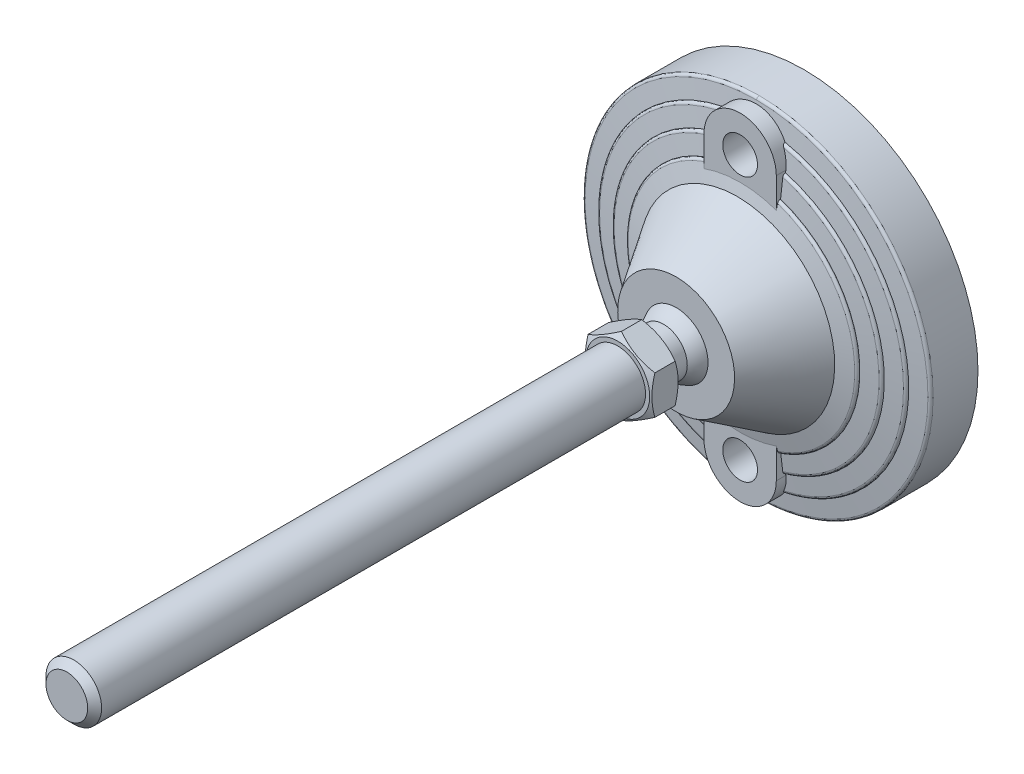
ISO-10303-21;
HEADER;
FILE_DESCRIPTION(('STEP AP214'),'2;1');
FILE_NAME('part.step','',(''),(''),'','','');
FILE_SCHEMA(('AUTOMOTIVE_DESIGN { 1 0 10303 214 1 1 1 1 }'));
ENDSEC;
DATA;
#1=APPLICATION_CONTEXT('core data for automotive mechanical design processes');
#2=APPLICATION_PROTOCOL_DEFINITION('international standard','automotive_design',2000,#1);
#3=PRODUCT_CONTEXT('',#1,'mechanical');
#4=PRODUCT('Part','Part','',(#3));
#5=PRODUCT_RELATED_PRODUCT_CATEGORY('part','',(#4));
#6=PRODUCT_DEFINITION_FORMATION('','',#4);
#7=PRODUCT_DEFINITION_CONTEXT('part definition',#1,'design');
#8=PRODUCT_DEFINITION('design','',#6,#7);
#9=PRODUCT_DEFINITION_SHAPE('','',#8);
#10=(LENGTH_UNIT() NAMED_UNIT(*) SI_UNIT(.MILLI.,.METRE.));
#11=(NAMED_UNIT(*) PLANE_ANGLE_UNIT() SI_UNIT($,.RADIAN.));
#12=(NAMED_UNIT(*) SI_UNIT($,.STERADIAN.) SOLID_ANGLE_UNIT());
#13=UNCERTAINTY_MEASURE_WITH_UNIT(LENGTH_MEASURE(1.E-05),#10,'distance_accuracy_value','');
#14=(GEOMETRIC_REPRESENTATION_CONTEXT(3) GLOBAL_UNCERTAINTY_ASSIGNED_CONTEXT((#13)) GLOBAL_UNIT_ASSIGNED_CONTEXT((#10,
#11,#12)) REPRESENTATION_CONTEXT('',''));
#15=CARTESIAN_POINT('',(0.,0.,0.));
#16=DIRECTION('',(0.,0.,1.));
#17=DIRECTION('',(1.,0.,0.));
#18=AXIS2_PLACEMENT_3D('',#15,#16,#17);
#19=CARTESIAN_POINT('',(-12.0000000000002,14.022683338,57.));
#20=DIRECTION('',(0.,0.,1.));
#21=DIRECTION('',(0.,-1.,0.));
#22=AXIS2_PLACEMENT_3D('',#19,#20,#21);
#23=PLANE('',#22);
#24=CARTESIAN_POINT('',(-1.58206781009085E-13,0.,57.));
#25=DIRECTION('',(0.,0.,-1.));
#26=DIRECTION('',(0.,1.,0.));
#27=AXIS2_PLACEMENT_3D('',#24,#25,#26);
#28=CIRCLE('',#27,11.5);
#29=CARTESIAN_POINT('',(-1.58206781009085E-13,11.5,57.));
#30=VERTEX_POINT('',#29);
#31=EDGE_CURVE('E212',#30,#30,#28,.T.);
#32=ORIENTED_EDGE('',*,*,#31,.T.);
#33=EDGE_LOOP('',(#32));
#34=FACE_BOUND('',#33,.T.);
#35=CARTESIAN_POINT('',(-1.58206781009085E-13,0.,57.));
#36=DIRECTION('',(0.,0.,-1.));
#37=DIRECTION('',(1.,0.,0.));
#38=AXIS2_PLACEMENT_3D('',#35,#36,#37);
#39=CIRCLE('',#38,8.5);
#40=CARTESIAN_POINT('',(8.49999999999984,0.,57.));
#41=VERTEX_POINT('',#40);
#42=EDGE_CURVE('E226',#41,#41,#39,.T.);
#43=ORIENTED_EDGE('',*,*,#42,.F.);
#44=EDGE_LOOP('',(#43));
#45=FACE_BOUND('',#44,.T.);
#46=ADVANCED_FACE('F14',(#34,#45),#23,.F.);
#47=CARTESIAN_POINT('',(-1.58206781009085E-13,0.,57.));
#48=DIRECTION('',(0.,0.,-1.));
#49=DIRECTION('',(1.,0.,0.));
#50=AXIS2_PLACEMENT_3D('',#47,#48,#49);
#51=CYLINDRICAL_SURFACE('',#50,8.5);
#52=CARTESIAN_POINT('',(-1.42818763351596E-13,0.,50.5));
#53=DIRECTION('',(0.,0.,-1.));
#54=DIRECTION('',(1.,0.,0.));
#55=AXIS2_PLACEMENT_3D('',#52,#53,#54);
#56=CIRCLE('',#55,8.5);
#57=CARTESIAN_POINT('',(8.49999999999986,0.,50.5));
#58=VERTEX_POINT('',#57);
#59=EDGE_CURVE('E1294',#58,#58,#56,.F.);
#60=ORIENTED_EDGE('',*,*,#59,.T.);
#61=EDGE_LOOP('',(#60));
#62=FACE_BOUND('',#61,.T.);
#63=ORIENTED_EDGE('',*,*,#42,.T.);
#64=EDGE_LOOP('',(#63));
#65=FACE_BOUND('',#64,.T.);
#66=ADVANCED_FACE('F1026',(#62,#65),#51,.T.);
#67=CARTESIAN_POINT('',(-8.63159921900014,8.622532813,50.5));
#68=DIRECTION('',(0.,0.,1.));
#69=DIRECTION('',(0.,-1.,0.));
#70=AXIS2_PLACEMENT_3D('',#67,#68,#69);
#71=PLANE('',#70);
#72=CARTESIAN_POINT('',(-1.40165656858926E-13,0.,50.5));
#73=DIRECTION('',(0.,0.,-1.));
#74=DIRECTION('',(0.,1.,0.));
#75=AXIS2_PLACEMENT_3D('',#72,#73,#74);
#76=CIRCLE('',#75,8.49107182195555);
#77=CARTESIAN_POINT('',(-1.40165656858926E-13,8.49107182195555,50.5));
#78=VERTEX_POINT('',#77);
#79=EDGE_CURVE('E1296',#78,#78,#76,.T.);
#80=ORIENTED_EDGE('',*,*,#79,.F.);
#81=EDGE_LOOP('',(#80));
#82=FACE_BOUND('',#81,.T.);
#83=ORIENTED_EDGE('',*,*,#59,.F.);
#84=EDGE_LOOP('',(#83));
#85=FACE_BOUND('',#84,.T.);
#86=ADVANCED_FACE('F1017',(#82,#85),#71,.F.);
#87=CARTESIAN_POINT('',(-1.15658222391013E-13,0.,41.670266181));
#88=DIRECTION('',(0.,0.,-1.));
#89=DIRECTION('',(1.,0.,0.));
#90=AXIS2_PLACEMENT_3D('',#87,#88,#89);
#91=SPHERICAL_SURFACE('',#90,12.25);
#92=CARTESIAN_POINT('',(-1.27675647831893E-13,0.,46.));
#93=DIRECTION('',(0.,0.,-1.));
#94=DIRECTION('',(0.,1.,0.));
#95=AXIS2_PLACEMENT_3D('',#92,#93,#94);
#96=CIRCLE('',#95,11.4593152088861);
#97=CARTESIAN_POINT('',(-1.27675647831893E-13,11.4593152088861,46.));
#98=VERTEX_POINT('',#97);
#99=EDGE_CURVE('E1299',#98,#98,#96,.F.);
#100=ORIENTED_EDGE('',*,*,#99,.T.);
#101=EDGE_LOOP('',(#100));
#102=FACE_BOUND('',#101,.T.);
#103=ORIENTED_EDGE('',*,*,#79,.T.);
#104=EDGE_LOOP('',(#103));
#105=FACE_BOUND('',#104,.T.);
#106=ADVANCED_FACE('F1009',(#102,#105),#91,.T.);
#107=CARTESIAN_POINT('',(-21.3251274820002,-21.252,46.));
#108=DIRECTION('',(0.,0.,-1.));
#109=DIRECTION('',(0.,1.,0.));
#110=AXIS2_PLACEMENT_3D('',#107,#108,#109);
#111=PLANE('',#110);
#112=ORIENTED_EDGE('',*,*,#99,.F.);
#113=EDGE_LOOP('',(#112));
#114=FACE_BOUND('',#113,.T.);
#115=CARTESIAN_POINT('',(-1.27675647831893E-13,0.,46.));
#116=DIRECTION('',(0.,0.,-1.));
#117=DIRECTION('',(0.,1.,0.));
#118=AXIS2_PLACEMENT_3D('',#115,#116,#117);
#119=CIRCLE('',#118,21.);
#120=CARTESIAN_POINT('',(-1.27675647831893E-13,21.,46.));
#121=VERTEX_POINT('',#120);
#122=EDGE_CURVE('E721',#121,#121,#119,.T.);
#123=ORIENTED_EDGE('',*,*,#122,.F.);
#124=EDGE_LOOP('',(#123));
#125=FACE_BOUND('',#124,.T.);
#126=ADVANCED_FACE('F1000',(#114,#125),#111,.F.);
#127=CARTESIAN_POINT('',(0.,-47.5,0.));
#128=DIRECTION('',(0.,0.,1.));
#129=DIRECTION('',(0.,-1.,0.));
#130=AXIS2_PLACEMENT_3D('',#127,#128,#129);
#131=CYLINDRICAL_SURFACE('',#130,6.25);
#132=CARTESIAN_POINT('',(0.,-47.5,0.));
#133=DIRECTION('',(0.,0.,1.));
#134=DIRECTION('',(0.,-1.,0.));
#135=AXIS2_PLACEMENT_3D('',#132,#133,#134);
#136=CIRCLE('',#135,6.25);
#137=CARTESIAN_POINT('',(0.,-53.75,0.));
#138=VERTEX_POINT('',#137);
#139=EDGE_CURVE('E451',#138,#138,#136,.F.);
#140=ORIENTED_EDGE('',*,*,#139,.T.);
#141=EDGE_LOOP('',(#140));
#142=FACE_BOUND('',#141,.T.);
#143=CARTESIAN_POINT('',(0.,-47.5,23.));
#144=DIRECTION('',(0.,0.,1.));
#145=DIRECTION('',(0.,-1.,0.));
#146=AXIS2_PLACEMENT_3D('',#143,#144,#145);
#147=CIRCLE('',#146,6.25);
#148=CARTESIAN_POINT('',(0.,-53.75,23.));
#149=VERTEX_POINT('',#148);
#150=EDGE_CURVE('E720',#149,#149,#147,.T.);
#151=ORIENTED_EDGE('',*,*,#150,.T.);
#152=EDGE_LOOP('',(#151));
#153=FACE_BOUND('',#152,.T.);
#154=ADVANCED_FACE('F992',(#142,#153),#131,.F.);
#155=CARTESIAN_POINT('',(-63.467641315,63.25,-1.76158091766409E-13));
#156=DIRECTION('',(0.,0.,1.));
#157=DIRECTION('',(0.,-1.,0.));
#158=AXIS2_PLACEMENT_3D('',#155,#156,#157);
#159=PLANE('',#158);
#160=ORIENTED_EDGE('',*,*,#139,.F.);
#161=EDGE_LOOP('',(#160));
#162=FACE_BOUND('',#161,.T.);
#163=CARTESIAN_POINT('',(0.,47.5,0.));
#164=DIRECTION('',(0.,0.,1.));
#165=DIRECTION('',(0.,-1.,0.));
#166=AXIS2_PLACEMENT_3D('',#163,#164,#165);
#167=CIRCLE('',#166,6.25);
#168=CARTESIAN_POINT('',(0.,41.25,0.));
#169=VERTEX_POINT('',#168);
#170=EDGE_CURVE('E239',#169,#169,#167,.T.);
#171=ORIENTED_EDGE('',*,*,#170,.T.);
#172=EDGE_LOOP('',(#171));
#173=FACE_BOUND('',#172,.T.);
#174=CARTESIAN_POINT('',(0.,0.,0.));
#175=DIRECTION('',(0.,0.,-1.));
#176=DIRECTION('',(0.,1.,0.));
#177=AXIS2_PLACEMENT_3D('',#174,#175,#176);
#178=CIRCLE('',#177,62.5);
#179=CARTESIAN_POINT('',(0.,62.5,0.));
#180=VERTEX_POINT('',#179);
#181=EDGE_CURVE('E414',#180,#180,#178,.F.);
#182=ORIENTED_EDGE('',*,*,#181,.F.);
#183=EDGE_LOOP('',(#182));
#184=FACE_BOUND('',#183,.T.);
#185=ADVANCED_FACE('F335',(#162,#173,#184),#159,.F.);
#186=CARTESIAN_POINT('',(12.4063544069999,39.602176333,21.568111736));
#187=CARTESIAN_POINT('',(59.7074645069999,24.78394183,21.5681117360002));
#188=CARTESIAN_POINT('',(59.7074645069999,-24.78394183,21.5681117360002));
#189=CARTESIAN_POINT('',(12.4063544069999,-39.602176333,21.568111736));
#190=CARTESIAN_POINT('',(12.4063544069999,39.602176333,22.0440464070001));
#191=CARTESIAN_POINT('',(59.7074645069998,24.78394183,22.0440464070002));
#192=CARTESIAN_POINT('',(59.7074645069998,-24.78394183,22.0440464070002));
#193=CARTESIAN_POINT('',(12.4063544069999,-39.602176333,22.0440464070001));
#194=CARTESIAN_POINT('',(12.3190334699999,39.323440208,22.4198056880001));
#195=CARTESIAN_POINT('',(59.287219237,24.609502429,22.4198056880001));
#196=CARTESIAN_POINT('',(59.287219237,-24.609502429,22.4198056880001));
#197=CARTESIAN_POINT('',(12.3190334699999,-39.323440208,22.4198056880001));
#198=CARTESIAN_POINT('',(12.1811504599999,38.883305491,22.5372089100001));
#199=CARTESIAN_POINT('',(58.6236363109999,24.334056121,22.5372089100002));
#200=CARTESIAN_POINT('',(58.6236363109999,-24.334056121,22.5372089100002));
#201=CARTESIAN_POINT('',(12.1811504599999,-38.883305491,22.5372089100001));
#202=(BOUNDED_SURFACE() B_SPLINE_SURFACE(3,3,((#186,#187,#188,#189),(#190,#191,#192,#193),(#194,
#195,#196,#197),(#198,#199,#200,#201)),.UNSPECIFIED.,.F.,.F.,
.F.) B_SPLINE_SURFACE_WITH_KNOTS((4,4),(4,4),(0.,1.),(0.,1.),
.UNSPECIFIED.) GEOMETRIC_REPRESENTATION_ITEM() RATIONAL_B_SPLINE_SURFACE(((1.,0.532632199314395,
0.532632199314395,1.),(0.85967907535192,0.457892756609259,0.457892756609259,0.85967907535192),
(0.85967907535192,0.457892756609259,0.457892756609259,0.85967907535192),(1.,0.532632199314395,
0.532632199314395,1.))) REPRESENTATION_ITEM('') SURFACE());
#203=CARTESIAN_POINT('',(0.,0.,22.53720891));
#204=DIRECTION('',(0.,0.,-1.));
#205=DIRECTION('',(0.,1.,0.));
#206=AXIS2_PLACEMENT_3D('',#203,#204,#205);
#207=CIRCLE('',#206,40.746679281);
#208=CARTESIAN_POINT('',(13.,-38.6172483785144,22.537208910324));
#209=VERTEX_POINT('',#208);
#210=CARTESIAN_POINT('',(13.,38.6172483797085,22.5372089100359));
#211=VERTEX_POINT('',#210);
#212=EDGE_CURVE('E452',#209,#211,#207,.F.);
#213=CARTESIAN_POINT('',(13.,-39.4112927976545,21.5681117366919));
#214=CARTESIAN_POINT('',(13.,-39.4112933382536,21.5952104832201));
#215=CARTESIAN_POINT('',(13.,-39.4101321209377,21.6222958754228));
#216=CARTESIAN_POINT('',(13.,-39.405504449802,21.6762650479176));
#217=CARTESIAN_POINT('',(13.,-39.4020383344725,21.7031488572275));
#218=CARTESIAN_POINT('',(13.,-39.3882336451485,21.7831079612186));
#219=CARTESIAN_POINT('',(13.,-39.3744885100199,21.8356344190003));
#220=CARTESIAN_POINT('',(13.,-39.3384084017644,21.937608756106));
#221=CARTESIAN_POINT('',(13.,-39.3160736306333,21.9870567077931));
#222=CARTESIAN_POINT('',(13.,-39.2635909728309,22.0816017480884));
#223=CARTESIAN_POINT('',(13.,-39.233444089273,22.1266993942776));
#224=CARTESIAN_POINT('',(13.,-39.1656058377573,22.2123360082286));
#225=CARTESIAN_POINT('',(13.,-39.1277714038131,22.2527614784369));
#226=CARTESIAN_POINT('',(13.,-39.0461074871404,22.327071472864));
#227=CARTESIAN_POINT('',(13.,-39.0022718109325,22.3609491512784));
#228=CARTESIAN_POINT('',(13.,-38.9043172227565,22.4250520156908));
#229=CARTESIAN_POINT('',(13.,-38.8495953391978,22.454364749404));
#230=CARTESIAN_POINT('',(13.,-38.7644641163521,22.4909906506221));
#231=CARTESIAN_POINT('',(13.,-38.7355751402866,22.5019763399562));
#232=CARTESIAN_POINT('',(13.,-38.6769796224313,22.5214626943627));
#233=CARTESIAN_POINT('',(13.,-38.6472733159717,22.5299640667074));
#234=CARTESIAN_POINT('',(13.,-38.6172483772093,22.537208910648));
#235=B_SPLINE_CURVE_WITH_KNOTS('',3,(#213,#214,#215,#216,#217,#218,#219,#220,#221,#222,#223,
#224,#225,#226,#227,#228,#229,#230,#231,#232,#233,#234),.UNSPECIFIED.,.F.,.F.,(4,2,2,2,2,2,2,2,
2,2,4),(0.,0.0812450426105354,0.162478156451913,0.324519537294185,0.486557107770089,
0.648573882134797,0.813939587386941,0.979477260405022,1.16468654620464,1.25731455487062,
1.34991616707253),.UNSPECIFIED.);
#236=CARTESIAN_POINT('',(13.,-39.4112927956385,21.568111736));
#237=VERTEX_POINT('',#236);
#238=EDGE_CURVE('E321',#237,#209,#235,.T.);
#239=CARTESIAN_POINT('',(0.,0.,21.568111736));
#240=DIRECTION('',(0.,0.,-1.));
#241=DIRECTION('',(0.,1.,0.));
#242=AXIS2_PLACEMENT_3D('',#239,#240,#241);
#243=CIRCLE('',#242,41.5);
#244=CARTESIAN_POINT('',(13.,39.4112927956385,21.5681117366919));
#245=VERTEX_POINT('',#244);
#246=EDGE_CURVE('E449',#245,#237,#243,.T.);
#247=CARTESIAN_POINT('',(13.,38.6172483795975,22.5372089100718));
#248=CARTESIAN_POINT('',(13.,38.6757273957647,22.5231434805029));
#249=CARTESIAN_POINT('',(13.,38.7330575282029,22.5042077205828));
#250=CARTESIAN_POINT('',(13.,38.843898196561,22.4570874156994));
#251=CARTESIAN_POINT('',(13.,38.8974017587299,22.4288864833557));
#252=CARTESIAN_POINT('',(13.,38.9989209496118,22.3637346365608));
#253=CARTESIAN_POINT('',(13.,39.0469285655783,22.3267711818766));
#254=CARTESIAN_POINT('',(13.,39.1357078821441,22.2450475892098));
#255=CARTESIAN_POINT('',(13.,39.1764870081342,22.2002955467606));
#256=CARTESIAN_POINT('',(13.,39.2479885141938,22.1059931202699));
#257=CARTESIAN_POINT('',(13.,39.2790300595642,22.0566848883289));
#258=CARTESIAN_POINT('',(13.,39.3318958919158,21.9533393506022));
#259=CARTESIAN_POINT('',(13.,39.3537228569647,21.8993034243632));
#260=CARTESIAN_POINT('',(13.,39.3839717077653,21.7991363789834));
#261=CARTESIAN_POINT('',(13.,39.3941848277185,21.7535382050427));
#262=CARTESIAN_POINT('',(13.,39.4078594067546,21.6613400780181));
#263=CARTESIAN_POINT('',(13.,39.4113205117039,21.6147400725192));
#264=CARTESIAN_POINT('',(13.,39.4112927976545,21.5681117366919));
#265=B_SPLINE_CURVE_WITH_KNOTS('',3,(#247,#248,#249,#250,#251,#252,#253,#254,#255,#256,#257,
#258,#259,#260,#261,#262,#263,#264),.UNSPECIFIED.,.F.,.F.,(4,2,2,2,2,2,2,2,4),(0.,
0.180276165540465,0.360872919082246,0.541729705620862,0.722399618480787,0.896310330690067,
1.07017046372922,1.20986980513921,1.34957647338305),.UNSPECIFIED.);
#266=EDGE_CURVE('E238',#211,#245,#265,.T.);
#267=ORIENTED_EDGE('',*,*,#212,.F.);
#268=ORIENTED_EDGE('',*,*,#238,.F.);
#269=ORIENTED_EDGE('',*,*,#246,.F.);
#270=ORIENTED_EDGE('',*,*,#266,.F.);
#271=EDGE_LOOP('',(#267,#268,#269,#270));
#272=FACE_BOUND('',#271,.T.);
#273=ADVANCED_FACE('F919',(#272),#202,.T.);
#274=CARTESIAN_POINT('',(0.,0.,21.568111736));
#275=DIRECTION('',(0.,0.,-1.));
#276=DIRECTION('',(0.,1.,0.));
#277=AXIS2_PLACEMENT_3D('',#274,#275,#276);
#278=CYLINDRICAL_SURFACE('',#277,41.5);
#279=CARTESIAN_POINT('',(0.,0.,21.4545454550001));
#280=DIRECTION('',(0.,0.,-1.));
#281=DIRECTION('',(0.,1.,0.));
#282=AXIS2_PLACEMENT_3D('',#279,#280,#281);
#283=CIRCLE('',#282,41.5);
#284=CARTESIAN_POINT('',(13.,39.4112927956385,21.4545454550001));
#285=VERTEX_POINT('',#284);
#286=CARTESIAN_POINT('',(13.,-39.4112927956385,21.4545454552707));
#287=VERTEX_POINT('',#286);
#288=EDGE_CURVE('E447',#285,#287,#283,.T.);
#289=ORIENTED_EDGE('',*,*,#288,.F.);
#290=DIRECTION('',(0.,0.,-1.));
#291=VECTOR('',#290,1.);
#292=CARTESIAN_POINT('',(13.,39.4112927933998,21.2785712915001));
#293=LINE('',#292,#291);
#294=EDGE_CURVE('E291',#245,#285,#293,.T.);
#295=ORIENTED_EDGE('',*,*,#294,.F.);
#296=ORIENTED_EDGE('',*,*,#246,.T.);
#297=DIRECTION('',(0.,0.,1.));
#298=VECTOR('',#297,1.);
#299=CARTESIAN_POINT('',(13.,-39.4112927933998,21.2785712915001));
#300=LINE('',#299,#298);
#301=EDGE_CURVE('E319',#287,#237,#300,.T.);
#302=ORIENTED_EDGE('',*,*,#301,.F.);
#303=EDGE_LOOP('',(#289,#295,#296,#302));
#304=FACE_BOUND('',#303,.T.);
#305=ADVANCED_FACE('F303',(#304),#278,.T.);
#306=CARTESIAN_POINT('',(0.,0.,21.454545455));
#307=DIRECTION('',(0.,0.,-1.));
#308=DIRECTION('',(0.,1.,0.));
#309=AXIS2_PLACEMENT_3D('',#306,#307,#308);
#310=CONICAL_SURFACE('',#309,41.5,1.4442041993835);
#311=ORIENTED_EDGE('',*,*,#288,.T.);
#312=CARTESIAN_POINT('',(13.0000000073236,-45.8176832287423,20.674840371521));
#313=CARTESIAN_POINT('',(13.0000000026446,-45.2838642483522,20.7402005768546));
#314=CARTESIAN_POINT('',(13.000000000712,-44.7500350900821,20.8054777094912));
#315=CARTESIAN_POINT('',(12.999999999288,-43.6823542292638,20.935846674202));
#316=CARTESIAN_POINT('',(12.9999999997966,-43.1485025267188,21.0009385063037));
#317=CARTESIAN_POINT('',(13.0000000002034,-42.0807742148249,21.1309177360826));
#318=CARTESIAN_POINT('',(13.0000000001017,-41.5468976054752,21.195805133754));
#319=CARTESIAN_POINT('',(12.9999999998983,-40.4791166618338,21.3253520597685));
#320=CARTESIAN_POINT('',(12.9999999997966,-39.9452123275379,21.3900115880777));
#321=CARTESIAN_POINT('',(13.,-39.4112927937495,21.4545454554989));
#322=B_SPLINE_CURVE_WITH_KNOTS('',3,(#312,#313,#314,#315,#316,#317,#318,#319,#320,#321),
.UNSPECIFIED.,.F.,.F.,(4,2,2,2,4),(0.,1.61341623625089,3.22683223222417,4.84024827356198,
6.4536645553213),.UNSPECIFIED.);
#323=CARTESIAN_POINT('',(13.,-45.8176832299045,20.674840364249));
#324=VERTEX_POINT('',#323);
#325=EDGE_CURVE('E311',#324,#287,#322,.T.);
#326=ORIENTED_EDGE('',*,*,#325,.F.);
#327=CARTESIAN_POINT('',(-7.486157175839E-10,0.,20.674840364));
#328=DIRECTION('',(0.,0.,-1.));
#329=DIRECTION('',(0.,1.,0.));
#330=AXIS2_PLACEMENT_3D('',#327,#328,#329);
#331=CIRCLE('',#330,47.6262542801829);
#332=CARTESIAN_POINT('',(13.,45.8176832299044,20.6748403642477));
#333=VERTEX_POINT('',#332);
#334=EDGE_CURVE('E412',#333,#324,#331,.T.);
#335=ORIENTED_EDGE('',*,*,#334,.F.);
#336=CARTESIAN_POINT('',(13.,39.4112927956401,21.4545454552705));
#337=CARTESIAN_POINT('',(13.,39.9452123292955,21.3900115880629));
#338=CARTESIAN_POINT('',(13.,40.4791166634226,21.3253520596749));
#339=CARTESIAN_POINT('',(13.,41.5468976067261,21.195805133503));
#340=CARTESIAN_POINT('',(13.,42.0807742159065,21.1309177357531));
#341=CARTESIAN_POINT('',(13.,43.1485025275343,21.0009385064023));
#342=CARTESIAN_POINT('',(13.,43.6823542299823,20.9358466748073));
#343=CARTESIAN_POINT('',(13.,44.7500350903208,20.805477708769));
#344=CARTESIAN_POINT('',(13.,45.283864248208,20.7402005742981));
#345=CARTESIAN_POINT('',(13.,45.8176832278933,20.6748403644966));
#346=B_SPLINE_CURVE_WITH_KNOTS('',3,(#336,#337,#338,#339,#340,#341,#342,#343,#344,#345),
.UNSPECIFIED.,.F.,.F.,(4,2,2,2,4),(0.,1.61341628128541,3.22683232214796,4.84024831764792,
6.45366455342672),.UNSPECIFIED.);
#347=EDGE_CURVE('E283',#285,#333,#346,.T.);
#348=ORIENTED_EDGE('',*,*,#347,.F.);
#349=EDGE_LOOP('',(#311,#326,#335,#348));
#350=FACE_BOUND('',#349,.T.);
#351=ADVANCED_FACE('F298',(#350),#310,.T.);
#352=CARTESIAN_POINT('',(12.2698506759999,46.922284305,19.669623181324));
#353=CARTESIAN_POINT('',(72.5576318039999,31.157449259,19.6696231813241));
#354=CARTESIAN_POINT('',(72.5576318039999,-31.157449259,19.6696231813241));
#355=CARTESIAN_POINT('',(12.2698506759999,-46.922284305,19.669623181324));
#356=CARTESIAN_POINT('',(12.2698506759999,46.922284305,19.674029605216));
#357=CARTESIAN_POINT('',(72.5576318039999,31.157449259,19.6740296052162));
#358=CARTESIAN_POINT('',(72.5576318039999,-31.157449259,19.6740296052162));
#359=CARTESIAN_POINT('',(12.2698506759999,-46.922284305,19.674029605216));
#360=CARTESIAN_POINT('',(12.2698506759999,46.922284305,19.678436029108));
#361=CARTESIAN_POINT('',(72.5576318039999,31.157449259,19.6784360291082));
#362=CARTESIAN_POINT('',(72.5576318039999,-31.157449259,19.6784360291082));
#363=CARTESIAN_POINT('',(12.2698506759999,-46.922284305,19.678436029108));
#364=CARTESIAN_POINT('',(12.2698506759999,46.922284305,19.6828424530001));
#365=CARTESIAN_POINT('',(72.5576318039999,31.157449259,19.6828424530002));
#366=CARTESIAN_POINT('',(72.5576318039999,-31.157449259,19.6828424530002));
#367=CARTESIAN_POINT('',(12.2698506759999,-46.922284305,19.6828424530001));
#368=CARTESIAN_POINT('',(12.2698506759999,46.922284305,20.2114365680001));
#369=CARTESIAN_POINT('',(72.5576318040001,31.157449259,20.2114365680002));
#370=CARTESIAN_POINT('',(72.5576318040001,-31.157449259,20.2114365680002));
#371=CARTESIAN_POINT('',(12.2698506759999,-46.922284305,20.2114365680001));
#372=CARTESIAN_POINT('',(12.1814618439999,46.584268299,20.6081030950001));
#373=CARTESIAN_POINT('',(72.0349453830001,30.93299905,20.6081030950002));
#374=CARTESIAN_POINT('',(72.0349453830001,-30.93299905,20.6081030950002));
#375=CARTESIAN_POINT('',(12.1814618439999,-46.584268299,20.6081030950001));
#376=CARTESIAN_POINT('',(12.0488047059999,46.076961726,20.674840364));
#377=CARTESIAN_POINT('',(71.2504788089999,30.596136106,20.6748403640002));
#378=CARTESIAN_POINT('',(71.2504788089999,-30.596136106,20.6748403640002));
#379=CARTESIAN_POINT('',(12.0488047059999,-46.076961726,20.674840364));
#380=(BOUNDED_SURFACE() B_SPLINE_SURFACE(3,3,((#352,#353,#354,#355),(#356,#357,#358,#359),(#360,
#361,#362,#363),(#364,#365,#366,#367),(#368,#369,#370,#371),(#372,#373,#374,#375),(#376,#377,
#378,#379)),.UNSPECIFIED.,.F.,.F.,.F.) B_SPLINE_SURFACE_WITH_KNOTS((4,3,4),(4,4),(-0.01,0.,1.),
(0.,1.),.UNSPECIFIED.) GEOMETRIC_REPRESENTATION_ITEM() RATIONAL_B_SPLINE_SURFACE(((1.,
0.501991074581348,0.501991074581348,1.),(1.,0.501991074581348,0.501991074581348,1.),(1.,
0.501991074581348,0.501991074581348,1.),(1.,0.501991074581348,0.501991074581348,1.),
(0.833611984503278,0.41846577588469,0.41846577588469,0.833611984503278),(0.833611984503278,
0.41846577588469,0.41846577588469,0.833611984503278),(1.,0.501991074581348,0.501991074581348,1.))) REPRESENTATION_ITEM('') SURFACE());
#381=CARTESIAN_POINT('',(13.,-46.7252608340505,19.6777848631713));
#382=CARTESIAN_POINT('',(13.,-46.7253979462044,19.7054287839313));
#383=CARTESIAN_POINT('',(13.,-46.7243484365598,19.7330653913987));
#384=CARTESIAN_POINT('',(13.,-46.7198870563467,19.7881439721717));
#385=CARTESIAN_POINT('',(13.,-46.7164754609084,19.8155859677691));
#386=CARTESIAN_POINT('',(13.,-46.7027375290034,19.8972169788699));
#387=CARTESIAN_POINT('',(13.,-46.688908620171,19.9508576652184));
#388=CARTESIAN_POINT('',(13.,-46.6523707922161,20.0550506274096));
#389=CARTESIAN_POINT('',(13.,-46.629652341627,20.1055995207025));
#390=CARTESIAN_POINT('',(13.,-46.5760978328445,20.2021956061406));
#391=CARTESIAN_POINT('',(13.,-46.545261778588,20.2482428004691));
#392=CARTESIAN_POINT('',(13.,-46.4762858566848,20.3348542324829));
#393=CARTESIAN_POINT('',(13.,-46.438110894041,20.3753904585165));
#394=CARTESIAN_POINT('',(13.,-46.3556866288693,20.4497572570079));
#395=CARTESIAN_POINT('',(13.,-46.3114344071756,20.4835845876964));
#396=CARTESIAN_POINT('',(13.,-46.2164675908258,20.5448274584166));
#397=CARTESIAN_POINT('',(13.,-46.1655796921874,20.5719736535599));
#398=CARTESIAN_POINT('',(13.,-46.0601083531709,20.6176355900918));
#399=CARTESIAN_POINT('',(13.,-46.0055288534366,20.6361603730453));
#400=CARTESIAN_POINT('',(13.,-45.9281089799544,20.6556819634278));
#401=CARTESIAN_POINT('',(13.,-45.9061721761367,20.660484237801));
#402=CARTESIAN_POINT('',(13.,-45.8620822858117,20.668699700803));
#403=CARTESIAN_POINT('',(13.,-45.8399296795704,20.6721154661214));
#404=CARTESIAN_POINT('',(13.,-45.817683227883,20.6748403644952));
#405=B_SPLINE_CURVE_WITH_KNOTS('',3,(#381,#382,#383,#384,#385,#386,#387,#388,#389,#390,#391,
#392,#393,#394,#395,#396,#397,#398,#399,#400,#401,#402,#403,#404),.UNSPECIFIED.,.F.,.F.,(4,2,2,
2,2,2,2,2,2,2,2,4),(0.,0.0828810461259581,0.165752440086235,0.331061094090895,0.496547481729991,
0.662033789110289,0.828332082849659,0.994710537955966,1.16697834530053,1.3390650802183,
1.40639957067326,1.47360834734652),.UNSPECIFIED.);
#406=CARTESIAN_POINT('',(13.0000000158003,-46.7252608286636,19.6777848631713));
#407=VERTEX_POINT('',#406);
#408=EDGE_CURVE('E320',#407,#324,#405,.T.);
#409=CARTESIAN_POINT('',(13.0000000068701,46.7252608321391,19.6727272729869));
#410=CARTESIAN_POINT('',(13.3212147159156,46.635891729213,19.6727272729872));
#411=CARTESIAN_POINT('',(13.6414983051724,46.5432129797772,19.6727272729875));
#412=CARTESIAN_POINT('',(14.2801231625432,46.3512597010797,19.6727272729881));
#413=CARTESIAN_POINT('',(14.59846420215,46.2519844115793,19.6727272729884));
#414=CARTESIAN_POINT('',(15.5526106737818,45.9435979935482,19.6727272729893));
#415=CARTESIAN_POINT('',(16.1852411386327,45.7245656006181,19.6727272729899));
#416=CARTESIAN_POINT('',(17.4409289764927,45.2604918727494,19.6727272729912));
#417=CARTESIAN_POINT('',(18.063985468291,45.0154481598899,19.6727272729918));
#418=CARTESIAN_POINT('',(19.3000708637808,44.4995075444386,19.672727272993));
#419=CARTESIAN_POINT('',(19.913088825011,44.2285843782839,19.6727272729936));
#420=CARTESIAN_POINT('',(21.1274202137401,43.6615551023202,19.6727272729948));
#421=CARTESIAN_POINT('',(21.7287319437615,43.3654453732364,19.6727272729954));
#422=CARTESIAN_POINT('',(23.5288179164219,42.4321391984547,19.6727272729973));
#423=CARTESIAN_POINT('',(24.7079785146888,41.7565378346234,19.6727272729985));
#424=CARTESIAN_POINT('',(27.0057517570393,40.3086198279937,19.6727272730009));
#425=CARTESIAN_POINT('',(28.1243409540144,39.5362661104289,19.672727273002));
#426=CARTESIAN_POINT('',(30.2940548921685,37.8994558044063,19.6727272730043));
#427=CARTESIAN_POINT('',(31.3451007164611,37.034894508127,19.6727272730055));
#428=CARTESIAN_POINT('',(33.3707378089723,35.2206260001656,19.6727272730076));
#429=CARTESIAN_POINT('',(34.3453363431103,34.2709268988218,19.6727272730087));
#430=CARTESIAN_POINT('',(36.2141318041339,32.2900336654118,19.6727272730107));
#431=CARTESIAN_POINT('',(37.1080775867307,31.2586025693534,19.6727272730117));
#432=CARTESIAN_POINT('',(38.8059105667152,29.1240638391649,19.6727272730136));
#433=CARTESIAN_POINT('',(39.6097954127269,28.0209543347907,19.6727272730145));
#434=CARTESIAN_POINT('',(41.1215543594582,25.7512426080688,19.6727272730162));
#435=CARTESIAN_POINT('',(41.8294551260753,24.5846581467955,19.672727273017));
#436=CARTESIAN_POINT('',(43.1444737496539,22.1960153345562,19.6727272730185));
#437=CARTESIAN_POINT('',(43.7515922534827,20.9739573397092,19.6727272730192));
#438=CARTESIAN_POINT('',(44.8608053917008,18.4828923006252,19.6727272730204));
#439=CARTESIAN_POINT('',(45.3628870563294,17.2138794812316,19.672727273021));
#440=CARTESIAN_POINT('',(46.2583633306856,14.6380667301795,19.6727272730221));
#441=CARTESIAN_POINT('',(46.6517577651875,13.3312667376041,19.6727272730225));
#442=CARTESIAN_POINT('',(47.3270705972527,10.6891374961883,19.6727272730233));
#443=CARTESIAN_POINT('',(47.6089860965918,9.35380750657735,19.6727272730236));
#444=CARTESIAN_POINT('',(48.0593220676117,6.66414532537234,19.6727272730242));
#445=CARTESIAN_POINT('',(48.2277425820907,5.30981314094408,19.6727272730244));
#446=CARTESIAN_POINT('',(48.449886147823,2.59183878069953,19.6727272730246));
#447=CARTESIAN_POINT('',(48.5036145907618,1.22819704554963,19.6727272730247));
#448=CARTESIAN_POINT('',(48.4960080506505,-1.49876561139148,19.6727272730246));
#449=CARTESIAN_POINT('',(48.4346730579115,-2.86208653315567,19.6727272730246));
#450=CARTESIAN_POINT('',(48.1973677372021,-5.57880747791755,19.6727272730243));
#451=CARTESIAN_POINT('',(48.021389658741,-6.93220682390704,19.6727272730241));
#452=CARTESIAN_POINT('',(47.5560413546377,-9.61936956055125,19.6727272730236));
#453=CARTESIAN_POINT('',(47.2666711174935,-10.9531329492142,19.6727272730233));
#454=CARTESIAN_POINT('',(46.5765756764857,-13.5916227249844,19.6727272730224));
#455=CARTESIAN_POINT('',(46.1758433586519,-14.8963472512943,19.672727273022));
#456=CARTESIAN_POINT('',(45.2658742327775,-17.4674022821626,19.6727272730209));
#457=CARTESIAN_POINT('',(44.7566374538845,-18.7337327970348,19.6727272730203));
#458=CARTESIAN_POINT('',(43.6334165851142,-21.2187182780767,19.672727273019));
#459=CARTESIAN_POINT('',(43.0194530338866,-22.4373825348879,19.6727272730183));
#460=CARTESIAN_POINT('',(41.6909757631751,-24.8187625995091,19.6727272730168));
#461=CARTESIAN_POINT('',(40.9764619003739,-25.9814783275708,19.672727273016));
#462=CARTESIAN_POINT('',(39.7063025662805,-27.8655028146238,19.6727272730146));
#463=CARTESIAN_POINT('',(39.1770724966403,-28.6047764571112,19.672727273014));
#464=CARTESIAN_POINT('',(38.0778809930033,-30.0524665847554,19.6727272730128));
#465=CARTESIAN_POINT('',(37.5079195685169,-30.760883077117,19.6727272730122));
#466=CARTESIAN_POINT('',(36.3291070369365,-32.1445499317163,19.6727272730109));
#467=CARTESIAN_POINT('',(35.7202564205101,-32.8198007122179,19.6727272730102));
#468=CARTESIAN_POINT('',(34.4653645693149,-34.1352484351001,19.6727272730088));
#469=CARTESIAN_POINT('',(33.819310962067,-34.775433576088,19.6727272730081));
#470=CARTESIAN_POINT('',(32.4922294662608,-36.018489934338,19.6727272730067));
#471=CARTESIAN_POINT('',(31.8112009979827,-36.6213605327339,19.672727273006));
#472=CARTESIAN_POINT('',(30.4163089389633,-37.787892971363,19.6727272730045));
#473=CARTESIAN_POINT('',(29.7024437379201,-38.3515528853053,19.6727272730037));
#474=CARTESIAN_POINT('',(28.1769516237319,-39.4879139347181,19.6727272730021));
#475=CARTESIAN_POINT('',(27.3623770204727,-40.0566641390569,19.6727272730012));
#476=CARTESIAN_POINT('',(25.6997855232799,-41.1431320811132,19.6727272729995));
#477=CARTESIAN_POINT('',(24.8517655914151,-41.6608451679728,19.6727272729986));
#478=CARTESIAN_POINT('',(23.125490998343,-42.6432641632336,19.6727272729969));
#479=CARTESIAN_POINT('',(22.2472346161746,-43.1079670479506,19.672727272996));
#480=CARTESIAN_POINT('',(20.4623876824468,-43.9832963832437,19.6727272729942));
#481=CARTESIAN_POINT('',(19.5557530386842,-44.3938329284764,19.6727272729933));
#482=CARTESIAN_POINT('',(17.7189637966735,-45.1583612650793,19.6727272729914));
#483=CARTESIAN_POINT('',(16.7888095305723,-45.5123538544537,19.6727272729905));
#484=CARTESIAN_POINT('',(14.9085132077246,-46.1625049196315,19.6727272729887));
#485=CARTESIAN_POINT('',(13.9583713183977,-46.4586638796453,19.6727272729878));
#486=CARTESIAN_POINT('',(13.0000000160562,-46.7252608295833,19.6727272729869));
#487=B_SPLINE_CURVE_WITH_KNOTS('',3,(#409,#410,#411,#412,#413,#414,#415,#416,#417,#418,#419,
#420,#421,#422,#423,#424,#425,#426,#427,#428,#429,#430,#431,#432,#433,#434,#435,#436,#437,#438,
#439,#440,#441,#442,#443,#444,#445,#446,#447,#448,#449,#450,#451,#452,#453,#454,#455,#456,#457,
#458,#459,#460,#461,#462,#463,#464,#465,#466,#467,#468,#469,#470,#471,#472,#473,#474,#475,#476,
#477,#478,#479,#480,#481,#482,#483,#484,#485,#486),.UNSPECIFIED.,.F.,.F.,(4,2,2,2,2,2,2,2,2,2,2,
2,2,2,2,2,2,2,2,2,2,2,2,2,2,2,2,2,2,2,2,2,2,2,2,2,2,2,4),(0.,1.00020816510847,2.00053180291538,
4.00833027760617,6.01631246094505,8.02635452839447,10.0366859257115,14.1084282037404,
18.1817355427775,22.2597186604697,26.3373137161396,30.4271967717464,34.5171865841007,
38.6060377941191,42.6948627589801,46.7841923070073,50.8735284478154,54.9629708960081,
59.0524118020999,63.1416604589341,67.2309094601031,71.3204349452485,75.4099608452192,
79.4997480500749,83.5895341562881,87.6785191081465,91.7675098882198,94.493747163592,
97.2199838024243,99.9461860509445,102.673300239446,105.400459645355,108.12775293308,
111.106299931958,114.085118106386,117.064106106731,120.047978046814,123.031807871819,
126.015612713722),.UNSPECIFIED.);
#488=CARTESIAN_POINT('',(13.0000000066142,46.7252608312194,19.6777848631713));
#489=VERTEX_POINT('',#488);
#490=EDGE_CURVE('E396',#489,#407,#487,.T.);
#491=CARTESIAN_POINT('',(13.,45.817683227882,20.6748403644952));
#492=CARTESIAN_POINT('',(13.,45.8768916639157,20.6676266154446));
#493=CARTESIAN_POINT('',(13.,45.9354849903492,20.6554311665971));
#494=CARTESIAN_POINT('',(13.,46.0498761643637,20.621476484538));
#495=CARTESIAN_POINT('',(13.,46.1056719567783,20.5997103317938));
#496=CARTESIAN_POINT('',(13.,46.2128716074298,20.5469963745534));
#497=CARTESIAN_POINT('',(13.,46.2642705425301,20.5160384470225));
#498=CARTESIAN_POINT('',(13.,46.336724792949,20.4633763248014));
#499=CARTESIAN_POINT('',(13.,46.3600988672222,20.4447881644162));
#500=CARTESIAN_POINT('',(13.,46.405165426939,20.4056252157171));
#501=CARTESIAN_POINT('',(13.,46.4268560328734,20.3850482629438));
#502=CARTESIAN_POINT('',(13.,46.4880645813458,20.3216088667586));
#503=CARTESIAN_POINT('',(13.,46.5249454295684,20.2761439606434));
#504=CARTESIAN_POINT('',(13.,46.5901806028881,20.1794685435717));
#505=CARTESIAN_POINT('',(13.,46.6185381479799,20.1282602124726));
#506=CARTESIAN_POINT('',(13.,46.653488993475,20.0492930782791));
#507=CARTESIAN_POINT('',(13.,46.6637514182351,20.0231112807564));
#508=CARTESIAN_POINT('',(13.,46.6819716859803,19.9699855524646));
#509=CARTESIAN_POINT('',(13.,46.6899313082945,19.9430422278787));
#510=CARTESIAN_POINT('',(13.,46.7102220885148,19.8614024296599));
#511=CARTESIAN_POINT('',(13.,46.7190275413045,19.805755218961));
#512=CARTESIAN_POINT('',(13.,46.7237631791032,19.7378782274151));
#513=CARTESIAN_POINT('',(13.,46.7243742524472,19.7258595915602));
#514=CARTESIAN_POINT('',(13.,46.7251497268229,19.7018236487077));
#515=CARTESIAN_POINT('',(13.,46.7253147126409,19.6898063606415));
#516=CARTESIAN_POINT('',(13.,46.7252608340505,19.6777848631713));
#517=B_SPLINE_CURVE_WITH_KNOTS('',3,(#491,#492,#493,#494,#495,#496,#497,#498,#499,#500,#501,
#502,#503,#504,#505,#506,#507,#508,#509,#510,#511,#512,#513,#514,#515,#516),.UNSPECIFIED.,.F.,
.F.,(4,2,2,2,2,2,2,2,2,2,2,2,4),(0.,0.178718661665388,0.357566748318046,0.536612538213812,
0.62610723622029,0.715700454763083,0.890396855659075,1.0650271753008,1.14929679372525,
1.23350112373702,1.40145319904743,1.43755286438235,1.4736051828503),.UNSPECIFIED.);
#518=EDGE_CURVE('E290',#333,#489,#517,.T.);
#519=ORIENTED_EDGE('',*,*,#334,.T.);
#520=ORIENTED_EDGE('',*,*,#408,.F.);
#521=ORIENTED_EDGE('',*,*,#490,.F.);
#522=ORIENTED_EDGE('',*,*,#518,.F.);
#523=EDGE_LOOP('',(#519,#520,#521,#522));
#524=FACE_BOUND('',#523,.T.);
#525=ADVANCED_FACE('F302',(#524),#380,.T.);
#526=CARTESIAN_POINT('',(0.,62.5,16.119206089));
#527=CARTESIAN_POINT('',(125.,62.5,16.1192060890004));
#528=CARTESIAN_POINT('',(125.,-62.5,16.1192060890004));
#529=CARTESIAN_POINT('',(0.,-62.5,16.119206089));
#530=CARTESIAN_POINT('',(0.,62.5,16.647800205));
#531=CARTESIAN_POINT('',(125.,62.5,16.6478002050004));
#532=CARTESIAN_POINT('',(125.,-62.5,16.6478002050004));
#533=CARTESIAN_POINT('',(0.,-62.5,16.647800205));
#534=CARTESIAN_POINT('',(0.,62.150618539,17.044466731));
#535=CARTESIAN_POINT('',(124.301237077,62.1506185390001,17.0444667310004));
#536=CARTESIAN_POINT('',(124.301237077,-62.1506185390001,17.0444667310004));
#537=CARTESIAN_POINT('',(0.,-62.150618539,17.044466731));
#538=CARTESIAN_POINT('',(0.,61.62625428,17.111204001));
#539=CARTESIAN_POINT('',(123.252508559,61.6262542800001,17.1112040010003));
#540=CARTESIAN_POINT('',(123.252508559,-61.6262542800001,17.1112040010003));
#541=CARTESIAN_POINT('',(0.,-61.62625428,17.111204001));
#542=(BOUNDED_SURFACE() B_SPLINE_SURFACE(3,3,((#526,#527,#528,#529),(#530,#531,#532,#533),(#534,
#535,#536,#537),(#538,#539,#540,#541)),.UNSPECIFIED.,.F.,.F.,
.F.) B_SPLINE_SURFACE_WITH_KNOTS((4,4),(4,4),(0.,1.),(0.,1.),
.UNSPECIFIED.) GEOMETRIC_REPRESENTATION_ITEM() RATIONAL_B_SPLINE_SURFACE(((1.,0.333333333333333,
0.333333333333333,1.),(0.833611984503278,0.277870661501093,0.277870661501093,0.833611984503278),
(0.833611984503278,0.277870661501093,0.277870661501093,0.833611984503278),(1.,0.333333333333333,
0.333333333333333,1.))) REPRESENTATION_ITEM('') SURFACE());
#543=CARTESIAN_POINT('',(0.,0.,16.119206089));
#544=DIRECTION('',(0.,0.,1.));
#545=DIRECTION('',(0.,-1.,0.));
#546=AXIS2_PLACEMENT_3D('',#543,#544,#545);
#547=CIRCLE('',#546,62.5);
#548=CARTESIAN_POINT('',(-9.61426795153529E-09,-62.5,16.119206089));
#549=VERTEX_POINT('',#548);
#550=CARTESIAN_POINT('',(-2.80609562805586E-09,62.5,16.119206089));
#551=VERTEX_POINT('',#550);
#552=EDGE_CURVE('E712',#549,#551,#547,.T.);
#553=CARTESIAN_POINT('',(0.,62.5,16.119206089));
#554=CARTESIAN_POINT('',(0.,62.5,16.647800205));
#555=CARTESIAN_POINT('',(0.,62.150618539,17.044466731));
#556=CARTESIAN_POINT('',(0.,61.62625428,17.111204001));
#557=(BOUNDED_CURVE() B_SPLINE_CURVE(3,(#553,#554,#555,#556),.UNSPECIFIED.,.F.,
.F.) B_SPLINE_CURVE_WITH_KNOTS((4,4),(0.,1.),
.UNSPECIFIED.) CURVE() GEOMETRIC_REPRESENTATION_ITEM() RATIONAL_B_SPLINE_CURVE((1.,
0.833611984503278,0.833611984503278,1.)) REPRESENTATION_ITEM(''));
#558=CARTESIAN_POINT('',(-8.3005149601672E-09,61.6262542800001,17.111204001));
#559=VERTEX_POINT('',#558);
#560=EDGE_CURVE('E433',#559,#551,#557,.F.);
#561=CARTESIAN_POINT('',(0.,0.,17.111204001));
#562=DIRECTION('',(0.,0.,-1.));
#563=DIRECTION('',(0.,1.,0.));
#564=AXIS2_PLACEMENT_3D('',#561,#562,#563);
#565=CIRCLE('',#564,61.62625428);
#566=CARTESIAN_POINT('',(-1.57997425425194E-08,-61.62625428,17.111204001));
#567=VERTEX_POINT('',#566);
#568=EDGE_CURVE('E724',#567,#559,#565,.F.);
#569=CARTESIAN_POINT('',(0.,-62.5,16.119206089));
#570=CARTESIAN_POINT('',(0.,-62.5,16.647800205));
#571=CARTESIAN_POINT('',(0.,-62.150618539,17.044466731));
#572=CARTESIAN_POINT('',(0.,-61.62625428,17.111204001));
#573=(BOUNDED_CURVE() B_SPLINE_CURVE(3,(#569,#570,#571,#572),.UNSPECIFIED.,.F.,
.F.) B_SPLINE_CURVE_WITH_KNOTS((4,4),(0.,1.),
.UNSPECIFIED.) CURVE() GEOMETRIC_REPRESENTATION_ITEM() RATIONAL_B_SPLINE_CURVE((1.,
0.833611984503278,0.833611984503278,1.)) REPRESENTATION_ITEM(''));
#574=EDGE_CURVE('E439',#549,#567,#573,.T.);
#575=ORIENTED_EDGE('',*,*,#552,.T.);
#576=ORIENTED_EDGE('',*,*,#560,.F.);
#577=ORIENTED_EDGE('',*,*,#568,.F.);
#578=ORIENTED_EDGE('',*,*,#574,.F.);
#579=EDGE_LOOP('',(#575,#576,#577,#578));
#580=FACE_BOUND('',#579,.T.);
#581=ADVANCED_FACE('F946',(#580),#542,.T.);
#582=CARTESIAN_POINT('',(0.,0.,16.119206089));
#583=DIRECTION('',(0.,0.,-1.));
#584=DIRECTION('',(0.,1.,0.));
#585=AXIS2_PLACEMENT_3D('',#582,#583,#584);
#586=CYLINDRICAL_SURFACE('',#585,62.5);
#587=ORIENTED_EDGE('',*,*,#552,.F.);
#588=CARTESIAN_POINT('',(0.,0.,16.119206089));
#589=DIRECTION('',(0.,0.,1.));
#590=DIRECTION('',(0.,-1.,0.));
#591=AXIS2_PLACEMENT_3D('',#588,#589,#590);
#592=CIRCLE('',#591,62.5);
#593=EDGE_CURVE('E431',#551,#549,#592,.T.);
#594=ORIENTED_EDGE('',*,*,#593,.F.);
#595=EDGE_LOOP('',(#587,#594));
#596=FACE_BOUND('',#595,.T.);
#597=ORIENTED_EDGE('',*,*,#181,.T.);
#598=EDGE_LOOP('',(#597));
#599=FACE_BOUND('',#598,.T.);
#600=ADVANCED_FACE('F333',(#596,#599),#586,.T.);
#601=CARTESIAN_POINT('',(13.,-47.5,19.5571425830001));
#602=DIRECTION('',(1.,0.,0.));
#603=DIRECTION('',(0.,1.,0.));
#604=AXIS2_PLACEMENT_3D('',#601,#602,#603);
#605=PLANE('',#604);
#606=ORIENTED_EDGE('',*,*,#301,.T.);
#607=ORIENTED_EDGE('',*,*,#238,.T.);
#608=CARTESIAN_POINT('',(12.9999999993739,-36.6937824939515,22.9999999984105));
#609=CARTESIAN_POINT('',(12.999999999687,-37.0144078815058,22.9230665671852));
#610=CARTESIAN_POINT('',(12.9999999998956,-37.3350093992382,22.8460339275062));
#611=CARTESIAN_POINT('',(13.0000000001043,-37.9761646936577,22.6917702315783));
#612=CARTESIAN_POINT('',(13.0000000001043,-38.2967184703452,22.6145391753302));
#613=CARTESIAN_POINT('',(13.,-38.6172483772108,22.5372089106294));
#614=B_SPLINE_CURVE_WITH_KNOTS('',3,(#608,#609,#610,#611,#612,#613),.UNSPECIFIED.,.F.,.F.,(4,2,
4),(0.,0.989178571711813,1.97835713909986),.UNSPECIFIED.);
#615=CARTESIAN_POINT('',(13.,-36.6937824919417,22.9999999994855));
#616=VERTEX_POINT('',#615);
#617=EDGE_CURVE('E340',#616,#209,#614,.T.);
#618=ORIENTED_EDGE('',*,*,#617,.F.);
#619=DIRECTION('',(0.,-1.,0.));
#620=VECTOR('',#619,1.);
#621=CARTESIAN_POINT('',(13.,-48.6192575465,23.));
#622=LINE('',#621,#620);
#623=CARTESIAN_POINT('',(13.,-47.5000000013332,23.));
#624=VERTEX_POINT('',#623);
#625=EDGE_CURVE('E421',#616,#624,#622,.T.);
#626=ORIENTED_EDGE('',*,*,#625,.T.);
#627=DIRECTION('',(0.,0.,1.));
#628=VECTOR('',#627,1.);
#629=CARTESIAN_POINT('',(13.,-47.5000000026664,20.1100363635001));
#630=LINE('',#629,#628);
#631=CARTESIAN_POINT('',(13.,-47.4999998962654,19.5776765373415));
#632=VERTEX_POINT('',#631);
#633=EDGE_CURVE('E417',#632,#624,#630,.T.);
#634=ORIENTED_EDGE('',*,*,#633,.F.);
#635=CARTESIAN_POINT('',(13.,-46.7246498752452,19.6728021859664));
#636=CARTESIAN_POINT('',(13.,-46.8538759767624,19.6569570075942));
#637=CARTESIAN_POINT('',(13.,-46.9831015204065,19.6411072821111));
#638=CARTESIAN_POINT('',(13.,-47.2415514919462,19.6093987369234));
#639=CARTESIAN_POINT('',(13.,-47.3707759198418,19.5935399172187));
#640=CARTESIAN_POINT('',(13.,-47.4999997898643,19.5776765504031));
#641=B_SPLINE_CURVE_WITH_KNOTS('',3,(#635,#636,#637,#638,#639,#640),.UNSPECIFIED.,.F.,.F.,(4,2,
4),(0.,0.390581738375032,0.781163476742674),.UNSPECIFIED.);
#642=EDGE_CURVE('E355',#407,#632,#641,.T.);
#643=ORIENTED_EDGE('',*,*,#642,.F.);
#644=ORIENTED_EDGE('',*,*,#408,.T.);
#645=ORIENTED_EDGE('',*,*,#325,.T.);
#646=EDGE_LOOP('',(#606,#607,#618,#626,#634,#643,#644,#645));
#647=FACE_BOUND('',#646,.T.);
#648=ADVANCED_FACE('F328',(#647),#605,.T.);
#649=CARTESIAN_POINT('',(-1.27675647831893E-13,0.,46.));
#650=DIRECTION('',(0.,0.,-1.));
#651=DIRECTION('',(0.,1.,0.));
#652=AXIS2_PLACEMENT_3D('',#649,#650,#651);
#653=CONICAL_SURFACE('',#652,21.,0.566729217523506);
#654=ORIENTED_EDGE('',*,*,#122,.T.);
#655=EDGE_LOOP('',(#654));
#656=FACE_BOUND('',#655,.T.);
#657=CARTESIAN_POINT('',(0.,0.,24.));
#658=DIRECTION('',(0.,0.,-1.));
#659=DIRECTION('',(0.,1.,0.));
#660=AXIS2_PLACEMENT_3D('',#657,#658,#659);
#661=CIRCLE('',#660,35.);
#662=CARTESIAN_POINT('',(0.,35.,24.));
#663=VERTEX_POINT('',#662);
#664=EDGE_CURVE('E708',#663,#663,#661,.T.);
#665=ORIENTED_EDGE('',*,*,#664,.F.);
#666=EDGE_LOOP('',(#665));
#667=FACE_BOUND('',#666,.T.);
#668=ADVANCED_FACE('F332',(#656,#667),#653,.T.);
#669=CARTESIAN_POINT('',(-13.,-60.687838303,23.));
#670=DIRECTION('',(0.,0.,-1.));
#671=DIRECTION('',(0.,1.,0.));
#672=AXIS2_PLACEMENT_3D('',#669,#670,#671);
#673=PLANE('',#672);
#674=ORIENTED_EDGE('',*,*,#150,.F.);
#675=EDGE_LOOP('',(#674));
#676=FACE_BOUND('',#675,.T.);
#677=ORIENTED_EDGE('',*,*,#625,.F.);
#678=CARTESIAN_POINT('',(0.,0.,22.9999999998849));
#679=DIRECTION('',(0.,0.,-1.));
#680=DIRECTION('',(0.,1.,0.));
#681=AXIS2_PLACEMENT_3D('',#678,#679,#680);
#682=CIRCLE('',#681,38.9285714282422);
#683=CARTESIAN_POINT('',(-13.,-36.6937824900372,22.9999999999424));
#684=VERTEX_POINT('',#683);
#685=EDGE_CURVE('E793',#684,#616,#682,.F.);
#686=ORIENTED_EDGE('',*,*,#685,.F.);
#687=DIRECTION('',(0.,1.,0.));
#688=VECTOR('',#687,1.);
#689=CARTESIAN_POINT('',(-13.,-42.064472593,23.));
#690=LINE('',#689,#688);
#691=CARTESIAN_POINT('',(-13.,-47.5,23.));
#692=VERTEX_POINT('',#691);
#693=EDGE_CURVE('E711',#692,#684,#690,.T.);
#694=ORIENTED_EDGE('',*,*,#693,.F.);
#695=CARTESIAN_POINT('',(0.,-47.5,23.));
#696=DIRECTION('',(0.,0.,-1.));
#697=DIRECTION('',(0.,1.,0.));
#698=AXIS2_PLACEMENT_3D('',#695,#696,#697);
#699=CIRCLE('',#698,13.);
#700=EDGE_CURVE('E424',#624,#692,#699,.T.);
#701=ORIENTED_EDGE('',*,*,#700,.F.);
#702=EDGE_LOOP('',(#677,#686,#694,#701));
#703=FACE_BOUND('',#702,.T.);
#704=ADVANCED_FACE('F256',(#676,#703),#673,.F.);
#705=CARTESIAN_POINT('',(0.,47.5,0.));
#706=DIRECTION('',(0.,0.,1.));
#707=DIRECTION('',(0.,-1.,0.));
#708=AXIS2_PLACEMENT_3D('',#705,#706,#707);
#709=CYLINDRICAL_SURFACE('',#708,6.25);
#710=ORIENTED_EDGE('',*,*,#170,.F.);
#711=EDGE_LOOP('',(#710));
#712=FACE_BOUND('',#711,.T.);
#713=CARTESIAN_POINT('',(0.,47.5,23.));
#714=DIRECTION('',(0.,0.,1.));
#715=DIRECTION('',(0.,-1.,0.));
#716=AXIS2_PLACEMENT_3D('',#713,#714,#715);
#717=CIRCLE('',#716,6.25);
#718=CARTESIAN_POINT('',(0.,41.25,23.));
#719=VERTEX_POINT('',#718);
#720=EDGE_CURVE('E694',#719,#719,#717,.T.);
#721=ORIENTED_EDGE('',*,*,#720,.T.);
#722=EDGE_LOOP('',(#721));
#723=FACE_BOUND('',#722,.T.);
#724=ADVANCED_FACE('F254',(#712,#723),#709,.F.);
#725=CARTESIAN_POINT('',(13.,36.628945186,19.5571425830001));
#726=DIRECTION('',(1.,0.,0.));
#727=DIRECTION('',(0.,1.,0.));
#728=AXIS2_PLACEMENT_3D('',#725,#726,#727);
#729=PLANE('',#728);
#730=DIRECTION('',(0.,0.,-1.));
#731=VECTOR('',#730,1.);
#732=CARTESIAN_POINT('',(13.,47.4999999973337,20.1100363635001));
#733=LINE('',#732,#731);
#734=CARTESIAN_POINT('',(13.,47.4999999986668,23.));
#735=VERTEX_POINT('',#734);
#736=CARTESIAN_POINT('',(13.,47.4999999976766,19.5776765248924));
#737=VERTEX_POINT('',#736);
#738=EDGE_CURVE('E692',#735,#737,#733,.T.);
#739=ORIENTED_EDGE('',*,*,#738,.F.);
#740=DIRECTION('',(0.,-1.,0.));
#741=VECTOR('',#740,1.);
#742=CARTESIAN_POINT('',(13.,48.5968912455,23.));
#743=LINE('',#742,#741);
#744=CARTESIAN_POINT('',(13.,36.6937824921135,22.9999999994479));
#745=VERTEX_POINT('',#744);
#746=EDGE_CURVE('E731',#735,#745,#743,.T.);
#747=ORIENTED_EDGE('',*,*,#746,.T.);
#748=CARTESIAN_POINT('',(13.,36.6937824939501,22.9999999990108));
#749=CARTESIAN_POINT('',(13.,37.6335857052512,22.774510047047));
#750=CARTESIAN_POINT('',(13.,38.6172483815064,22.5372089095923));
#751=B_SPLINE_CURVE_WITH_KNOTS('',2,(#748,#749,#750),.UNSPECIFIED.,.F.,.F.,(3,3),(0.,1.),.UNSPECIFIED.);
#752=EDGE_CURVE('E233',#745,#211,#751,.T.);
#753=ORIENTED_EDGE('',*,*,#752,.T.);
#754=ORIENTED_EDGE('',*,*,#266,.T.);
#755=ORIENTED_EDGE('',*,*,#294,.T.);
#756=ORIENTED_EDGE('',*,*,#347,.T.);
#757=ORIENTED_EDGE('',*,*,#518,.T.);
#758=CARTESIAN_POINT('',(13.,47.4999999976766,19.5776765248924));
#759=CARTESIAN_POINT('',(13.,47.3707760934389,19.5935398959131));
#760=CARTESIAN_POINT('',(13.,47.2415516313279,19.6093987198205));
#761=CARTESIAN_POINT('',(13.,46.9831015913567,19.6411072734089));
#762=CARTESIAN_POINT('',(13.,46.8538760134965,19.6569570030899));
#763=CARTESIAN_POINT('',(13.,46.724649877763,19.6728021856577));
#764=B_SPLINE_CURVE_WITH_KNOTS('',3,(#758,#759,#760,#761,#762,#763),.UNSPECIFIED.,.F.,.F.,(4,2,
4),(0.,0.390581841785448,0.781163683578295),.UNSPECIFIED.);
#765=EDGE_CURVE('E398',#737,#489,#764,.T.);
#766=ORIENTED_EDGE('',*,*,#765,.F.);
#767=EDGE_LOOP('',(#739,#747,#753,#754,#755,#756,#757,#766));
#768=FACE_BOUND('',#767,.T.);
#769=ADVANCED_FACE('F243',(#768),#729,.T.);
#770=CARTESIAN_POINT('',(0.,0.,19.672727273));
#771=DIRECTION('',(0.,0.,-1.));
#772=DIRECTION('',(0.,1.,0.));
#773=AXIS2_PLACEMENT_3D('',#770,#771,#772);
#774=CONICAL_SURFACE('',#773,48.5,1.44420419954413);
#775=ORIENTED_EDGE('',*,*,#765,.T.);
#776=ORIENTED_EDGE('',*,*,#490,.T.);
#777=ORIENTED_EDGE('',*,*,#642,.T.);
#778=CARTESIAN_POINT('',(11.5932568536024,-53.3818700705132,18.8930221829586));
#779=CARTESIAN_POINT('',(11.761301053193,-53.0507456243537,18.9296661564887));
#780=CARTESIAN_POINT('',(11.9150335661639,-52.7124850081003,18.9673922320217));
#781=CARTESIAN_POINT('',(12.1930253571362,-52.0241209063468,19.0448334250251));
#782=CARTESIAN_POINT('',(12.3172727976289,-51.6740127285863,19.0845493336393));
#783=CARTESIAN_POINT('',(12.5332133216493,-50.971468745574,19.1649849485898));
#784=CARTESIAN_POINT('',(12.6254861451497,-50.6192069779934,19.2056706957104));
#785=CARTESIAN_POINT('',(12.7801065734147,-49.908528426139,19.2885418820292));
#786=CARTESIAN_POINT('',(12.8424702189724,-49.5501150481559,19.3307265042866));
#787=CARTESIAN_POINT('',(12.9262918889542,-48.9107514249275,19.4067383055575));
#788=CARTESIAN_POINT('',(12.9538012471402,-48.6305476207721,19.4403063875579));
#789=CARTESIAN_POINT('',(12.9907296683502,-48.0668978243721,19.5083749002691));
#790=CARTESIAN_POINT('',(13.0000099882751,-47.7834433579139,19.542880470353));
#791=CARTESIAN_POINT('',(13.,-47.4999997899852,19.5776765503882));
#792=B_SPLINE_CURVE_WITH_KNOTS('',3,(#778,#779,#780,#781,#782,#783,#784,#785,#786,#787,#788,
#789,#790,#791),.UNSPECIFIED.,.F.,.F.,(4,2,2,2,2,2,4),(0.,1.11904065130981,2.23852981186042,
3.33650467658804,4.4338900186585,5.28395886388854,6.14047297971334),.UNSPECIFIED.);
#793=CARTESIAN_POINT('',(11.5932568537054,-53.3818700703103,18.8930221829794));
#794=VERTEX_POINT('',#793);
#795=EDGE_CURVE('E381',#794,#632,#792,.T.);
#796=ORIENTED_EDGE('',*,*,#795,.F.);
#797=CARTESIAN_POINT('',(-6.44063428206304E-11,0.,18.893022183));
#798=DIRECTION('',(0.,0.,-1.));
#799=DIRECTION('',(0.,1.,0.));
#800=AXIS2_PLACEMENT_3D('',#797,#798,#799);
#801=CIRCLE('',#800,54.6262542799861);
#802=CARTESIAN_POINT('',(11.5932568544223,53.3818700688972,18.893022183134));
#803=VERTEX_POINT('',#802);
#804=EDGE_CURVE('E402',#803,#794,#801,.T.);
#805=ORIENTED_EDGE('',*,*,#804,.F.);
#806=CARTESIAN_POINT('',(13.,47.4999999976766,19.5776765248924));
#807=CARTESIAN_POINT('',(13.0000412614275,47.8703415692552,19.5322107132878));
#808=CARTESIAN_POINT('',(12.9841765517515,48.240746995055,19.4872383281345));
#809=CARTESIAN_POINT('',(12.920880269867,48.9791698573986,19.3985010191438));
#810=CARTESIAN_POINT('',(12.8734342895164,49.3471861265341,19.354736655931));
#811=CARTESIAN_POINT('',(12.7484369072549,50.0709315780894,19.2695070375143));
#812=CARTESIAN_POINT('',(12.6714831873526,50.4267608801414,19.228013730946));
#813=CARTESIAN_POINT('',(12.4879990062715,51.1307124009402,19.1466643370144));
#814=CARTESIAN_POINT('',(12.3814849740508,51.478838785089,19.1068073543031));
#815=CARTESIAN_POINT('',(12.1668531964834,52.0877128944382,19.0376853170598));
#816=CARTESIAN_POINT('',(12.064507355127,52.3504706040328,19.008057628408));
#817=CARTESIAN_POINT('',(11.8420691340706,52.8708603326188,18.9497450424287));
#818=CARTESIAN_POINT('',(11.7218478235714,53.1284382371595,18.9210690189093));
#819=CARTESIAN_POINT('',(11.5932568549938,53.3818700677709,18.8930221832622));
#820=B_SPLINE_CURVE_WITH_KNOTS('',3,(#806,#807,#808,#809,#810,#811,#812,#813,#814,#815,#816,
#817,#818,#819),.UNSPECIFIED.,.F.,.F.,(4,2,2,2,2,2,4),(0.,1.11903694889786,2.23858477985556,
3.33656129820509,4.43392880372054,5.28397257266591,6.14047502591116),.UNSPECIFIED.);
#821=EDGE_CURVE('E372',#737,#803,#820,.T.);
#822=ORIENTED_EDGE('',*,*,#821,.F.);
#823=EDGE_LOOP('',(#775,#776,#777,#796,#805,#822));
#824=FACE_BOUND('',#823,.T.);
#825=ADVANCED_FACE('F253',(#824),#774,.T.);
#826=CARTESIAN_POINT('',(10.1247255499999,54.568671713,17.887804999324));
#827=CARTESIAN_POINT('',(88.74549149,39.98129671,17.8878049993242));
#828=CARTESIAN_POINT('',(88.74549149,-39.98129671,17.8878049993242));
#829=CARTESIAN_POINT('',(10.1247255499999,-54.568671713,17.887804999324));
#830=CARTESIAN_POINT('',(10.1247255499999,54.568671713,17.892211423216));
#831=CARTESIAN_POINT('',(88.74549149,39.98129671,17.8922114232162));
#832=CARTESIAN_POINT('',(88.74549149,-39.98129671,17.8922114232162));
#833=CARTESIAN_POINT('',(10.1247255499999,-54.568671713,17.892211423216));
#834=CARTESIAN_POINT('',(10.1247255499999,54.568671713,17.8966178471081));
#835=CARTESIAN_POINT('',(88.74549149,39.98129671,17.8966178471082));
#836=CARTESIAN_POINT('',(88.74549149,-39.98129671,17.8966178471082));
#837=CARTESIAN_POINT('',(10.1247255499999,-54.568671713,17.8966178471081));
#838=CARTESIAN_POINT('',(10.1247255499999,54.568671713,17.9010242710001));
#839=CARTESIAN_POINT('',(88.74549149,39.98129671,17.9010242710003));
#840=CARTESIAN_POINT('',(88.74549149,-39.98129671,17.9010242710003));
#841=CARTESIAN_POINT('',(10.1247255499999,-54.568671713,17.9010242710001));
#842=CARTESIAN_POINT('',(10.12472555,54.568671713,18.4296183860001));
#843=CARTESIAN_POINT('',(88.7454914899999,39.98129671,18.4296183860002));
#844=CARTESIAN_POINT('',(88.7454914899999,-39.98129671,18.4296183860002));
#845=CARTESIAN_POINT('',(10.12472555,-54.568671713,18.4296183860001));
#846=CARTESIAN_POINT('',(10.060988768,54.225153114,18.8262849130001));
#847=CARTESIAN_POINT('',(88.186824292,39.729607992,18.8262849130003));
#848=CARTESIAN_POINT('',(88.186824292,-39.729607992,18.8262849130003));
#849=CARTESIAN_POINT('',(10.060988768,-54.225153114,18.8262849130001));
#850=CARTESIAN_POINT('',(9.96533031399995,53.709588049,18.8930221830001));
#851=CARTESIAN_POINT('',(87.3483564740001,39.351864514,18.8930221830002));
#852=CARTESIAN_POINT('',(87.3483564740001,-39.351864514,18.8930221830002));
#853=CARTESIAN_POINT('',(9.96533031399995,-53.709588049,18.8930221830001));
#854=(BOUNDED_SURFACE() B_SPLINE_SURFACE(3,3,((#826,#827,#828,#829),(#830,#831,#832,#833),(#834,
#835,#836,#837),(#838,#839,#840,#841),(#842,#843,#844,#845),(#846,#847,#848,#849),(#850,#851,
#852,#853)),.UNSPECIFIED.,.F.,.F.,.F.) B_SPLINE_SURFACE_WITH_KNOTS((4,3,4),(4,4),(-0.01,0.,1.),
(0.,1.),.UNSPECIFIED.) GEOMETRIC_REPRESENTATION_ITEM() RATIONAL_B_SPLINE_SURFACE(((1.,
0.454951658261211,0.454951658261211,1.),(1.,0.454951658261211,0.454951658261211,1.),(1.,
0.454951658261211,0.454951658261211,1.),(1.,0.454951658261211,0.454951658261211,1.),
(0.83361198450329,0.379253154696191,0.379253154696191,0.83361198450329),(0.83361198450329,
0.379253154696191,0.379253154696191,0.83361198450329),(1.,0.454951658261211,0.454951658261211,1.))) REPRESENTATION_ITEM('') SURFACE());
#855=CARTESIAN_POINT('',(0.,0.,17.890909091));
#856=DIRECTION('',(0.,0.,-1.));
#857=DIRECTION('',(0.,1.,0.));
#858=AXIS2_PLACEMENT_3D('',#855,#856,#857);
#859=CIRCLE('',#858,55.5);
#860=CARTESIAN_POINT('',(11.0210073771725,54.3947368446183,17.8959666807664));
#861=VERTEX_POINT('',#860);
#862=CARTESIAN_POINT('',(11.02100737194,-54.3947368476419,17.8959666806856));
#863=VERTEX_POINT('',#862);
#864=EDGE_CURVE('E759',#861,#863,#859,.T.);
#865=CARTESIAN_POINT('',(11.5932568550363,53.381870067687,18.8930221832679));
#866=CARTESIAN_POINT('',(11.5742588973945,53.4193168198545,18.8888715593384));
#867=CARTESIAN_POINT('',(11.5551583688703,53.4565124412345,18.8831357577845));
#868=CARTESIAN_POINT('',(11.5168510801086,53.5302460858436,18.868489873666));
#869=CARTESIAN_POINT('',(11.4976442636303,53.5667837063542,18.8595779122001));
#870=CARTESIAN_POINT('',(11.4398026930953,53.675569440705,18.827948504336));
#871=CARTESIAN_POINT('',(11.4011915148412,53.7465090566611,18.8003901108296));
#872=CARTESIAN_POINT('',(11.3310664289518,53.8727053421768,18.7372637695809));
#873=CARTESIAN_POINT('',(11.2993422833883,53.9287360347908,18.7034638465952));
#874=CARTESIAN_POINT('',(11.2382417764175,54.0349557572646,18.6261176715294));
#875=CARTESIAN_POINT('',(11.2088591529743,54.0851605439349,18.5825986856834));
#876=CARTESIAN_POINT('',(11.1609968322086,54.1658664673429,18.4977952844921));
#877=CARTESIAN_POINT('',(11.1416342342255,54.1981465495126,18.4587049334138));
#878=CARTESIAN_POINT('',(11.1061235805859,54.2568626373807,18.3750125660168));
#879=CARTESIAN_POINT('',(11.0899722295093,54.2833046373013,18.3304162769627));
#880=CARTESIAN_POINT('',(11.0645457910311,54.3246839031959,18.2447155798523));
#881=CARTESIAN_POINT('',(11.0545578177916,54.3408324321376,18.204409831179));
#882=CARTESIAN_POINT('',(11.0382174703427,54.3671681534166,18.1212219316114));
#883=CARTESIAN_POINT('',(11.0318575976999,54.3773676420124,18.0783452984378));
#884=CARTESIAN_POINT('',(11.0253158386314,54.3878463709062,18.0119053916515));
#885=CARTESIAN_POINT('',(11.0236343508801,54.3905364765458,17.9888429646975));
#886=CARTESIAN_POINT('',(11.0214382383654,54.3940481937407,17.9425113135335));
#887=CARTESIAN_POINT('',(11.0209241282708,54.3948689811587,17.9192420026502));
#888=CARTESIAN_POINT('',(11.0210073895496,54.394736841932,17.8959666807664));
#889=B_SPLINE_CURVE_WITH_KNOTS('',3,(#865,#866,#867,#868,#869,#870,#871,#872,#873,#874,#875,
#876,#877,#878,#879,#880,#881,#882,#883,#884,#885,#886,#887,#888),.UNSPECIFIED.,.F.,.F.,(4,2,2,
2,2,2,2,2,2,2,2,4),(0.,0.126511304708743,0.253097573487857,0.50788088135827,0.725288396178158,
0.942093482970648,1.10433476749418,1.26640868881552,1.39953909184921,1.53239333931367,
1.60213777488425,1.67191295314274),.UNSPECIFIED.);
#890=EDGE_CURVE('E686',#803,#861,#889,.T.);
#891=CARTESIAN_POINT('',(11.0210073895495,-54.394736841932,17.8959666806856));
#892=CARTESIAN_POINT('',(11.0209229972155,-54.3948706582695,17.9190661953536));
#893=CARTESIAN_POINT('',(11.0214299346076,-54.3940613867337,17.9421693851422));
#894=CARTESIAN_POINT('',(11.0235945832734,-54.3906001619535,17.9881652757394));
#895=CARTESIAN_POINT('',(11.0252513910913,-54.3879496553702,18.0110581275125));
#896=CARTESIAN_POINT('',(11.0296648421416,-54.3808799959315,18.0562576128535));
#897=CARTESIAN_POINT('',(11.0324119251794,-54.3764762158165,18.078567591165));
#898=CARTESIAN_POINT('',(11.0389383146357,-54.3659943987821,18.1226321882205));
#899=CARTESIAN_POINT('',(11.0427177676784,-54.3599161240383,18.144386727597));
#900=CARTESIAN_POINT('',(11.0554767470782,-54.3393489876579,18.2085228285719));
#901=CARTESIAN_POINT('',(11.0658887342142,-54.3225090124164,18.2498921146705));
#902=CARTESIAN_POINT('',(11.0898158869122,-54.283546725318,18.3291278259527));
#903=CARTESIAN_POINT('',(11.1033381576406,-54.2614123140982,18.3669859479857));
#904=CARTESIAN_POINT('',(11.1384598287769,-54.2034507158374,18.4526827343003));
#905=CARTESIAN_POINT('',(11.1611616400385,-54.1656369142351,18.4987283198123));
#906=CARTESIAN_POINT('',(11.2095892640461,-54.0838726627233,18.5831368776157));
#907=CARTESIAN_POINT('',(11.235320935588,-54.039910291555,18.6214845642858));
#908=CARTESIAN_POINT('',(11.2968188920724,-53.9332517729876,18.7012510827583));
#909=CARTESIAN_POINT('',(11.3332423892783,-53.8689452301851,18.7400048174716));
#910=CARTESIAN_POINT('',(11.4074242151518,-53.7351050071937,18.8050561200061));
#911=CARTESIAN_POINT('',(11.4451825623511,-53.6655712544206,18.8313535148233));
#912=CARTESIAN_POINT('',(11.5014324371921,-53.5595886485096,18.8613792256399));
#913=CARTESIAN_POINT('',(11.5199102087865,-53.5243893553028,18.8697736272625));
#914=CARTESIAN_POINT('',(11.5567095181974,-53.4534911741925,18.8836000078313));
#915=CARTESIAN_POINT('',(11.5750313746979,-53.4177944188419,18.8890420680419));
#916=CARTESIAN_POINT('',(11.5932568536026,-53.3818700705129,18.8930221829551));
#917=B_SPLINE_CURVE_WITH_KNOTS('',3,(#891,#892,#893,#894,#895,#896,#897,#898,#899,#900,#901,
#902,#903,#904,#905,#906,#907,#908,#909,#910,#911,#912,#913,#914,#915,#916),.UNSPECIFIED.,.F.,
.F.,(4,2,2,2,2,2,2,2,2,2,2,2,4),(0.,0.0692678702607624,0.138481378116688,0.207100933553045,
0.27573023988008,0.412641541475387,0.549868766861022,0.740100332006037,0.93070598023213,
1.17976894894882,1.42883537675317,1.55063397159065,1.67201400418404),.UNSPECIFIED.);
#918=EDGE_CURVE('E429',#863,#794,#917,.T.);
#919=ORIENTED_EDGE('',*,*,#864,.F.);
#920=ORIENTED_EDGE('',*,*,#890,.F.);
#921=ORIENTED_EDGE('',*,*,#804,.T.);
#922=ORIENTED_EDGE('',*,*,#918,.F.);
#923=EDGE_LOOP('',(#919,#920,#921,#922));
#924=FACE_BOUND('',#923,.T.);
#925=ADVANCED_FACE('F360',(#924),#854,.T.);
#926=CARTESIAN_POINT('',(0.,-62.5,16.119206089));
#927=CARTESIAN_POINT('',(-125.,-62.5,16.1192060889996));
#928=CARTESIAN_POINT('',(-125.,62.5,16.1192060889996));
#929=CARTESIAN_POINT('',(0.,62.5,16.119206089));
#930=CARTESIAN_POINT('',(0.,-62.5,16.647800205));
#931=CARTESIAN_POINT('',(-125.,-62.5,16.6478002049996));
#932=CARTESIAN_POINT('',(-125.,62.5,16.6478002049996));
#933=CARTESIAN_POINT('',(0.,62.5,16.647800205));
#934=CARTESIAN_POINT('',(0.,-62.150618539,17.044466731));
#935=CARTESIAN_POINT('',(-124.301237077,-62.1506185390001,17.0444667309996));
#936=CARTESIAN_POINT('',(-124.301237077,62.1506185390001,17.0444667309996));
#937=CARTESIAN_POINT('',(0.,62.150618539,17.044466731));
#938=CARTESIAN_POINT('',(0.,-61.62625428,17.111204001));
#939=CARTESIAN_POINT('',(-123.252508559,-61.6262542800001,17.1112040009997));
#940=CARTESIAN_POINT('',(-123.252508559,61.6262542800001,17.1112040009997));
#941=CARTESIAN_POINT('',(0.,61.62625428,17.111204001));
#942=(BOUNDED_SURFACE() B_SPLINE_SURFACE(3,3,((#926,#927,#928,#929),(#930,#931,#932,#933),(#934,
#935,#936,#937),(#938,#939,#940,#941)),.UNSPECIFIED.,.F.,.F.,
.F.) B_SPLINE_SURFACE_WITH_KNOTS((4,4),(4,4),(0.,1.),(0.,1.),
.UNSPECIFIED.) GEOMETRIC_REPRESENTATION_ITEM() RATIONAL_B_SPLINE_SURFACE(((1.,0.333333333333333,
0.333333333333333,1.),(0.833611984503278,0.277870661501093,0.277870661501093,0.833611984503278),
(0.833611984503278,0.277870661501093,0.277870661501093,0.833611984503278),(1.,0.333333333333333,
0.333333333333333,1.))) REPRESENTATION_ITEM('') SURFACE());
#943=CARTESIAN_POINT('',(0.,0.,17.111204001));
#944=DIRECTION('',(0.,0.,-1.));
#945=DIRECTION('',(0.,1.,0.));
#946=AXIS2_PLACEMENT_3D('',#943,#944,#945);
#947=CIRCLE('',#946,61.62625428);
#948=EDGE_CURVE('E691',#559,#567,#947,.F.);
#949=ORIENTED_EDGE('',*,*,#560,.T.);
#950=ORIENTED_EDGE('',*,*,#593,.T.);
#951=ORIENTED_EDGE('',*,*,#574,.T.);
#952=ORIENTED_EDGE('',*,*,#948,.F.);
#953=EDGE_LOOP('',(#949,#950,#951,#952));
#954=FACE_BOUND('',#953,.T.);
#955=ADVANCED_FACE('F661',(#954),#942,.T.);
#956=CARTESIAN_POINT('',(0.,-47.5,23.));
#957=DIRECTION('',(0.,0.,-1.));
#958=DIRECTION('',(0.,1.,0.));
#959=AXIS2_PLACEMENT_3D('',#956,#957,#958);
#960=CYLINDRICAL_SURFACE('',#959,13.);
#961=CARTESIAN_POINT('',(11.0212529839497,-54.3943442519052,17.8909518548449));
#962=CARTESIAN_POINT('',(10.8279142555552,-54.7034885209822,17.8572775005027));
#963=CARTESIAN_POINT('',(10.6214505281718,-55.0045428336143,17.8247251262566));
#964=CARTESIAN_POINT('',(10.1838418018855,-55.5883982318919,17.761993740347));
#965=CARTESIAN_POINT('',(9.95269731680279,-55.8711996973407,17.7318146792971));
#966=CARTESIAN_POINT('',(9.46740937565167,-56.4163523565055,17.6739724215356));
#967=CARTESIAN_POINT('',(9.21327751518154,-56.6787137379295,17.6463079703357));
#968=CARTESIAN_POINT('',(8.68370436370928,-57.1812448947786,17.5935909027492));
#969=CARTESIAN_POINT('',(8.40826348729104,-57.4214151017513,17.5685382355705));
#970=CARTESIAN_POINT('',(7.83782458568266,-57.8779598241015,17.5211307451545));
#971=CARTESIAN_POINT('',(7.54281473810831,-58.0943197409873,17.4987775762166));
#972=CARTESIAN_POINT('',(6.93547493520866,-58.5014930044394,17.4568757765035));
#973=CARTESIAN_POINT('',(6.62314503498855,-58.6923064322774,17.4373271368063));
#974=CARTESIAN_POINT('',(5.98347109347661,-59.0469378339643,17.4011162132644));
#975=CARTESIAN_POINT('',(5.65613123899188,-59.2107632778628,17.384453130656));
#976=CARTESIAN_POINT('',(4.98869237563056,-59.5102765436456,17.3540716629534));
#977=CARTESIAN_POINT('',(4.64859345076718,-59.645964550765,17.3403532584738));
#978=CARTESIAN_POINT('',(3.95859762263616,-59.8880172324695,17.3159327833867));
#979=CARTESIAN_POINT('',(3.60871655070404,-59.9944265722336,17.3052261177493));
#980=CARTESIAN_POINT('',(2.90115937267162,-60.1774131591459,17.2868421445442));
#981=CARTESIAN_POINT('',(2.54348325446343,-60.2539903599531,17.2791648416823));
#982=CARTESIAN_POINT('',(1.82281990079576,-60.376760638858,17.2668675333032));
#983=CARTESIAN_POINT('',(1.45983150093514,-60.4229469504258,17.2622482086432));
#984=CARTESIAN_POINT('',(0.731228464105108,-60.4845665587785,17.2560871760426));
#985=CARTESIAN_POINT('',(0.365613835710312,-60.4999999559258,17.2545454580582));
#986=CARTESIAN_POINT('',(-0.364119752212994,-60.5000000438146,17.2545454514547));
#987=CARTESIAN_POINT('',(-0.728238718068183,-60.484692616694,17.2560745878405));
#988=CARTESIAN_POINT('',(-1.45388119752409,-60.4235754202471,17.2621853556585));
#989=CARTESIAN_POINT('',(-1.81540471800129,-60.377765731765,17.2667669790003));
#990=CARTESIAN_POINT('',(-2.53319266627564,-60.2559952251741,17.278963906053));
#991=CARTESIAN_POINT('',(-2.88945838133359,-60.1800419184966,17.2865784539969));
#992=CARTESIAN_POINT('',(-3.59429038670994,-59.9985402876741,17.3048124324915));
#993=CARTESIAN_POINT('',(-3.94285668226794,-59.8929919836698,17.3154318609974));
#994=CARTESIAN_POINT('',(-4.62977653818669,-59.6530863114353,17.3396338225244));
#995=CARTESIAN_POINT('',(-4.96813131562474,-59.5187323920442,17.3532160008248));
#996=CARTESIAN_POINT('',(-5.6322798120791,-59.2221876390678,17.3832923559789));
#997=CARTESIAN_POINT('',(-5.95807349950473,-59.059996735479,17.3997865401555));
#998=CARTESIAN_POINT('',(-6.59489843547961,-58.7089052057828,17.4356288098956));
#999=CARTESIAN_POINT('',(-6.90592525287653,-58.5199966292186,17.45497774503));
#1000=CARTESIAN_POINT('',(-7.51093018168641,-58.116876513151,17.4964507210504));
#1001=CARTESIAN_POINT('',(-7.8049081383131,-57.9026647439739,17.5185747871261));
#1002=CARTESIAN_POINT('',(-8.3780270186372,-57.4470929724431,17.5658633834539));
#1003=CARTESIAN_POINT('',(-8.65687938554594,-57.2053740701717,17.5910685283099));
#1004=CARTESIAN_POINT('',(-9.19291505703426,-56.6992507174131,17.6441454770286));
#1005=CARTESIAN_POINT('',(-9.45009760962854,-56.4348454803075,17.6720173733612));
#1006=CARTESIAN_POINT('',(-9.94109957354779,-55.8851277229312,17.7303301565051));
#1007=CARTESIAN_POINT('',(-10.1749040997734,-55.5998020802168,17.7607726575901));
#1008=CARTESIAN_POINT('',(-10.6173529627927,-55.0105165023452,17.8240792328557));
#1009=CARTESIAN_POINT('',(-10.8259970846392,-54.7065564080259,17.8569433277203));
#1010=CARTESIAN_POINT('',(-11.0212529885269,-54.3943442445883,17.8909518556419));
#1011=B_SPLINE_CURVE_WITH_KNOTS('',3,(#961,#962,#963,#964,#965,#966,#967,#968,#969,#970,#971,
#972,#973,#974,#975,#976,#977,#978,#979,#980,#981,#982,#983,#984,#985,#986,#987,#988,#989,#990,
#991,#992,#993,#994,#995,#996,#997,#998,#999,#1000,#1001,#1002,#1003,#1004,#1005,#1006,#1007,
#1008,#1009,#1010),.UNSPECIFIED.,.F.,.F.,(4,2,2,2,2,2,2,2,2,2,2,2,2,2,2,2,2,2,2,2,2,2,2,2,4),
(0.,1.09819800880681,2.19637315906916,3.29399740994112,4.39160031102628,5.48987246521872,
6.58814112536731,7.68610528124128,8.78406220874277,9.88033477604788,10.9766090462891,
12.0731273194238,13.1696420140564,14.261675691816,15.3537064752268,16.445465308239,
17.5372233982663,18.6288508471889,19.7204810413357,20.8124367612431,21.9044023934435,
23.0127408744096,24.1211178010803,25.2301960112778,26.3392836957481),.UNSPECIFIED.);
#1012=CARTESIAN_POINT('',(-11.0210073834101,-54.3947368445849,17.895966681));
#1013=VERTEX_POINT('',#1012);
#1014=EDGE_CURVE('E685',#863,#1013,#1011,.T.);
#1015=ORIENTED_EDGE('',*,*,#1014,.F.);
#1016=ORIENTED_EDGE('',*,*,#918,.T.);
#1017=ORIENTED_EDGE('',*,*,#795,.T.);
#1018=ORIENTED_EDGE('',*,*,#633,.T.);
#1019=ORIENTED_EDGE('',*,*,#700,.T.);
#1020=DIRECTION('',(0.,0.,1.));
#1021=VECTOR('',#1020,1.);
#1022=CARTESIAN_POINT('',(-13.,-47.5,21.2785712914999));
#1023=LINE('',#1022,#1021);
#1024=CARTESIAN_POINT('',(-13.,-47.500000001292,19.5776765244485));
#1025=VERTEX_POINT('',#1024);
#1026=EDGE_CURVE('E726',#1025,#692,#1023,.T.);
#1027=ORIENTED_EDGE('',*,*,#1026,.F.);
#1028=CARTESIAN_POINT('',(-11.5932568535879,-53.3818700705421,18.8930221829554));
#1029=CARTESIAN_POINT('',(-11.7613010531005,-53.0507456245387,18.9296661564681));
#1030=CARTESIAN_POINT('',(-11.915033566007,-52.7124850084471,18.9673922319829));
#1031=CARTESIAN_POINT('',(-12.1930253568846,-52.0241209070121,19.0448334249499));
#1032=CARTESIAN_POINT('',(-12.3172727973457,-51.6740127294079,19.0845493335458));
#1033=CARTESIAN_POINT('',(-12.5332133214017,-50.9714687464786,19.1649849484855));
#1034=CARTESIAN_POINT('',(-12.6254861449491,-50.6192069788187,19.2056706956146));
#1035=CARTESIAN_POINT('',(-12.7801065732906,-49.908528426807,19.2885418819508));
#1036=CARTESIAN_POINT('',(-12.8424702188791,-49.5501150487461,19.3307265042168));
#1037=CARTESIAN_POINT('',(-12.9262918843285,-48.9107514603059,19.406738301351));
#1038=CARTESIAN_POINT('',(-12.9538012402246,-48.6305476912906,19.4403063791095));
#1039=CARTESIAN_POINT('',(-12.9907296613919,-48.0668979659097,19.508374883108));
#1040=CARTESIAN_POINT('',(-13.0000099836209,-47.7834435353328,19.5428804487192));
#1041=CARTESIAN_POINT('',(-13.,-47.5000000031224,19.5776765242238));
#1042=B_SPLINE_CURVE_WITH_KNOTS('',3,(#1028,#1029,#1030,#1031,#1032,#1033,#1034,#1035,#1036,
#1037,#1038,#1039,#1040,#1041),.UNSPECIFIED.,.F.,.F.,(4,2,2,2,2,2,4),(0.,1.11904065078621,
2.23852981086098,3.33650467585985,4.43389001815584,5.28395875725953,6.14047276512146),.UNSPECIFIED.);
#1043=CARTESIAN_POINT('',(-11.5932568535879,-53.381870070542,18.8930221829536));
#1044=VERTEX_POINT('',#1043);
#1045=EDGE_CURVE('E672',#1044,#1025,#1042,.T.);
#1046=ORIENTED_EDGE('',*,*,#1045,.F.);
#1047=CARTESIAN_POINT('',(-11.0210073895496,-54.394736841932,17.895966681));
#1048=CARTESIAN_POINT('',(-11.0209229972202,-54.394870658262,17.9190661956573));
#1049=CARTESIAN_POINT('',(-11.0214299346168,-54.3940613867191,17.9421693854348));
#1050=CARTESIAN_POINT('',(-11.0235945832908,-54.3906001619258,17.9881652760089));
#1051=CARTESIAN_POINT('',(-11.0252513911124,-54.3879496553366,18.0110581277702));
#1052=CARTESIAN_POINT('',(-11.0296648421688,-54.3808799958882,18.0562576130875));
#1053=CARTESIAN_POINT('',(-11.0324119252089,-54.3764762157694,18.0785675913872));
#1054=CARTESIAN_POINT('',(-11.0389383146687,-54.3659943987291,18.1226321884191));
#1055=CARTESIAN_POINT('',(-11.0427177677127,-54.3599161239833,18.1443867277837));
#1056=CARTESIAN_POINT('',(-11.0554767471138,-54.3393489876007,18.2085228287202));
#1057=CARTESIAN_POINT('',(-11.0658887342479,-54.3225090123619,18.2498921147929));
#1058=CARTESIAN_POINT('',(-11.0898158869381,-54.2835467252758,18.3291278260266));
#1059=CARTESIAN_POINT('',(-11.1033381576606,-54.2614123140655,18.366985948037));
#1060=CARTESIAN_POINT('',(-11.1384598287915,-54.2034507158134,18.4526827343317));
#1061=CARTESIAN_POINT('',(-11.1611616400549,-54.1656369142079,18.4987283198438));
#1062=CARTESIAN_POINT('',(-11.2095892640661,-54.0838726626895,18.583136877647));
#1063=CARTESIAN_POINT('',(-11.2353209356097,-54.0399102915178,18.6214845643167));
#1064=CARTESIAN_POINT('',(-11.2968188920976,-53.9332517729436,18.7012510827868));
#1065=CARTESIAN_POINT('',(-11.3332423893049,-53.8689452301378,18.7400048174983));
#1066=CARTESIAN_POINT('',(-11.4074242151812,-53.7351050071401,18.8050561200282));
#1067=CARTESIAN_POINT('',(-11.4451825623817,-53.665571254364,18.8313535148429));
#1068=CARTESIAN_POINT('',(-11.501432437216,-53.5595886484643,18.8613792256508));
#1069=CARTESIAN_POINT('',(-11.5199102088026,-53.524389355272,18.8697736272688));
#1070=CARTESIAN_POINT('',(-11.5567095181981,-53.4534911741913,18.883600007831));
#1071=CARTESIAN_POINT('',(-11.5750313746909,-53.4177944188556,18.8890420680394));
#1072=CARTESIAN_POINT('',(-11.593256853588,-53.3818700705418,18.8930221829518));
#1073=B_SPLINE_CURVE_WITH_KNOTS('',3,(#1047,#1048,#1049,#1050,#1051,#1052,#1053,#1054,#1055,
#1056,#1057,#1058,#1059,#1060,#1061,#1062,#1063,#1064,#1065,#1066,#1067,#1068,#1069,#1070,#1071,
#1072),.UNSPECIFIED.,.F.,.F.,(4,2,2,2,2,2,2,2,2,2,2,2,4),(0.,0.0692678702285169,
0.138481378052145,0.207100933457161,0.275730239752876,0.412641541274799,0.54986876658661,
0.740100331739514,0.930705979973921,1.17976894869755,1.42883537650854,1.55063397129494,
1.67201400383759),.UNSPECIFIED.);
#1074=EDGE_CURVE('E655',#1013,#1044,#1073,.T.);
#1075=ORIENTED_EDGE('',*,*,#1074,.F.);
#1076=EDGE_LOOP('',(#1015,#1016,#1017,#1018,#1019,#1027,#1046,#1075));
#1077=FACE_BOUND('',#1076,.T.);
#1078=ADVANCED_FACE('F427',(#1077),#960,.T.);
#1079=CARTESIAN_POINT('',(-13.,-36.628945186,19.557142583));
#1080=DIRECTION('',(-1.,0.,0.));
#1081=DIRECTION('',(0.,-1.,0.));
#1082=AXIS2_PLACEMENT_3D('',#1079,#1080,#1081);
#1083=PLANE('',#1082);
#1084=ORIENTED_EDGE('',*,*,#1026,.T.);
#1085=ORIENTED_EDGE('',*,*,#693,.T.);
#1086=CARTESIAN_POINT('',(-13.0000000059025,-38.6172483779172,22.5372089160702));
#1087=CARTESIAN_POINT('',(-13.0000000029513,-38.2967184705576,22.6145391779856));
#1088=CARTESIAN_POINT('',(-13.0000000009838,-37.9761646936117,22.6917702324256));
#1089=CARTESIAN_POINT('',(-12.9999999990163,-37.3350093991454,22.8460339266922));
#1090=CARTESIAN_POINT('',(-12.9999999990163,-37.0144078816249,22.9230665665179));
#1091=CARTESIAN_POINT('',(-13.,-36.6937824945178,22.9999999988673));
#1092=B_SPLINE_CURVE_WITH_KNOTS('',3,(#1086,#1087,#1088,#1089,#1090,#1091),.UNSPECIFIED.,.F.,
.F.,(4,2,4),(0.,0.98917856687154,1.97835713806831),.UNSPECIFIED.);
#1093=CARTESIAN_POINT('',(-13.,-38.6172483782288,22.5372089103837));
#1094=VERTEX_POINT('',#1093);
#1095=EDGE_CURVE('E710',#1094,#684,#1092,.T.);
#1096=ORIENTED_EDGE('',*,*,#1095,.F.);
#1097=CARTESIAN_POINT('',(-13.,-39.4112927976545,21.5681117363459));
#1098=CARTESIAN_POINT('',(-13.,-39.4112933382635,21.5952104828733));
#1099=CARTESIAN_POINT('',(-13.,-39.4101321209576,21.6222958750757));
#1100=CARTESIAN_POINT('',(-13.,-39.4055044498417,21.6762650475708));
#1101=CARTESIAN_POINT('',(-13.,-39.4020383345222,21.7031488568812));
#1102=CARTESIAN_POINT('',(-13.,-39.3882336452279,21.7831079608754));
#1103=CARTESIAN_POINT('',(-13.,-39.3744885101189,21.8356344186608));
#1104=CARTESIAN_POINT('',(-13.,-39.3384084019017,21.9376087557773));
#1105=CARTESIAN_POINT('',(-13.,-39.3160736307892,21.9870567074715));
#1106=CARTESIAN_POINT('',(-13.,-39.2635909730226,22.0816017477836));
#1107=CARTESIAN_POINT('',(-13.,-39.2334440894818,22.1266993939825));
#1108=CARTESIAN_POINT('',(-13.,-39.1656058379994,22.2123360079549));
#1109=CARTESIAN_POINT('',(-13.,-39.1277714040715,22.2527614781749));
#1110=CARTESIAN_POINT('',(-13.,-39.0461074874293,22.327071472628));
#1111=CARTESIAN_POINT('',(-13.,-39.0022718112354,22.3609491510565));
#1112=CARTESIAN_POINT('',(-13.,-38.9043172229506,22.4250520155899));
#1113=CARTESIAN_POINT('',(-13.,-38.8495953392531,22.4543647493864));
#1114=CARTESIAN_POINT('',(-13.,-38.7644641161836,22.4909906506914));
#1115=CARTESIAN_POINT('',(-13.,-38.7355751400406,22.5019763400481));
#1116=CARTESIAN_POINT('',(-13.,-38.676979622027,22.5214626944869));
#1117=CARTESIAN_POINT('',(-13.,-38.6472733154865,22.5299640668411));
#1118=CARTESIAN_POINT('',(-13.,-38.6172483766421,22.5372089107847));
#1119=B_SPLINE_CURVE_WITH_KNOTS('',3,(#1097,#1098,#1099,#1100,#1101,#1102,#1103,#1104,#1105,
#1106,#1107,#1108,#1109,#1110,#1111,#1112,#1113,#1114,#1115,#1116,#1117,#1118),.UNSPECIFIED.,
.F.,.F.,(4,2,2,2,2,2,2,2,2,2,4),(0.,0.08124504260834,0.162478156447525,0.324519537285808,
0.486557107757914,0.648573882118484,0.813939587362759,0.979477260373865,1.16468654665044,
1.25731455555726,1.34991616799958),.UNSPECIFIED.);
#1120=CARTESIAN_POINT('',(-13.000000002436,-39.4112927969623,21.5681117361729));
#1121=VERTEX_POINT('',#1120);
#1122=EDGE_CURVE('E730',#1121,#1094,#1119,.T.);
#1123=ORIENTED_EDGE('',*,*,#1122,.F.);
#1124=DIRECTION('',(0.,0.,1.));
#1125=VECTOR('',#1124,1.);
#1126=CARTESIAN_POINT('',(-13.000000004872,-39.4112927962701,21.5113285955));
#1127=LINE('',#1126,#1125);
#1128=CARTESIAN_POINT('',(-13.000000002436,-39.4112927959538,21.4545454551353));
#1129=VERTEX_POINT('',#1128);
#1130=EDGE_CURVE('E704',#1129,#1121,#1127,.T.);
#1131=ORIENTED_EDGE('',*,*,#1130,.F.);
#1132=CARTESIAN_POINT('',(-13.0000000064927,-45.8176832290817,20.6748403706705));
#1133=CARTESIAN_POINT('',(-13.0000000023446,-45.2838642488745,20.7402005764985));
#1134=CARTESIAN_POINT('',(-13.0000000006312,-44.7500350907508,20.8054777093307));
#1135=CARTESIAN_POINT('',(-12.9999999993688,-43.6823542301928,20.9358466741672));
#1136=CARTESIAN_POINT('',(-12.9999999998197,-43.1485025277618,21.000938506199));
#1137=CARTESIAN_POINT('',(-13.0000000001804,-42.080774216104,21.1309177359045));
#1138=CARTESIAN_POINT('',(-13.0000000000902,-41.5468976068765,21.1958051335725));
#1139=CARTESIAN_POINT('',(-12.9999999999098,-40.4791166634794,21.3253520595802));
#1140=CARTESIAN_POINT('',(-12.9999999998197,-39.9452123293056,21.3900115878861));
#1141=CARTESIAN_POINT('',(-13.,-39.4112927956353,21.4545454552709));
#1142=B_SPLINE_CURVE_WITH_KNOTS('',3,(#1132,#1133,#1134,#1135,#1136,#1137,#1138,#1139,#1140,
#1141),.UNSPECIFIED.,.F.,.F.,(4,2,2,2,4),(0.,1.61341623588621,3.22683223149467,4.84024827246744,
6.45366455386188),.UNSPECIFIED.);
#1143=CARTESIAN_POINT('',(-13.0000000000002,-45.8176832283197,20.6748403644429));
#1144=VERTEX_POINT('',#1143);
#1145=EDGE_CURVE('E750',#1144,#1129,#1142,.T.);
#1146=ORIENTED_EDGE('',*,*,#1145,.F.);
#1147=CARTESIAN_POINT('',(-13.,-46.7252608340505,19.6777848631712));
#1148=CARTESIAN_POINT('',(-13.,-46.7253979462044,19.7054287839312));
#1149=CARTESIAN_POINT('',(-13.,-46.7243484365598,19.7330653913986));
#1150=CARTESIAN_POINT('',(-13.,-46.7198870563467,19.7881439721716));
#1151=CARTESIAN_POINT('',(-13.,-46.7164754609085,19.815585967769));
#1152=CARTESIAN_POINT('',(-13.,-46.7027375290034,19.8972169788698));
#1153=CARTESIAN_POINT('',(-13.,-46.688908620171,19.9508576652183));
#1154=CARTESIAN_POINT('',(-13.,-46.6523707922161,20.0550506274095));
#1155=CARTESIAN_POINT('',(-13.,-46.6296523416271,20.1055995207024));
#1156=CARTESIAN_POINT('',(-13.,-46.5760978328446,20.2021956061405));
#1157=CARTESIAN_POINT('',(-13.,-46.5452617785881,20.2482428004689));
#1158=CARTESIAN_POINT('',(-13.,-46.4762858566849,20.3348542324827));
#1159=CARTESIAN_POINT('',(-13.,-46.4381108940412,20.3753904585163));
#1160=CARTESIAN_POINT('',(-13.,-46.3556866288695,20.4497572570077));
#1161=CARTESIAN_POINT('',(-13.,-46.3114344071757,20.4835845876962));
#1162=CARTESIAN_POINT('',(-13.,-46.2164675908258,20.5448274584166));
#1163=CARTESIAN_POINT('',(-13.,-46.1655796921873,20.5719736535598));
#1164=CARTESIAN_POINT('',(-13.,-46.0601083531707,20.6176355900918));
#1165=CARTESIAN_POINT('',(-13.,-46.0055288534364,20.6361603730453));
#1166=CARTESIAN_POINT('',(-13.,-45.9281089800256,20.6556819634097));
#1167=CARTESIAN_POINT('',(-13.,-45.9061721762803,20.6604842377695));
#1168=CARTESIAN_POINT('',(-13.,-45.8620822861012,20.6686997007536));
#1169=CARTESIAN_POINT('',(-13.0000000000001,-45.8399296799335,20.6721154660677));
#1170=CARTESIAN_POINT('',(-13.0000000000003,-45.81768322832,20.6748403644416));
#1171=B_SPLINE_CURVE_WITH_KNOTS('',3,(#1147,#1148,#1149,#1150,#1151,#1152,#1153,#1154,#1155,
#1156,#1157,#1158,#1159,#1160,#1161,#1162,#1163,#1164,#1165,#1166,#1167,#1168,#1169,#1170),
.UNSPECIFIED.,.F.,.F.,(4,2,2,2,2,2,2,2,2,2,2,4),(0.,0.0828810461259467,0.16575244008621,
0.331061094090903,0.496547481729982,0.662033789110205,0.828332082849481,0.994710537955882,
1.16697834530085,1.33906508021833,1.40639957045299,1.47360834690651),.UNSPECIFIED.);
#1172=CARTESIAN_POINT('',(-13.0000000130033,-46.7252608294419,19.6777848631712));
#1173=VERTEX_POINT('',#1172);
#1174=EDGE_CURVE('E754',#1173,#1144,#1171,.T.);
#1175=ORIENTED_EDGE('',*,*,#1174,.F.);
#1176=CARTESIAN_POINT('',(-12.999999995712,-47.5000000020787,19.5776765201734));
#1177=CARTESIAN_POINT('',(-12.999999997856,-47.3707760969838,19.5935398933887));
#1178=CARTESIAN_POINT('',(-12.9999999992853,-47.2415516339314,19.6093987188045));
#1179=CARTESIAN_POINT('',(-13.0000000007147,-46.9831015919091,19.6411072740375));
#1180=CARTESIAN_POINT('',(-13.0000000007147,-46.8538760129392,19.6569570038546));
#1181=CARTESIAN_POINT('',(-13.,-46.7246498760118,19.6728021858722));
#1182=B_SPLINE_CURVE_WITH_KNOTS('',3,(#1176,#1177,#1178,#1179,#1180,#1181),.UNSPECIFIED.,.F.,
.F.,(4,2,4),(0.,0.39058184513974,0.781163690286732),.UNSPECIFIED.);
#1183=EDGE_CURVE('E839',#1025,#1173,#1182,.T.);
#1184=ORIENTED_EDGE('',*,*,#1183,.F.);
#1185=EDGE_LOOP('',(#1084,#1085,#1096,#1123,#1131,#1146,#1175,#1184));
#1186=FACE_BOUND('',#1185,.T.);
#1187=ADVANCED_FACE('F258',(#1186),#1083,.T.);
#1188=CARTESIAN_POINT('',(0.,0.,24.));
#1189=DIRECTION('',(0.,0.,-1.));
#1190=DIRECTION('',(0.,1.,0.));
#1191=AXIS2_PLACEMENT_3D('',#1188,#1189,#1190);
#1192=CONICAL_SURFACE('',#1191,35.,1.32154418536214);
#1193=ORIENTED_EDGE('',*,*,#664,.T.);
#1194=EDGE_LOOP('',(#1193));
#1195=FACE_BOUND('',#1194,.T.);
#1196=ORIENTED_EDGE('',*,*,#1095,.T.);
#1197=ORIENTED_EDGE('',*,*,#685,.T.);
#1198=ORIENTED_EDGE('',*,*,#617,.T.);
#1199=ORIENTED_EDGE('',*,*,#212,.T.);
#1200=ORIENTED_EDGE('',*,*,#752,.F.);
#1201=CARTESIAN_POINT('',(0.,0.,22.9999999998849));
#1202=DIRECTION('',(0.,0.,-1.));
#1203=DIRECTION('',(0.,1.,0.));
#1204=AXIS2_PLACEMENT_3D('',#1201,#1202,#1203);
#1205=CIRCLE('',#1204,38.9285714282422);
#1206=CARTESIAN_POINT('',(-13.,36.6937824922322,22.9999999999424));
#1207=VERTEX_POINT('',#1206);
#1208=EDGE_CURVE('E697',#745,#1207,#1205,.F.);
#1209=ORIENTED_EDGE('',*,*,#1208,.T.);
#1210=CARTESIAN_POINT('',(-13.,38.6172483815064,22.5372089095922));
#1211=CARTESIAN_POINT('',(-13.,37.6335856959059,22.7745100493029));
#1212=CARTESIAN_POINT('',(-13.,36.6937824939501,22.9999999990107));
#1213=B_SPLINE_CURVE_WITH_KNOTS('',2,(#1210,#1211,#1212),.UNSPECIFIED.,.F.,.F.,(3,3),(0.,1.),.UNSPECIFIED.);
#1214=CARTESIAN_POINT('',(-13.,38.6172483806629,22.537208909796));
#1215=VERTEX_POINT('',#1214);
#1216=EDGE_CURVE('E240',#1215,#1207,#1213,.T.);
#1217=ORIENTED_EDGE('',*,*,#1216,.F.);
#1218=CARTESIAN_POINT('',(0.,0.,22.53720891));
#1219=DIRECTION('',(0.,0.,-1.));
#1220=DIRECTION('',(0.,1.,0.));
#1221=AXIS2_PLACEMENT_3D('',#1218,#1219,#1220);
#1222=CIRCLE('',#1221,40.746679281);
#1223=EDGE_CURVE('E706',#1094,#1215,#1222,.T.);
#1224=ORIENTED_EDGE('',*,*,#1223,.F.);
#1225=EDGE_LOOP('',(#1196,#1197,#1198,#1199,#1200,#1209,#1217,#1224));
#1226=FACE_BOUND('',#1225,.T.);
#1227=ADVANCED_FACE('F664',(#1195,#1226),#1192,.T.);
#1228=CARTESIAN_POINT('',(-12.2698506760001,-46.922284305,19.6696231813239));
#1229=CARTESIAN_POINT('',(-72.5576318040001,-31.157449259,19.6696231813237));
#1230=CARTESIAN_POINT('',(-72.5576318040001,31.157449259,19.6696231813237));
#1231=CARTESIAN_POINT('',(-12.2698506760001,46.922284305,19.6696231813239));
#1232=CARTESIAN_POINT('',(-12.2698506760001,-46.922284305,19.6740296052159));
#1233=CARTESIAN_POINT('',(-72.5576318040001,-31.157449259,19.6740296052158));
#1234=CARTESIAN_POINT('',(-72.5576318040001,31.157449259,19.6740296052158));
#1235=CARTESIAN_POINT('',(-12.2698506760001,46.922284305,19.6740296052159));
#1236=CARTESIAN_POINT('',(-12.2698506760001,-46.922284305,19.6784360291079));
#1237=CARTESIAN_POINT('',(-72.5576318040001,-31.157449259,19.6784360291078));
#1238=CARTESIAN_POINT('',(-72.5576318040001,31.157449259,19.6784360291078));
#1239=CARTESIAN_POINT('',(-12.2698506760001,46.922284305,19.6784360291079));
#1240=CARTESIAN_POINT('',(-12.2698506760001,-46.922284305,19.682842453));
#1241=CARTESIAN_POINT('',(-72.5576318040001,-31.157449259,19.6828424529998));
#1242=CARTESIAN_POINT('',(-72.5576318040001,31.157449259,19.6828424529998));
#1243=CARTESIAN_POINT('',(-12.2698506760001,46.922284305,19.682842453));
#1244=CARTESIAN_POINT('',(-12.269850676,-46.922284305,20.211436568));
#1245=CARTESIAN_POINT('',(-72.5576318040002,-31.157449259,20.2114365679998));
#1246=CARTESIAN_POINT('',(-72.5576318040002,31.157449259,20.2114365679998));
#1247=CARTESIAN_POINT('',(-12.269850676,46.922284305,20.211436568));
#1248=CARTESIAN_POINT('',(-12.181461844,-46.584268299,20.608103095));
#1249=CARTESIAN_POINT('',(-72.0349453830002,-30.93299905,20.6081030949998));
#1250=CARTESIAN_POINT('',(-72.0349453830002,30.93299905,20.6081030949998));
#1251=CARTESIAN_POINT('',(-12.181461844,46.584268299,20.608103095));
#1252=CARTESIAN_POINT('',(-12.0488047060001,-46.076961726,20.6748403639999));
#1253=CARTESIAN_POINT('',(-71.2504788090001,-30.596136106,20.6748403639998));
#1254=CARTESIAN_POINT('',(-71.2504788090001,30.596136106,20.6748403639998));
#1255=CARTESIAN_POINT('',(-12.0488047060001,46.076961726,20.6748403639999));
#1256=(BOUNDED_SURFACE() B_SPLINE_SURFACE(3,3,((#1228,#1229,#1230,#1231),(#1232,#1233,#1234,
#1235),(#1236,#1237,#1238,#1239),(#1240,#1241,#1242,#1243),(#1244,#1245,#1246,#1247),(#1248,
#1249,#1250,#1251),(#1252,#1253,#1254,#1255)),.UNSPECIFIED.,.F.,.F.,
.F.) B_SPLINE_SURFACE_WITH_KNOTS((4,3,4),(4,4),(-0.01,0.,1.),(0.,1.),
.UNSPECIFIED.) GEOMETRIC_REPRESENTATION_ITEM() RATIONAL_B_SPLINE_SURFACE(((1.,0.501991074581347,
0.501991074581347,1.),(1.,0.501991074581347,0.501991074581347,1.),(1.,0.501991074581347,
0.501991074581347,1.),(1.,0.501991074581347,0.501991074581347,1.),(0.833611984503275,
0.418465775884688,0.418465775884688,0.833611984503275),(0.833611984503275,0.418465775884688,
0.418465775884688,0.833611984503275),(1.,0.501991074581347,0.501991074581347,1.))) REPRESENTATION_ITEM('') SURFACE());
#1257=CARTESIAN_POINT('',(0.,0.,19.672727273));
#1258=DIRECTION('',(0.,0.,-1.));
#1259=DIRECTION('',(0.,1.,0.));
#1260=AXIS2_PLACEMENT_3D('',#1257,#1258,#1259);
#1261=CIRCLE('',#1260,48.5);
#1262=CARTESIAN_POINT('',(-13.0000000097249,46.7252608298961,19.6777848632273));
#1263=VERTEX_POINT('',#1262);
#1264=EDGE_CURVE('E836',#1173,#1263,#1261,.T.);
#1265=CARTESIAN_POINT('',(0.,0.,20.674840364));
#1266=DIRECTION('',(0.,0.,-1.));
#1267=DIRECTION('',(0.,1.,0.));
#1268=AXIS2_PLACEMENT_3D('',#1265,#1266,#1267);
#1269=CIRCLE('',#1268,47.62625428);
#1270=CARTESIAN_POINT('',(-13.,45.8176832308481,20.6748403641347));
#1271=VERTEX_POINT('',#1270);
#1272=EDGE_CURVE('E751',#1271,#1144,#1269,.F.);
#1273=CARTESIAN_POINT('',(-13.,46.7252608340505,19.6777848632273));
#1274=CARTESIAN_POINT('',(-13.,46.725397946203,19.7054287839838));
#1275=CARTESIAN_POINT('',(-13.,46.7243484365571,19.7330653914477));
#1276=CARTESIAN_POINT('',(-13.,46.7198870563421,19.7881439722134));
#1277=CARTESIAN_POINT('',(-13.,46.7164754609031,19.8155859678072));
#1278=CARTESIAN_POINT('',(-13.,46.7027375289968,19.8972169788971));
#1279=CARTESIAN_POINT('',(-13.,46.6889086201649,19.9508576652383));
#1280=CARTESIAN_POINT('',(-13.,46.6523707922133,20.0550506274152));
#1281=CARTESIAN_POINT('',(-13.,46.6296523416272,20.1055995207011));
#1282=CARTESIAN_POINT('',(-13.,46.5760978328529,20.2021956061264));
#1283=CARTESIAN_POINT('',(-13.,46.5452617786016,20.2482428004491));
#1284=CARTESIAN_POINT('',(-13.,46.4762858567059,20.334854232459));
#1285=CARTESIAN_POINT('',(-13.,46.4381108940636,20.3753904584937));
#1286=CARTESIAN_POINT('',(-13.,46.3556866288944,20.4497572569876));
#1287=CARTESIAN_POINT('',(-13.,46.3114344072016,20.4835845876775));
#1288=CARTESIAN_POINT('',(-13.,46.2164675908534,20.5448274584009));
#1289=CARTESIAN_POINT('',(-13.,46.1655796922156,20.5719736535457));
#1290=CARTESIAN_POINT('',(-13.,46.0601083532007,20.6176355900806));
#1291=CARTESIAN_POINT('',(-13.,46.0055288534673,20.6361603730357));
#1292=CARTESIAN_POINT('',(-13.,45.9281089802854,20.6556819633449));
#1293=CARTESIAN_POINT('',(-13.,45.9061721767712,20.6604842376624));
#1294=CARTESIAN_POINT('',(-13.,45.8620822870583,20.6686997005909));
#1295=CARTESIAN_POINT('',(-13.0000000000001,45.8399296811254,20.6721154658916));
#1296=CARTESIAN_POINT('',(-13.0000000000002,45.8176832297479,20.6748403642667));
#1297=B_SPLINE_CURVE_WITH_KNOTS('',3,(#1273,#1274,#1275,#1276,#1277,#1278,#1279,#1280,#1281,
#1282,#1283,#1284,#1285,#1286,#1287,#1288,#1289,#1290,#1291,#1292,#1293,#1294,#1295,#1296),
.UNSPECIFIED.,.F.,.F.,(4,2,2,2,2,2,2,2,2,2,2,4),(0.,0.0828810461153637,0.165752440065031,
0.33106109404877,0.496547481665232,0.662033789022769,0.828332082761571,0.9947105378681,
1.16697834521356,1.33906508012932,1.4063995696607,1.47360834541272),.UNSPECIFIED.);
#1298=EDGE_CURVE('E826',#1263,#1271,#1297,.T.);
#1299=ORIENTED_EDGE('',*,*,#1264,.F.);
#1300=ORIENTED_EDGE('',*,*,#1174,.T.);
#1301=ORIENTED_EDGE('',*,*,#1272,.F.);
#1302=ORIENTED_EDGE('',*,*,#1298,.F.);
#1303=EDGE_LOOP('',(#1299,#1300,#1301,#1302));
#1304=FACE_BOUND('',#1303,.T.);
#1305=ADVANCED_FACE('F802',(#1304),#1256,.T.);
#1306=CARTESIAN_POINT('',(0.,0.,21.454545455));
#1307=DIRECTION('',(0.,0.,-1.));
#1308=DIRECTION('',(0.,1.,0.));
#1309=AXIS2_PLACEMENT_3D('',#1306,#1307,#1308);
#1310=CONICAL_SURFACE('',#1309,41.5,1.4442041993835);
#1311=CARTESIAN_POINT('',(0.,0.,21.454545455));
#1312=DIRECTION('',(0.,0.,-1.));
#1313=DIRECTION('',(0.,1.,0.));
#1314=AXIS2_PLACEMENT_3D('',#1311,#1312,#1313);
#1315=CIRCLE('',#1314,41.5);
#1316=CARTESIAN_POINT('',(-13.,39.4112927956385,21.4545454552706));
#1317=VERTEX_POINT('',#1316);
#1318=EDGE_CURVE('E707',#1317,#1129,#1315,.F.);
#1319=ORIENTED_EDGE('',*,*,#1318,.F.);
#1320=CARTESIAN_POINT('',(-13.0000000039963,45.8176832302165,20.6748403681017));
#1321=CARTESIAN_POINT('',(-13.0000000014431,45.2838642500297,20.7402005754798));
#1322=CARTESIAN_POINT('',(-13.0000000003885,44.7500350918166,20.8054777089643));
#1323=CARTESIAN_POINT('',(-12.9999999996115,43.6823542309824,20.9358466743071));
#1324=CARTESIAN_POINT('',(-12.999999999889,43.1485025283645,21.0009385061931));
#1325=CARTESIAN_POINT('',(-13.000000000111,42.0807742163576,21.1309177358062));
#1326=CARTESIAN_POINT('',(-13.0000000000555,41.5468976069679,21.1958051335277));
#1327=CARTESIAN_POINT('',(-12.9999999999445,40.479116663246,21.3253520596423));
#1328=CARTESIAN_POINT('',(-12.999999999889,39.9452123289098,21.3900115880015));
#1329=CARTESIAN_POINT('',(-13.,39.4112927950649,21.4545454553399));
#1330=B_SPLINE_CURVE_WITH_KNOTS('',3,(#1320,#1321,#1322,#1323,#1324,#1325,#1326,#1327,#1328,
#1329),.UNSPECIFIED.,.F.,.F.,(4,2,2,2,4),(0.,1.61341623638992,3.22683223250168,4.84024827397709,
6.45366455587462),.UNSPECIFIED.);
#1331=EDGE_CURVE('E738',#1271,#1317,#1330,.T.);
#1332=ORIENTED_EDGE('',*,*,#1331,.F.);
#1333=ORIENTED_EDGE('',*,*,#1272,.T.);
#1334=ORIENTED_EDGE('',*,*,#1145,.T.);
#1335=EDGE_LOOP('',(#1319,#1332,#1333,#1334));
#1336=FACE_BOUND('',#1335,.T.);
#1337=ADVANCED_FACE('F808',(#1336),#1310,.T.);
#1338=CARTESIAN_POINT('',(0.,0.,21.568111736));
#1339=DIRECTION('',(0.,0.,-1.));
#1340=DIRECTION('',(0.,1.,0.));
#1341=AXIS2_PLACEMENT_3D('',#1338,#1339,#1340);
#1342=CYLINDRICAL_SURFACE('',#1341,41.5);
#1343=ORIENTED_EDGE('',*,*,#1318,.T.);
#1344=ORIENTED_EDGE('',*,*,#1130,.T.);
#1345=CARTESIAN_POINT('',(-2.87062056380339E-10,0.,21.568111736));
#1346=DIRECTION('',(0.,0.,1.));
#1347=DIRECTION('',(0.,-1.,0.));
#1348=AXIS2_PLACEMENT_3D('',#1345,#1346,#1347);
#1349=CIRCLE('',#1348,41.4999999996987);
#1350=CARTESIAN_POINT('',(-13.,39.4112927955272,21.5681117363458));
#1351=VERTEX_POINT('',#1350);
#1352=EDGE_CURVE('E727',#1351,#1121,#1349,.T.);
#1353=ORIENTED_EDGE('',*,*,#1352,.F.);
#1354=DIRECTION('',(0.,0.,1.));
#1355=VECTOR('',#1354,1.);
#1356=CARTESIAN_POINT('',(-13.,39.4112927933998,21.2785712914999));
#1357=LINE('',#1356,#1355);
#1358=EDGE_CURVE('E734',#1317,#1351,#1357,.T.);
#1359=ORIENTED_EDGE('',*,*,#1358,.F.);
#1360=EDGE_LOOP('',(#1343,#1344,#1353,#1359));
#1361=FACE_BOUND('',#1360,.T.);
#1362=ADVANCED_FACE('F883',(#1361),#1342,.T.);
#1363=CARTESIAN_POINT('',(-12.4063544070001,-39.602176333,21.5681117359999));
#1364=CARTESIAN_POINT('',(-59.7074645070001,-24.78394183,21.5681117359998));
#1365=CARTESIAN_POINT('',(-59.7074645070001,24.78394183,21.5681117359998));
#1366=CARTESIAN_POINT('',(-12.4063544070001,39.602176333,21.5681117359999));
#1367=CARTESIAN_POINT('',(-12.406354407,-39.602176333,22.0440464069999));
#1368=CARTESIAN_POINT('',(-59.7074645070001,-24.78394183,22.0440464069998));
#1369=CARTESIAN_POINT('',(-59.7074645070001,24.78394183,22.0440464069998));
#1370=CARTESIAN_POINT('',(-12.406354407,39.602176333,22.0440464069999));
#1371=CARTESIAN_POINT('',(-12.3190334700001,-39.323440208,22.419805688));
#1372=CARTESIAN_POINT('',(-59.2872192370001,-24.609502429,22.4198056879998));
#1373=CARTESIAN_POINT('',(-59.2872192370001,24.609502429,22.4198056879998));
#1374=CARTESIAN_POINT('',(-12.3190334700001,39.323440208,22.419805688));
#1375=CARTESIAN_POINT('',(-12.1811504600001,-38.883305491,22.53720891));
#1376=CARTESIAN_POINT('',(-58.6236363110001,-24.334056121,22.5372089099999));
#1377=CARTESIAN_POINT('',(-58.6236363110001,24.334056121,22.5372089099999));
#1378=CARTESIAN_POINT('',(-12.1811504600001,38.883305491,22.53720891));
#1379=(BOUNDED_SURFACE() B_SPLINE_SURFACE(3,3,((#1363,#1364,#1365,#1366),(#1367,#1368,#1369,
#1370),(#1371,#1372,#1373,#1374),(#1375,#1376,#1377,#1378)),.UNSPECIFIED.,.F.,.F.,
.F.) B_SPLINE_SURFACE_WITH_KNOTS((4,4),(4,4),(0.,1.),(0.,1.),
.UNSPECIFIED.) GEOMETRIC_REPRESENTATION_ITEM() RATIONAL_B_SPLINE_SURFACE(((1.,0.532632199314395,
0.532632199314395,1.),(0.859679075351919,0.457892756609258,0.457892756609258,0.859679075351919),
(0.859679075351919,0.457892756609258,0.457892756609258,0.859679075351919),(1.,0.532632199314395,
0.532632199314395,1.))) REPRESENTATION_ITEM('') SURFACE());
#1380=CARTESIAN_POINT('',(-13.,39.4112927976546,21.5681117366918));
#1381=CARTESIAN_POINT('',(-13.,39.4112933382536,21.59521048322));
#1382=CARTESIAN_POINT('',(-13.,39.4101321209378,21.6222958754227));
#1383=CARTESIAN_POINT('',(-13.,39.405504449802,21.6762650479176));
#1384=CARTESIAN_POINT('',(-13.,39.4020383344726,21.7031488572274));
#1385=CARTESIAN_POINT('',(-13.,39.3882336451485,21.7831079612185));
#1386=CARTESIAN_POINT('',(-13.,39.3744885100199,21.8356344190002));
#1387=CARTESIAN_POINT('',(-13.,39.3384084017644,21.9376087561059));
#1388=CARTESIAN_POINT('',(-13.,39.3160736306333,21.987056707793));
#1389=CARTESIAN_POINT('',(-13.,39.263590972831,22.0816017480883));
#1390=CARTESIAN_POINT('',(-13.,39.233444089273,22.1266993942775));
#1391=CARTESIAN_POINT('',(-13.,39.1656058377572,22.2123360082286));
#1392=CARTESIAN_POINT('',(-13.,39.1277714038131,22.2527614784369));
#1393=CARTESIAN_POINT('',(-13.,39.0461074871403,22.327071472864));
#1394=CARTESIAN_POINT('',(-13.,39.0022718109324,22.3609491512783));
#1395=CARTESIAN_POINT('',(-13.,38.9043172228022,22.4250520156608));
#1396=CARTESIAN_POINT('',(-13.,38.8495953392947,22.454364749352));
#1397=CARTESIAN_POINT('',(-13.,38.7644641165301,22.4909906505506));
#1398=CARTESIAN_POINT('',(-13.,38.7355751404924,22.5019763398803));
#1399=CARTESIAN_POINT('',(-13.,38.6769796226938,22.5214626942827));
#1400=CARTESIAN_POINT('',(-13.,38.6472733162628,22.5299640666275));
#1401=CARTESIAN_POINT('',(-13.,38.6172483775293,22.5372089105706));
#1402=B_SPLINE_CURVE_WITH_KNOTS('',3,(#1380,#1381,#1382,#1383,#1384,#1385,#1386,#1387,#1388,
#1389,#1390,#1391,#1392,#1393,#1394,#1395,#1396,#1397,#1398,#1399,#1400,#1401),.UNSPECIFIED.,
.F.,.F.,(4,2,2,2,2,2,2,2,2,2,4),(0.,0.0812450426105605,0.162478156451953,0.324519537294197,
0.48655710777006,0.648573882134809,0.813939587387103,0.979477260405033,1.16468654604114,
1.25731455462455,1.34991616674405),.UNSPECIFIED.);
#1403=EDGE_CURVE('E737',#1351,#1215,#1402,.T.);
#1404=ORIENTED_EDGE('',*,*,#1352,.T.);
#1405=ORIENTED_EDGE('',*,*,#1122,.T.);
#1406=ORIENTED_EDGE('',*,*,#1223,.T.);
#1407=ORIENTED_EDGE('',*,*,#1403,.F.);
#1408=EDGE_LOOP('',(#1404,#1405,#1406,#1407));
#1409=FACE_BOUND('',#1408,.T.);
#1410=ADVANCED_FACE('F877',(#1409),#1379,.T.);
#1411=CARTESIAN_POINT('',(-13.,36.550945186,23.));
#1412=DIRECTION('',(0.,0.,-1.));
#1413=DIRECTION('',(0.,1.,0.));
#1414=AXIS2_PLACEMENT_3D('',#1411,#1412,#1413);
#1415=PLANE('',#1414);
#1416=ORIENTED_EDGE('',*,*,#720,.F.);
#1417=EDGE_LOOP('',(#1416));
#1418=FACE_BOUND('',#1417,.T.);
#1419=ORIENTED_EDGE('',*,*,#1208,.F.);
#1420=ORIENTED_EDGE('',*,*,#746,.F.);
#1421=CARTESIAN_POINT('',(0.,47.5,23.));
#1422=DIRECTION('',(0.,0.,-1.));
#1423=DIRECTION('',(0.,1.,0.));
#1424=AXIS2_PLACEMENT_3D('',#1421,#1422,#1423);
#1425=CIRCLE('',#1424,13.);
#1426=CARTESIAN_POINT('',(-13.,47.4999999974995,23.));
#1427=VERTEX_POINT('',#1426);
#1428=EDGE_CURVE('E865',#1427,#735,#1425,.T.);
#1429=ORIENTED_EDGE('',*,*,#1428,.F.);
#1430=DIRECTION('',(0.,1.,0.));
#1431=VECTOR('',#1430,1.);
#1432=CARTESIAN_POINT('',(-13.,42.064472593,23.));
#1433=LINE('',#1432,#1431);
#1434=EDGE_CURVE('E739',#1207,#1427,#1433,.T.);
#1435=ORIENTED_EDGE('',*,*,#1434,.F.);
#1436=EDGE_LOOP('',(#1419,#1420,#1429,#1435));
#1437=FACE_BOUND('',#1436,.T.);
#1438=ADVANCED_FACE('F882',(#1418,#1437),#1415,.F.);
#1439=CARTESIAN_POINT('',(0.,0.,17.890909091));
#1440=DIRECTION('',(0.,0.,-1.));
#1441=DIRECTION('',(0.,1.,0.));
#1442=AXIS2_PLACEMENT_3D('',#1439,#1440,#1441);
#1443=CONICAL_SURFACE('',#1442,55.5,1.44420419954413);
#1444=ORIENTED_EDGE('',*,*,#864,.T.);
#1445=ORIENTED_EDGE('',*,*,#1014,.T.);
#1446=CARTESIAN_POINT('',(0.,0.,17.890909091));
#1447=DIRECTION('',(0.,0.,-1.));
#1448=DIRECTION('',(0.,1.,0.));
#1449=AXIS2_PLACEMENT_3D('',#1446,#1447,#1448);
#1450=CIRCLE('',#1449,55.5);
#1451=CARTESIAN_POINT('',(-11.0210073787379,54.3947368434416,17.8959666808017));
#1452=VERTEX_POINT('',#1451);
#1453=EDGE_CURVE('E657',#1452,#1013,#1450,.F.);
#1454=ORIENTED_EDGE('',*,*,#1453,.F.);
#1455=CARTESIAN_POINT('',(11.0212529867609,54.3943442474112,17.8909518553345));
#1456=CARTESIAN_POINT('',(10.8279142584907,54.7034885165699,17.857277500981));
#1457=CARTESIAN_POINT('',(10.621450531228,55.0045428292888,17.8247251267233));
#1458=CARTESIAN_POINT('',(10.1838418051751,55.5883982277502,17.76199374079));
#1459=CARTESIAN_POINT('',(9.95269732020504,55.8711996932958,17.7318146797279));
#1460=CARTESIAN_POINT('',(9.46740937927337,56.41635235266,17.6739724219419));
#1461=CARTESIAN_POINT('',(9.21327751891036,56.6787137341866,17.6463079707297));
#1462=CARTESIAN_POINT('',(8.6837043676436,57.1812448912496,17.593590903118));
#1463=CARTESIAN_POINT('',(8.40826349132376,57.4214150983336,17.5685382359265));
#1464=CARTESIAN_POINT('',(7.83782458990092,57.8779598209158,17.5211307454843));
#1465=CARTESIAN_POINT('',(7.5428147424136,58.0943197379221,17.4987775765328));
#1466=CARTESIAN_POINT('',(6.93547493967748,58.5014930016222,17.4568757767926));
#1467=CARTESIAN_POINT('',(6.62314503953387,58.6923064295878,17.4373271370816));
#1468=CARTESIAN_POINT('',(5.98347109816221,59.0469378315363,17.4011162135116));
#1469=CARTESIAN_POINT('',(5.65613124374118,59.2107632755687,17.3844531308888));
#1470=CARTESIAN_POINT('',(4.98869238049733,59.5102765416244,17.3540716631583));
#1471=CARTESIAN_POINT('',(4.64859345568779,59.6459645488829,17.340353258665));
#1472=CARTESIAN_POINT('',(3.95859762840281,59.8880172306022,17.3159327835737));
#1473=CARTESIAN_POINT('',(3.60871655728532,59.9944265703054,17.3052261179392));
#1474=CARTESIAN_POINT('',(2.90115938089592,60.1774131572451,17.286842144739));
#1475=CARTESIAN_POINT('',(2.54348326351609,60.2539903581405,17.2791648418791));
#1476=CARTESIAN_POINT('',(1.82281991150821,60.3767606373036,17.2668675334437));
#1477=CARTESIAN_POINT('',(1.45983151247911,60.4229469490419,17.2622482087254));
#1478=CARTESIAN_POINT('',(0.73122847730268,60.48456655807,17.2560871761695));
#1479=CARTESIAN_POINT('',(0.365613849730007,60.4999999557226,17.2545454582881));
#1480=CARTESIAN_POINT('',(-0.364119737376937,60.5000000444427,17.2545454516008));
#1481=CARTESIAN_POINT('',(-0.728238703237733,60.4846926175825,17.2560745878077));
#1482=CARTESIAN_POINT('',(-1.45388118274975,60.4235754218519,17.262185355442));
#1483=CARTESIAN_POINT('',(-1.81540470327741,60.3777657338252,17.2667669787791));
#1484=CARTESIAN_POINT('',(-2.53319265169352,60.2559952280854,17.2789639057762));
#1485=CARTESIAN_POINT('',(-2.88945836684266,60.180041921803,17.2865784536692));
#1486=CARTESIAN_POINT('',(-3.59429037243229,59.998540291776,17.304812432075));
#1487=CARTESIAN_POINT('',(-3.94285666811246,59.8929919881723,17.3154318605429));
#1488=CARTESIAN_POINT('',(-4.62977652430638,59.6530863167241,17.3396338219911));
#1489=CARTESIAN_POINT('',(-4.9681313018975,59.5187323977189,17.3532160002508));
#1490=CARTESIAN_POINT('',(-5.63227979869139,59.2221876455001,17.383292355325));
#1491=CARTESIAN_POINT('',(-5.95807348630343,59.059996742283,17.3997865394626));
#1492=CARTESIAN_POINT('',(-6.59489842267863,58.7089052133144,17.435628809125));
#1493=CARTESIAN_POINT('',(-6.90592524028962,58.5199966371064,17.4549777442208));
#1494=CARTESIAN_POINT('',(-7.51093016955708,58.1168765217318,17.4964507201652));
#1495=CARTESIAN_POINT('',(-7.80490812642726,57.9026647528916,17.5185747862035));
#1496=CARTESIAN_POINT('',(-8.37802700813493,57.4470929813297,17.5658633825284));
#1497=CARTESIAN_POINT('',(-8.65687937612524,57.2053740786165,17.5910685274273));
#1498=CARTESIAN_POINT('',(-9.19291504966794,56.6992507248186,17.6441454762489));
#1499=CARTESIAN_POINT('',(-9.45009760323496,56.4348454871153,17.6720173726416));
#1500=CARTESIAN_POINT('',(-9.94109956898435,55.8851277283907,17.7303301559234));
#1501=CARTESIAN_POINT('',(-10.1749040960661,55.5998020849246,17.7607726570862));
#1502=CARTESIAN_POINT('',(-10.6173529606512,55.0105165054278,17.8240792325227));
#1503=CARTESIAN_POINT('',(-10.8259970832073,54.7065564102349,17.8569433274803));
#1504=CARTESIAN_POINT('',(-11.0212529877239,54.394344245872,17.890951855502));
#1505=B_SPLINE_CURVE_WITH_KNOTS('',3,(#1455,#1456,#1457,#1458,#1459,#1460,#1461,#1462,#1463,
#1464,#1465,#1466,#1467,#1468,#1469,#1470,#1471,#1472,#1473,#1474,#1475,#1476,#1477,#1478,#1479,
#1480,#1481,#1482,#1483,#1484,#1485,#1486,#1487,#1488,#1489,#1490,#1491,#1492,#1493,#1494,#1495,
#1496,#1497,#1498,#1499,#1500,#1501,#1502,#1503,#1504),.UNSPECIFIED.,.F.,.F.,(4,2,2,2,2,2,2,2,2,
2,2,2,2,2,2,2,2,2,2,2,2,2,2,2,4),(0.,1.0981980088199,2.19637315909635,3.29399740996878,
4.39160031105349,5.48987246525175,6.58814112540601,7.68610528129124,8.78406220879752,
9.88033477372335,10.9766090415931,12.0731273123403,13.169642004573,14.2616756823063,
15.3537064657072,16.4454652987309,17.5372233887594,18.6288508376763,19.7204810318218,
20.8124367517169,21.9044023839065,23.0127408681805,24.1211177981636,25.2301960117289,
26.3392836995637),.UNSPECIFIED.);
#1506=EDGE_CURVE('E626',#861,#1452,#1505,.T.);
#1507=ORIENTED_EDGE('',*,*,#1506,.F.);
#1508=EDGE_LOOP('',(#1444,#1445,#1454,#1507));
#1509=FACE_BOUND('',#1508,.T.);
#1510=ORIENTED_EDGE('',*,*,#948,.T.);
#1511=ORIENTED_EDGE('',*,*,#568,.T.);
#1512=EDGE_LOOP('',(#1510,#1511));
#1513=FACE_BOUND('',#1512,.T.);
#1514=ADVANCED_FACE('F637',(#1509,#1513),#1443,.T.);
#1515=CARTESIAN_POINT('',(-10.12472555,-54.568671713,17.8878049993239));
#1516=CARTESIAN_POINT('',(-88.7454914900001,-39.98129671,17.8878049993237));
#1517=CARTESIAN_POINT('',(-88.7454914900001,39.98129671,17.8878049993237));
#1518=CARTESIAN_POINT('',(-10.12472555,54.568671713,17.8878049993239));
#1519=CARTESIAN_POINT('',(-10.12472555,-54.568671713,17.8922114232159));
#1520=CARTESIAN_POINT('',(-88.7454914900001,-39.98129671,17.8922114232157));
#1521=CARTESIAN_POINT('',(-88.7454914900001,39.98129671,17.8922114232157));
#1522=CARTESIAN_POINT('',(-10.12472555,54.568671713,17.8922114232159));
#1523=CARTESIAN_POINT('',(-10.12472555,-54.568671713,17.896617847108));
#1524=CARTESIAN_POINT('',(-88.7454914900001,-39.98129671,17.8966178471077));
#1525=CARTESIAN_POINT('',(-88.7454914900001,39.98129671,17.8966178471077));
#1526=CARTESIAN_POINT('',(-10.12472555,54.568671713,17.896617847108));
#1527=CARTESIAN_POINT('',(-10.12472555,-54.568671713,17.901024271));
#1528=CARTESIAN_POINT('',(-88.7454914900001,-39.98129671,17.9010242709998));
#1529=CARTESIAN_POINT('',(-88.7454914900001,39.98129671,17.9010242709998));
#1530=CARTESIAN_POINT('',(-10.12472555,54.568671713,17.901024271));
#1531=CARTESIAN_POINT('',(-10.1247255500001,-54.568671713,18.429618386));
#1532=CARTESIAN_POINT('',(-88.7454914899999,-39.98129671,18.4296183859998));
#1533=CARTESIAN_POINT('',(-88.7454914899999,39.98129671,18.4296183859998));
#1534=CARTESIAN_POINT('',(-10.1247255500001,54.568671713,18.429618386));
#1535=CARTESIAN_POINT('',(-10.060988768,-54.225153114,18.826284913));
#1536=CARTESIAN_POINT('',(-88.186824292,-39.729607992,18.8262849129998));
#1537=CARTESIAN_POINT('',(-88.186824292,39.729607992,18.8262849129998));
#1538=CARTESIAN_POINT('',(-10.060988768,54.225153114,18.826284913));
#1539=CARTESIAN_POINT('',(-9.96533031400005,-53.709588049,18.8930221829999));
#1540=CARTESIAN_POINT('',(-87.3483564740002,-39.351864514,18.8930221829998));
#1541=CARTESIAN_POINT('',(-87.3483564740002,39.351864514,18.8930221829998));
#1542=CARTESIAN_POINT('',(-9.96533031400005,53.709588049,18.8930221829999));
#1543=(BOUNDED_SURFACE() B_SPLINE_SURFACE(3,3,((#1515,#1516,#1517,#1518),(#1519,#1520,#1521,
#1522),(#1523,#1524,#1525,#1526),(#1527,#1528,#1529,#1530),(#1531,#1532,#1533,#1534),(#1535,
#1536,#1537,#1538),(#1539,#1540,#1541,#1542)),.UNSPECIFIED.,.F.,.F.,
.F.) B_SPLINE_SURFACE_WITH_KNOTS((4,3,4),(4,4),(-0.01,0.,1.),(0.,1.),
.UNSPECIFIED.) GEOMETRIC_REPRESENTATION_ITEM() RATIONAL_B_SPLINE_SURFACE(((1.,0.454951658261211,
0.454951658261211,1.),(1.,0.454951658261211,0.454951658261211,1.),(1.,0.454951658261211,
0.454951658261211,1.),(1.,0.454951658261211,0.454951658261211,1.),(0.83361198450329,
0.379253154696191,0.379253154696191,0.83361198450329),(0.83361198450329,0.379253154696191,
0.379253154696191,0.83361198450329),(1.,0.454951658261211,0.454951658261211,1.))) REPRESENTATION_ITEM('') SURFACE());
#1544=CARTESIAN_POINT('',(0.,0.,18.8930221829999));
#1545=DIRECTION('',(0.,0.,-1.));
#1546=DIRECTION('',(0.,1.,0.));
#1547=AXIS2_PLACEMENT_3D('',#1544,#1545,#1546);
#1548=CIRCLE('',#1547,54.62625428);
#1549=CARTESIAN_POINT('',(-11.593256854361,53.3818700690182,18.893022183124));
#1550=VERTEX_POINT('',#1549);
#1551=EDGE_CURVE('E743',#1550,#1044,#1548,.F.);
#1552=CARTESIAN_POINT('',(-11.0210073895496,54.394736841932,17.8959666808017));
#1553=CARTESIAN_POINT('',(-11.0209229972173,54.3948706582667,17.9190661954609));
#1554=CARTESIAN_POINT('',(-11.0214299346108,54.3940613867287,17.9421693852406));
#1555=CARTESIAN_POINT('',(-11.0235945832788,54.3906001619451,17.9881652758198));
#1556=CARTESIAN_POINT('',(-11.0252513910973,54.3879496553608,18.0110581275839));
#1557=CARTESIAN_POINT('',(-11.0296648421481,54.3808799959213,18.0562576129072));
#1558=CARTESIAN_POINT('',(-11.0324119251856,54.3764762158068,18.0785675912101));
#1559=CARTESIAN_POINT('',(-11.0389383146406,54.3659943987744,18.1226321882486));
#1560=CARTESIAN_POINT('',(-11.0427177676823,54.3599161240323,18.1443867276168));
#1561=CARTESIAN_POINT('',(-11.0554767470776,54.3393489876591,18.2085228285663));
#1562=CARTESIAN_POINT('',(-11.065888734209,54.322509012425,18.2498921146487));
#1563=CARTESIAN_POINT('',(-11.0898158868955,54.2835467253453,18.3291278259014));
#1564=CARTESIAN_POINT('',(-11.1033381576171,54.2614123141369,18.3669859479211));
#1565=CARTESIAN_POINT('',(-11.1384598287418,54.2034507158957,18.4526827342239));
#1566=CARTESIAN_POINT('',(-11.1611616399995,54.1656369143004,18.4987283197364));
#1567=CARTESIAN_POINT('',(-11.2095892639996,54.0838726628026,18.5831368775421));
#1568=CARTESIAN_POINT('',(-11.2353209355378,54.0399102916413,18.6214845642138));
#1569=CARTESIAN_POINT('',(-11.2968188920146,53.9332517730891,18.7012510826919));
#1570=CARTESIAN_POINT('',(-11.3332423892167,53.8689452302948,18.7400048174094));
#1571=CARTESIAN_POINT('',(-11.4074242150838,53.7351050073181,18.8050561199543));
#1572=CARTESIAN_POINT('',(-11.4451825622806,53.6655712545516,18.8313535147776));
#1573=CARTESIAN_POINT('',(-11.501432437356,53.559588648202,18.861379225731));
#1574=CARTESIAN_POINT('',(-11.5199102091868,53.5243893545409,18.8697736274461));
#1575=CARTESIAN_POINT('',(-11.5567095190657,53.4534911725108,18.8836000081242));
#1576=CARTESIAN_POINT('',(-11.5750313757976,53.4177944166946,18.8890420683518));
#1577=CARTESIAN_POINT('',(-11.5932568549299,53.3818700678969,18.8930221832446));
#1578=B_SPLINE_CURVE_WITH_KNOTS('',3,(#1552,#1553,#1554,#1555,#1556,#1557,#1558,#1559,#1560,
#1561,#1562,#1563,#1564,#1565,#1566,#1567,#1568,#1569,#1570,#1571,#1572,#1573,#1574,#1575,#1576,
#1577),.UNSPECIFIED.,.F.,.F.,(4,2,2,2,2,2,2,2,2,2,2,2,4),(0.,0.0692678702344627,
0.138481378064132,0.207100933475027,0.275730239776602,0.412641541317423,0.549868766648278,
0.740100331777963,0.93070597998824,1.17976894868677,1.42883537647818,1.55063397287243,
1.67201400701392),.UNSPECIFIED.);
#1579=EDGE_CURVE('E624',#1452,#1550,#1578,.T.);
#1580=ORIENTED_EDGE('',*,*,#1551,.F.);
#1581=ORIENTED_EDGE('',*,*,#1579,.F.);
#1582=ORIENTED_EDGE('',*,*,#1453,.T.);
#1583=ORIENTED_EDGE('',*,*,#1074,.T.);
#1584=EDGE_LOOP('',(#1580,#1581,#1582,#1583));
#1585=FACE_BOUND('',#1584,.T.);
#1586=ADVANCED_FACE('F632',(#1585),#1543,.T.);
#1587=CARTESIAN_POINT('',(0.,0.,19.672727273));
#1588=DIRECTION('',(0.,0.,-1.));
#1589=DIRECTION('',(0.,1.,0.));
#1590=AXIS2_PLACEMENT_3D('',#1587,#1588,#1589);
#1591=CONICAL_SURFACE('',#1590,48.5,1.44420419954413);
#1592=CARTESIAN_POINT('',(-13.0000000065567,47.4999997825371,19.5776765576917));
#1593=CARTESIAN_POINT('',(-13.0000000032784,47.3707759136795,19.5935399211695));
#1594=CARTESIAN_POINT('',(-13.0000000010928,47.2415514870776,19.6093987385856));
#1595=CARTESIAN_POINT('',(-12.9999999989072,46.9831015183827,19.6411072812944));
#1596=CARTESIAN_POINT('',(-12.9999999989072,46.8538759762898,19.6569570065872));
#1597=CARTESIAN_POINT('',(-13.,46.7246498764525,19.6728021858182));
#1598=B_SPLINE_CURVE_WITH_KNOTS('',3,(#1592,#1593,#1594,#1595,#1596,#1597),.UNSPECIFIED.,.F.,
.F.,(4,2,4),(0.,0.390581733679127,0.781163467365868),.UNSPECIFIED.);
#1599=CARTESIAN_POINT('',(-13.,47.4999998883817,19.5776765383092));
#1600=VERTEX_POINT('',#1599);
#1601=EDGE_CURVE('E742',#1600,#1263,#1598,.T.);
#1602=ORIENTED_EDGE('',*,*,#1601,.F.);
#1603=CARTESIAN_POINT('',(-11.5932568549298,53.3818700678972,18.893022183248));
#1604=CARTESIAN_POINT('',(-11.7613010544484,53.0507456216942,18.9296661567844));
#1605=CARTESIAN_POINT('',(-11.9150335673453,52.7124850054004,18.9673922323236));
#1606=CARTESIAN_POINT('',(-12.1930253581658,52.0241209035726,19.0448334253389));
#1607=CARTESIAN_POINT('',(-12.3172727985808,51.6740127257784,19.0845493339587));
#1608=CARTESIAN_POINT('',(-12.533213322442,50.9714687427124,19.1649849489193));
#1609=CARTESIAN_POINT('',(-12.6254861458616,50.619206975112,19.2056706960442));
#1610=CARTESIAN_POINT('',(-12.780106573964,49.9085284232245,19.2885418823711));
#1611=CARTESIAN_POINT('',(-12.8424702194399,49.5501150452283,19.3307265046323));
#1612=CARTESIAN_POINT('',(-12.9262918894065,48.9107514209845,19.406738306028));
#1613=CARTESIAN_POINT('',(-12.9538012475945,48.6305476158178,19.4403063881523));
#1614=CARTESIAN_POINT('',(-12.9907296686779,48.0668978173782,19.5083749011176));
#1615=CARTESIAN_POINT('',(-13.0000099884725,47.7834433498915,19.5428804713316));
#1616=CARTESIAN_POINT('',(-13.,47.4999997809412,19.5776765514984));
#1617=B_SPLINE_CURVE_WITH_KNOTS('',3,(#1603,#1604,#1605,#1606,#1607,#1608,#1609,#1610,#1611,
#1612,#1613,#1614,#1615,#1616),.UNSPECIFIED.,.F.,.F.,(4,2,2,2,2,2,4),(0.,1.11904065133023,
2.2385298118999,3.33650467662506,4.43389001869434,5.28395886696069,6.14047298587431),.UNSPECIFIED.);
#1618=EDGE_CURVE('E618',#1550,#1600,#1617,.T.);
#1619=ORIENTED_EDGE('',*,*,#1618,.F.);
#1620=ORIENTED_EDGE('',*,*,#1551,.T.);
#1621=ORIENTED_EDGE('',*,*,#1045,.T.);
#1622=ORIENTED_EDGE('',*,*,#1183,.T.);
#1623=ORIENTED_EDGE('',*,*,#1264,.T.);
#1624=EDGE_LOOP('',(#1602,#1619,#1620,#1621,#1622,#1623));
#1625=FACE_BOUND('',#1624,.T.);
#1626=ADVANCED_FACE('F590',(#1625),#1591,.T.);
#1627=CARTESIAN_POINT('',(-13.,47.5,19.557142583));
#1628=DIRECTION('',(-1.,0.,0.));
#1629=DIRECTION('',(0.,-1.,0.));
#1630=AXIS2_PLACEMENT_3D('',#1627,#1628,#1629);
#1631=PLANE('',#1630);
#1632=ORIENTED_EDGE('',*,*,#1358,.T.);
#1633=ORIENTED_EDGE('',*,*,#1403,.T.);
#1634=ORIENTED_EDGE('',*,*,#1216,.T.);
#1635=ORIENTED_EDGE('',*,*,#1434,.T.);
#1636=DIRECTION('',(0.,0.,1.));
#1637=VECTOR('',#1636,1.);
#1638=CARTESIAN_POINT('',(-13.,47.499999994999,20.1100363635));
#1639=LINE('',#1638,#1637);
#1640=EDGE_CURVE('E29',#1600,#1427,#1639,.T.);
#1641=ORIENTED_EDGE('',*,*,#1640,.F.);
#1642=ORIENTED_EDGE('',*,*,#1601,.T.);
#1643=ORIENTED_EDGE('',*,*,#1298,.T.);
#1644=ORIENTED_EDGE('',*,*,#1331,.T.);
#1645=EDGE_LOOP('',(#1632,#1633,#1634,#1635,#1641,#1642,#1643,#1644));
#1646=FACE_BOUND('',#1645,.T.);
#1647=ADVANCED_FACE('F16',(#1646),#1631,.T.);
#1648=CARTESIAN_POINT('',(0.,47.5,23.));
#1649=DIRECTION('',(0.,0.,-1.));
#1650=DIRECTION('',(0.,1.,0.));
#1651=AXIS2_PLACEMENT_3D('',#1648,#1649,#1650);
#1652=CYLINDRICAL_SURFACE('',#1651,13.);
#1653=ORIENTED_EDGE('',*,*,#1618,.T.);
#1654=ORIENTED_EDGE('',*,*,#1640,.T.);
#1655=ORIENTED_EDGE('',*,*,#1428,.T.);
#1656=ORIENTED_EDGE('',*,*,#738,.T.);
#1657=ORIENTED_EDGE('',*,*,#821,.T.);
#1658=ORIENTED_EDGE('',*,*,#890,.T.);
#1659=ORIENTED_EDGE('',*,*,#1506,.T.);
#1660=ORIENTED_EDGE('',*,*,#1579,.T.);
#1661=EDGE_LOOP('',(#1653,#1654,#1655,#1656,#1657,#1658,#1659,#1660));
#1662=FACE_BOUND('',#1661,.T.);
#1663=ADVANCED_FACE('F581',(#1662),#1652,.T.);
#1664=CARTESIAN_POINT('',(-1.66561751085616E-13,0.,60.0101952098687));
#1665=DIRECTION('',(0.,0.,1.));
#1666=DIRECTION('',(0.,-1.,0.));
#1667=AXIS2_PLACEMENT_3D('',#1664,#1665,#1666);
#1668=CONICAL_SURFACE('',#1667,16.7138110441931,1.0471975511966);
#1669=CARTESIAN_POINT('',(12.0001999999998,-6.92808775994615,58.3605385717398));
#1670=CARTESIAN_POINT('',(11.7364142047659,-7.08038455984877,58.2726247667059));
#1671=CARTESIAN_POINT('',(11.4716448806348,-7.23324920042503,58.1887011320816));
#1672=CARTESIAN_POINT('',(10.9399829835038,-7.54020433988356,58.0299413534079));
#1673=CARTESIAN_POINT('',(10.6730897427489,-7.69429522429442,57.9551081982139));
#1674=CARTESIAN_POINT('',(9.86810959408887,-8.15905072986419,57.7456926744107));
#1675=CARTESIAN_POINT('',(9.32684492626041,-8.47155003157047,57.6265783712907));
#1676=CARTESIAN_POINT('',(8.51686717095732,-8.93919090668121,57.4869061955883));
#1677=CARTESIAN_POINT('',(8.25057389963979,-9.09293539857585,57.4471189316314));
#1678=CARTESIAN_POINT('',(7.71675440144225,-9.4011362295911,57.3803985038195));
#1679=CARTESIAN_POINT('',(7.44922815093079,-9.55559258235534,57.3534655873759));
#1680=CARTESIAN_POINT('',(6.91372963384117,-9.86476279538,57.3131437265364));
#1681=CARTESIAN_POINT('',(6.64575827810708,-10.0194761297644,57.2997386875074));
#1682=CARTESIAN_POINT('',(6.10956726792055,-10.329046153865,57.2867582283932));
#1683=CARTESIAN_POINT('',(5.84134762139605,-10.4839028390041,57.2871823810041));
#1684=CARTESIAN_POINT('',(5.33991062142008,-10.7734076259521,57.3008951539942));
#1685=CARTESIAN_POINT('',(5.10665750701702,-10.9080763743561,57.3125111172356));
#1686=CARTESIAN_POINT('',(4.64068775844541,-11.1771041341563,57.3459831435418));
#1687=CARTESIAN_POINT('',(4.40797116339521,-11.3114631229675,57.3678399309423));
#1688=CARTESIAN_POINT('',(3.94320092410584,-11.5797983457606,57.4214125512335));
#1689=CARTESIAN_POINT('',(3.71114798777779,-11.7137741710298,57.4531365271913));
#1690=CARTESIAN_POINT('',(3.24813003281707,-11.981097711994,57.5258869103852));
#1691=CARTESIAN_POINT('',(3.01716508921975,-12.1144453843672,57.5669139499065));
#1692=CARTESIAN_POINT('',(2.31605804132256,-12.5192297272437,57.7049867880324));
#1693=CARTESIAN_POINT('',(1.84794625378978,-12.7894941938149,57.8158000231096));
#1694=CARTESIAN_POINT('',(0.918702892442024,-13.3259930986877,58.0673009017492));
#1695=CARTESIAN_POINT('',(0.457559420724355,-13.5922344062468,58.207929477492));
#1696=CARTESIAN_POINT('',(-0.000200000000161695,-13.8565219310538,58.3605385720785));
#1697=B_SPLINE_CURVE_WITH_KNOTS('',3,(#1669,#1670,#1671,#1672,#1673,#1674,#1675,#1676,#1677,
#1678,#1679,#1680,#1681,#1682,#1683,#1684,#1685,#1686,#1687,#1688,#1689,#1690,#1691,#1692,#1693,
#1694,#1695,#1696),.UNSPECIFIED.,.F.,.F.,(4,2,2,2,2,2,2,2,2,2,2,2,2,4),(0.,0.951004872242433,
1.90232158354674,3.80900466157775,4.73894551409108,5.66890426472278,6.59775529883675,
7.52657763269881,8.33514643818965,9.14377244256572,9.95306755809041,10.7624176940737,
12.4167102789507,14.0677556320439),.UNSPECIFIED.);
#1698=CARTESIAN_POINT('',(11.9999999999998,-6.92820323,58.3604719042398));
#1699=VERTEX_POINT('',#1698);
#1700=CARTESIAN_POINT('',(-1.61982849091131E-13,-13.856406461,58.3604719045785));
#1701=VERTEX_POINT('',#1700);
#1702=EDGE_CURVE('E36',#1699,#1701,#1697,.T.);
#1703=ORIENTED_EDGE('',*,*,#1702,.T.);
#1704=CARTESIAN_POINT('',(0.000199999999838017,-13.8565219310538,58.3605385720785));
#1705=CARTESIAN_POINT('',(-0.2635857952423,-13.7042251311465,58.2726247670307));
#1706=CARTESIAN_POINT('',(-0.528355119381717,-13.5513604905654,58.1887011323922));
#1707=CARTESIAN_POINT('',(-1.0600170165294,-13.2444053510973,58.0299413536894));
#1708=CARTESIAN_POINT('',(-1.32691025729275,-13.0903144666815,57.9551081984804));
#1709=CARTESIAN_POINT('',(-2.13189040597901,-12.6255589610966,57.7456926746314));
#1710=CARTESIAN_POINT('',(-2.67315507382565,-12.3130596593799,57.6265783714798));
#1711=CARTESIAN_POINT('',(-3.48313282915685,-11.8454187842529,57.4869061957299));
#1712=CARTESIAN_POINT('',(-3.74942610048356,-11.6916742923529,57.4471189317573));
#1713=CARTESIAN_POINT('',(-4.28324559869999,-11.3834734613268,57.3803985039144));
#1714=CARTESIAN_POINT('',(-4.55077184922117,-11.2290171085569,57.3534655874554));
#1715=CARTESIAN_POINT('',(-5.08627036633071,-10.9198468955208,57.3131437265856));
#1716=CARTESIAN_POINT('',(-5.35424172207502,-10.7651335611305,57.2997386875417));
#1717=CARTESIAN_POINT('',(-5.89043273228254,-10.4555635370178,57.2867582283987));
#1718=CARTESIAN_POINT('',(-6.15865237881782,-10.3007068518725,57.2871823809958));
#1719=CARTESIAN_POINT('',(-6.66008937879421,-10.0112020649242,57.3008951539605));
#1720=CARTESIAN_POINT('',(-6.89334249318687,-9.87653331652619,57.3125111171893));
#1721=CARTESIAN_POINT('',(-7.35931224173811,-9.60750555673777,57.3459831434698));
#1722=CARTESIAN_POINT('',(-7.59202883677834,-9.47314656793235,57.3678399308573));
#1723=CARTESIAN_POINT('',(-8.05679907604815,-9.20481134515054,57.421412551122));
#1724=CARTESIAN_POINT('',(-8.28885201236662,-9.07083551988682,57.4531365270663));
#1725=CARTESIAN_POINT('',(-8.75186996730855,-8.80351197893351,57.5258869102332));
#1726=CARTESIAN_POINT('',(-8.98283491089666,-8.67016430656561,57.566913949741));
#1727=CARTESIAN_POINT('',(-9.6839419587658,-8.26537996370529,57.7049867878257));
#1728=CARTESIAN_POINT('',(-10.1520537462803,-7.99511549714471,57.8158000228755));
#1729=CARTESIAN_POINT('',(-11.0812971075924,-7.45861659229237,58.0673009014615));
#1730=CARTESIAN_POINT('',(-11.5424405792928,-7.19237528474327,58.2079294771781));
#1731=CARTESIAN_POINT('',(-12.0002000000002,-6.92808775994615,58.3605385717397));
#1732=B_SPLINE_CURVE_WITH_KNOTS('',3,(#1704,#1705,#1706,#1707,#1708,#1709,#1710,#1711,#1712,
#1713,#1714,#1715,#1716,#1717,#1718,#1719,#1720,#1721,#1722,#1723,#1724,#1725,#1726,#1727,#1728,
#1729,#1730,#1731),.UNSPECIFIED.,.F.,.F.,(4,2,2,2,2,2,2,2,2,2,2,2,2,4),(0.,0.951004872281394,
1.90232158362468,3.80900466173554,4.73894551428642,5.66890426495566,6.59775529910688,
7.52657763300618,8.33514643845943,9.14377244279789,9.95306755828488,10.7624176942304,
12.4167102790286,14.0677556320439),.UNSPECIFIED.);
#1733=CARTESIAN_POINT('',(-12.0000000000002,-6.92820323,58.3604719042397));
#1734=VERTEX_POINT('',#1733);
#1735=EDGE_CURVE('E203',#1701,#1734,#1732,.T.);
#1736=ORIENTED_EDGE('',*,*,#1735,.T.);
#1737=CARTESIAN_POINT('',(-12.0000000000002,18.5640687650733,63.1227163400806));
#1738=CARTESIAN_POINT('',(-12.0000000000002,18.3022085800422,62.9957508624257));
#1739=CARTESIAN_POINT('',(-12.0000000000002,18.0400398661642,62.8694220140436));
#1740=CARTESIAN_POINT('',(-12.0000000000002,17.5150209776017,62.6181818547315));
#1741=CARTESIAN_POINT('',(-12.0000000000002,17.2521707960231,62.4932705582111));
#1742=CARTESIAN_POINT('',(-12.0000000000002,16.4624308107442,62.1208461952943));
#1743=CARTESIAN_POINT('',(-12.0000000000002,15.9344297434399,61.8756806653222));
#1744=CARTESIAN_POINT('',(-12.0000000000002,14.8719833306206,61.3917712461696));
#1745=CARTESIAN_POINT('',(-12.0000000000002,14.3375185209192,61.1530699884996));
#1746=CARTESIAN_POINT('',(-12.0000000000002,13.2643223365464,60.6854937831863));
#1747=CARTESIAN_POINT('',(-12.0000000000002,12.7255911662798,60.4566183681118));
#1748=CARTESIAN_POINT('',(-12.0000000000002,11.625802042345,60.0042190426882));
#1749=CARTESIAN_POINT('',(-12.0000000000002,11.0645783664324,59.7810958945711));
#1750=CARTESIAN_POINT('',(-12.0000000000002,9.93554414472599,59.351847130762));
#1751=CARTESIAN_POINT('',(-12.0000000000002,9.36773286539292,59.145723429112));
#1752=CARTESIAN_POINT('',(-12.0000000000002,8.22571642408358,58.7559213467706));
#1753=CARTESIAN_POINT('',(-12.0000000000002,7.65152703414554,58.5721971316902));
#1754=CARTESIAN_POINT('',(-12.0000000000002,6.49485750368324,58.2331096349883));
#1755=CARTESIAN_POINT('',(-12.0000000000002,5.91238005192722,58.0777373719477));
#1756=CARTESIAN_POINT('',(-12.0000000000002,5.03395586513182,57.8720110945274));
#1757=CARTESIAN_POINT('',(-12.0000000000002,4.74115837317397,57.8081267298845));
#1758=CARTESIAN_POINT('',(-12.0000000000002,4.15357138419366,57.6902347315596));
#1759=CARTESIAN_POINT('',(-12.0000000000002,3.85878192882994,57.6362268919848));
#1760=CARTESIAN_POINT('',(-12.0000000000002,3.26741735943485,57.5390440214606));
#1761=CARTESIAN_POINT('',(-12.0000000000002,2.9708422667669,57.4958688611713));
#1762=CARTESIAN_POINT('',(-12.0000000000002,2.37622481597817,57.4212144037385));
#1763=CARTESIAN_POINT('',(-12.0000000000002,2.0781825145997,57.3897346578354));
#1764=CARTESIAN_POINT('',(-12.0000000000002,1.48491857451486,57.3394885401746));
#1765=CARTESIAN_POINT('',(-12.0000000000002,1.18971054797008,57.3205624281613));
#1766=CARTESIAN_POINT('',(-12.0000000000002,0.598759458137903,57.295208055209));
#1767=CARTESIAN_POINT('',(-12.0000000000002,0.303016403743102,57.2887795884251));
#1768=CARTESIAN_POINT('',(-12.0000000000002,-0.288477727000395,57.2885732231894));
#1769=CARTESIAN_POINT('',(-12.0000000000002,-0.584228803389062,57.2947954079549));
#1770=CARTESIAN_POINT('',(-12.0000000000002,-1.175206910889,57.3197394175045));
#1771=CARTESIAN_POINT('',(-12.0000000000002,-1.47043391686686,57.3384618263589));
#1772=CARTESIAN_POINT('',(-12.0000000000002,-2.18134329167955,57.3982009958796));
#1773=CARTESIAN_POINT('',(-12.0000000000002,-2.59652957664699,57.4452256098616));
#1774=CARTESIAN_POINT('',(-12.0000000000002,-3.42379296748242,57.5614253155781));
#1775=CARTESIAN_POINT('',(-12.0000000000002,-3.8358696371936,57.6306034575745));
#1776=CARTESIAN_POINT('',(-12.0000000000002,-4.65653014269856,57.7886492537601));
#1777=CARTESIAN_POINT('',(-12.0000000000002,-5.06511096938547,57.8775323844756));
#1778=CARTESIAN_POINT('',(-12.0000000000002,-5.87816053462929,58.0722786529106));
#1779=CARTESIAN_POINT('',(-12.0000000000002,-6.28262933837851,58.1781415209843));
#1780=CARTESIAN_POINT('',(-12.0000000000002,-7.09634121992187,58.4067739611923));
#1781=CARTESIAN_POINT('',(-12.0000000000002,-7.50549355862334,58.5298642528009));
#1782=CARTESIAN_POINT('',(-12.0000000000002,-8.31976698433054,58.7886584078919));
#1783=CARTESIAN_POINT('',(-12.0000000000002,-8.72488804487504,58.9243623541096));
#1784=CARTESIAN_POINT('',(-12.0000000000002,-9.53130117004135,59.2062382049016));
#1785=CARTESIAN_POINT('',(-12.0000000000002,-9.93259448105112,59.3524065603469));
#1786=CARTESIAN_POINT('',(-12.0000000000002,-10.7318625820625,59.6535017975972));
#1787=CARTESIAN_POINT('',(-12.0000000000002,-11.1298374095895,59.8084285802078));
#1788=CARTESIAN_POINT('',(-12.0000000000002,-12.0636727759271,60.181907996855));
#1789=CARTESIAN_POINT('',(-12.0000000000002,-12.5983090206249,60.4035170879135));
#1790=CARTESIAN_POINT('',(-12.0000000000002,-13.6630862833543,60.8573137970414));
#1791=CARTESIAN_POINT('',(-12.0000000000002,-14.1932270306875,61.0895020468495));
#1792=CARTESIAN_POINT('',(-12.0000000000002,-15.2498444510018,61.5623518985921));
#1793=CARTESIAN_POINT('',(-12.0000000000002,-15.7763203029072,61.8030153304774));
#1794=CARTESIAN_POINT('',(-12.0000000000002,-16.8261009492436,62.2911173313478));
#1795=CARTESIAN_POINT('',(-12.0000000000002,-17.3494058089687,62.538555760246));
#1796=CARTESIAN_POINT('',(-12.0000000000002,-18.3939262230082,63.0392166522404));
#1797=CARTESIAN_POINT('',(-12.0000000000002,-18.915138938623,63.2924450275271));
#1798=CARTESIAN_POINT('',(-12.0000000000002,-19.9553316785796,63.8034457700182));
#1799=CARTESIAN_POINT('',(-12.0000000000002,-20.4743116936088,64.0612181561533));
#1800=CARTESIAN_POINT('',(-12.0000000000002,-21.5103153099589,64.5804999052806));
#1801=CARTESIAN_POINT('',(-12.0000000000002,-22.0273391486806,64.8420087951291));
#1802=CARTESIAN_POINT('',(-12.0000000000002,-23.0597767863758,65.3681874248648));
#1803=CARTESIAN_POINT('',(-12.0000000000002,-23.5751905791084,65.6328571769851));
#1804=CARTESIAN_POINT('',(-12.0000000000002,-25.0338956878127,66.3866813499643));
#1805=CARTESIAN_POINT('',(-12.0000000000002,-25.9755639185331,66.8789765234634));
#1806=CARTESIAN_POINT('',(-12.0000000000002,-27.8554059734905,67.8702561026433));
#1807=CARTESIAN_POINT('',(-12.0000000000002,-28.7935796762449,68.3692407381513));
#1808=CARTESIAN_POINT('',(-12.0000000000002,-30.6648955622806,69.3711136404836));
#1809=CARTESIAN_POINT('',(-12.0000000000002,-31.5980444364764,69.8739894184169));
#1810=CARTESIAN_POINT('',(-12.0000000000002,-32.9961170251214,70.6312872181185));
#1811=CARTESIAN_POINT('',(-12.0000000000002,-33.461853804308,70.8842104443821));
#1812=CARTESIAN_POINT('',(-12.0000000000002,-34.392839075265,71.390952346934));
#1813=CARTESIAN_POINT('',(-12.0000000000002,-34.8580875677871,71.6447710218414));
#1814=CARTESIAN_POINT('',(-12.0000000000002,-35.323119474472,71.8989860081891));
#1815=B_SPLINE_CURVE_WITH_KNOTS('',3,(#1737,#1738,#1739,#1740,#1741,#1742,#1743,#1744,#1745,
#1746,#1747,#1748,#1749,#1750,#1751,#1752,#1753,#1754,#1755,#1756,#1757,#1758,#1759,#1760,#1761,
#1762,#1763,#1764,#1765,#1766,#1767,#1768,#1769,#1770,#1771,#1772,#1773,#1774,#1775,#1776,#1777,
#1778,#1779,#1780,#1781,#1782,#1783,#1784,#1785,#1786,#1787,#1788,#1789,#1790,#1791,#1792,#1793,
#1794,#1795,#1796,#1797,#1798,#1799,#1800,#1801,#1802,#1803,#1804,#1805,#1806,#1807,#1808,#1809,
#1810,#1811,#1812,#1813,#1814),.UNSPECIFIED.,.F.,.F.,(4,2,2,2,2,2,2,2,2,2,2,2,2,2,2,2,2,2,2,2,2,
2,2,2,2,2,2,2,2,2,2,2,2,2,2,2,2,2,4),(0.,0.873049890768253,1.74610864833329,3.49248693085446,
5.2484504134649,7.00433026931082,8.81597089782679,10.627815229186,12.4358875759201,
14.2433861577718,15.1423039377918,16.041202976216,16.9400912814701,17.8389450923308,
18.7261299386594,19.6133001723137,20.5004762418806,21.3876937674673,22.6405220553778,
23.8935229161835,25.1475114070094,26.4014799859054,27.6830368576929,28.964602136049,
30.2457347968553,31.5268529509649,33.2629357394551,34.9991223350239,36.7356861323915,
38.4722140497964,40.2106022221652,41.948997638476,43.6871748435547,45.4253587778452,
48.6130825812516,51.8009161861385,54.9809748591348,56.5709200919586,58.160862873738),.UNSPECIFIED.);
#1816=CARTESIAN_POINT('',(-12.0000000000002,6.92820323,58.3604719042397));
#1817=VERTEX_POINT('',#1816);
#1818=EDGE_CURVE('E207',#1734,#1817,#1815,.F.);
#1819=ORIENTED_EDGE('',*,*,#1818,.T.);
#1820=CARTESIAN_POINT('',(-12.0002000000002,6.92808775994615,58.3605385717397));
#1821=CARTESIAN_POINT('',(-11.7364142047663,7.08038455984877,58.2726247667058));
#1822=CARTESIAN_POINT('',(-11.4716448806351,7.23324920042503,58.1887011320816));
#1823=CARTESIAN_POINT('',(-10.9399829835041,7.54020433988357,58.0299413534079));
#1824=CARTESIAN_POINT('',(-10.6730897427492,7.69429522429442,57.9551081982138));
#1825=CARTESIAN_POINT('',(-9.86810959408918,8.15905072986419,57.7456926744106));
#1826=CARTESIAN_POINT('',(-9.32684492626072,8.47155003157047,57.6265783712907));
#1827=CARTESIAN_POINT('',(-8.51686717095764,8.93919090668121,57.4869061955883));
#1828=CARTESIAN_POINT('',(-8.25057389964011,9.09293539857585,57.4471189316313));
#1829=CARTESIAN_POINT('',(-7.71675440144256,9.4011362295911,57.3803985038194));
#1830=CARTESIAN_POINT('',(-7.4492281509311,9.55559258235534,57.3534655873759));
#1831=CARTESIAN_POINT('',(-6.91372963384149,9.86476279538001,57.3131437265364));
#1832=CARTESIAN_POINT('',(-6.64575827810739,10.0194761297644,57.2997386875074));
#1833=CARTESIAN_POINT('',(-6.10956726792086,10.329046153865,57.2867582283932));
#1834=CARTESIAN_POINT('',(-5.84134762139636,10.4839028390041,57.2871823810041));
#1835=CARTESIAN_POINT('',(-5.33991062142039,10.7734076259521,57.3008951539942));
#1836=CARTESIAN_POINT('',(-5.10665750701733,10.9080763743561,57.3125111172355));
#1837=CARTESIAN_POINT('',(-4.64068775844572,11.1771041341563,57.3459831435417));
#1838=CARTESIAN_POINT('',(-4.40797116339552,11.3114631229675,57.3678399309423));
#1839=CARTESIAN_POINT('',(-3.94320092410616,11.5797983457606,57.4214125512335));
#1840=CARTESIAN_POINT('',(-3.7111479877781,11.7137741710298,57.4531365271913));
#1841=CARTESIAN_POINT('',(-3.24813003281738,11.981097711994,57.5258869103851));
#1842=CARTESIAN_POINT('',(-3.01716508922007,12.1144453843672,57.5669139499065));
#1843=CARTESIAN_POINT('',(-2.31605804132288,12.5192297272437,57.7049867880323));
#1844=CARTESIAN_POINT('',(-1.84794625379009,12.7894941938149,57.8158000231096));
#1845=CARTESIAN_POINT('',(-0.918702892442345,13.3259930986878,58.0673009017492));
#1846=CARTESIAN_POINT('',(-0.457559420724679,13.5922344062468,58.207929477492));
#1847=CARTESIAN_POINT('',(0.000199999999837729,13.8565219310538,58.3605385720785));
#1848=B_SPLINE_CURVE_WITH_KNOTS('',3,(#1820,#1821,#1822,#1823,#1824,#1825,#1826,#1827,#1828,
#1829,#1830,#1831,#1832,#1833,#1834,#1835,#1836,#1837,#1838,#1839,#1840,#1841,#1842,#1843,#1844,
#1845,#1846,#1847),.UNSPECIFIED.,.F.,.F.,(4,2,2,2,2,2,2,2,2,2,2,2,2,4),(0.,0.951004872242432,
1.90232158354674,3.80900466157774,4.73894551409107,5.66890426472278,6.59775529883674,
7.52657763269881,8.33514643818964,9.14377244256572,9.9530675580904,10.7624176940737,
12.4167102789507,14.0677556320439),.UNSPECIFIED.);
#1849=CARTESIAN_POINT('',(-1.61486558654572E-13,13.856406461,58.3604719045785));
#1850=VERTEX_POINT('',#1849);
#1851=EDGE_CURVE('E221',#1817,#1850,#1848,.T.);
#1852=ORIENTED_EDGE('',*,*,#1851,.T.);
#1853=CARTESIAN_POINT('',(-0.000200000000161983,13.8565219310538,58.3605385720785));
#1854=CARTESIAN_POINT('',(0.263585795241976,13.7042251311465,58.2726247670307));
#1855=CARTESIAN_POINT('',(0.528355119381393,13.5513604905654,58.1887011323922));
#1856=CARTESIAN_POINT('',(1.06001701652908,13.2444053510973,58.0299413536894));
#1857=CARTESIAN_POINT('',(1.32691025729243,13.0903144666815,57.9551081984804));
#1858=CARTESIAN_POINT('',(2.13189040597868,12.6255589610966,57.7456926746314));
#1859=CARTESIAN_POINT('',(2.67315507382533,12.3130596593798,57.6265783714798));
#1860=CARTESIAN_POINT('',(3.48313282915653,11.8454187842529,57.4869061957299));
#1861=CARTESIAN_POINT('',(3.74942610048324,11.6916742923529,57.4471189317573));
#1862=CARTESIAN_POINT('',(4.28324559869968,11.3834734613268,57.3803985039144));
#1863=CARTESIAN_POINT('',(4.55077184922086,11.2290171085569,57.3534655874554));
#1864=CARTESIAN_POINT('',(5.0862703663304,10.9198468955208,57.3131437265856));
#1865=CARTESIAN_POINT('',(5.3542417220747,10.7651335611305,57.2997386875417));
#1866=CARTESIAN_POINT('',(5.89043273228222,10.4555635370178,57.2867582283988));
#1867=CARTESIAN_POINT('',(6.1586523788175,10.3007068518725,57.2871823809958));
#1868=CARTESIAN_POINT('',(6.66008937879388,10.0112020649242,57.3008951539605));
#1869=CARTESIAN_POINT('',(6.89334249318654,9.87653331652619,57.3125111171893));
#1870=CARTESIAN_POINT('',(7.35931224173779,9.60750555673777,57.3459831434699));
#1871=CARTESIAN_POINT('',(7.59202883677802,9.47314656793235,57.3678399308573));
#1872=CARTESIAN_POINT('',(8.05679907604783,9.20481134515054,57.421412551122));
#1873=CARTESIAN_POINT('',(8.2888520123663,9.07083551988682,57.4531365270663));
#1874=CARTESIAN_POINT('',(8.75186996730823,8.80351197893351,57.5258869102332));
#1875=CARTESIAN_POINT('',(8.98283491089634,8.67016430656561,57.566913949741));
#1876=CARTESIAN_POINT('',(9.68394195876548,8.26537996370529,57.7049867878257));
#1877=CARTESIAN_POINT('',(10.1520537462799,7.99511549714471,57.8158000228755));
#1878=CARTESIAN_POINT('',(11.0812971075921,7.45861659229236,58.0673009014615));
#1879=CARTESIAN_POINT('',(11.5424405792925,7.19237528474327,58.2079294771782));
#1880=CARTESIAN_POINT('',(12.0001999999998,6.92808775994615,58.3605385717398));
#1881=B_SPLINE_CURVE_WITH_KNOTS('',3,(#1853,#1854,#1855,#1856,#1857,#1858,#1859,#1860,#1861,
#1862,#1863,#1864,#1865,#1866,#1867,#1868,#1869,#1870,#1871,#1872,#1873,#1874,#1875,#1876,#1877,
#1878,#1879,#1880),.UNSPECIFIED.,.F.,.F.,(4,2,2,2,2,2,2,2,2,2,2,2,2,4),(0.,0.951004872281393,
1.90232158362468,3.80900466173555,4.73894551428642,5.66890426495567,6.59775529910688,
7.52657763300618,8.33514643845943,9.14377244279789,9.95306755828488,10.7624176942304,
12.4167102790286,14.0677556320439),.UNSPECIFIED.);
#1882=CARTESIAN_POINT('',(11.9999999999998,6.92820323,58.3604719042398));
#1883=VERTEX_POINT('',#1882);
#1884=EDGE_CURVE('E546',#1850,#1883,#1881,.T.);
#1885=ORIENTED_EDGE('',*,*,#1884,.T.);
#1886=CARTESIAN_POINT('',(11.9999999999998,18.5640687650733,63.1227163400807));
#1887=CARTESIAN_POINT('',(11.9999999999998,18.3022085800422,62.9957508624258));
#1888=CARTESIAN_POINT('',(11.9999999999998,18.0400398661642,62.8694220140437));
#1889=CARTESIAN_POINT('',(11.9999999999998,17.5150209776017,62.6181818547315));
#1890=CARTESIAN_POINT('',(11.9999999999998,17.2521707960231,62.4932705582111));
#1891=CARTESIAN_POINT('',(11.9999999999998,16.4624308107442,62.1208461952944));
#1892=CARTESIAN_POINT('',(11.9999999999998,15.9344297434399,61.8756806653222));
#1893=CARTESIAN_POINT('',(11.9999999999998,14.8719833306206,61.3917712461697));
#1894=CARTESIAN_POINT('',(11.9999999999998,14.3375185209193,61.1530699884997));
#1895=CARTESIAN_POINT('',(11.9999999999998,13.2643223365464,60.6854937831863));
#1896=CARTESIAN_POINT('',(11.9999999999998,12.7255911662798,60.4566183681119));
#1897=CARTESIAN_POINT('',(11.9999999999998,11.625802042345,60.0042190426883));
#1898=CARTESIAN_POINT('',(11.9999999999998,11.0645783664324,59.7810958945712));
#1899=CARTESIAN_POINT('',(11.9999999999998,9.935544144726,59.3518471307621));
#1900=CARTESIAN_POINT('',(11.9999999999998,9.36773286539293,59.145723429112));
#1901=CARTESIAN_POINT('',(11.9999999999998,8.2257164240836,58.7559213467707));
#1902=CARTESIAN_POINT('',(11.9999999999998,7.65152703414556,58.5721971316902));
#1903=CARTESIAN_POINT('',(11.9999999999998,6.49485750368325,58.2331096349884));
#1904=CARTESIAN_POINT('',(11.9999999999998,5.91238005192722,58.0777373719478));
#1905=CARTESIAN_POINT('',(11.9999999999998,5.03395586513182,57.8720110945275));
#1906=CARTESIAN_POINT('',(11.9999999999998,4.74115837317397,57.8081267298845));
#1907=CARTESIAN_POINT('',(11.9999999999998,4.15357138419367,57.6902347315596));
#1908=CARTESIAN_POINT('',(11.9999999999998,3.85878192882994,57.6362268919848));
#1909=CARTESIAN_POINT('',(11.9999999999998,3.26741735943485,57.5390440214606));
#1910=CARTESIAN_POINT('',(11.9999999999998,2.97084226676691,57.4958688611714));
#1911=CARTESIAN_POINT('',(11.9999999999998,2.37622481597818,57.4212144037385));
#1912=CARTESIAN_POINT('',(11.9999999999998,2.07818251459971,57.3897346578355));
#1913=CARTESIAN_POINT('',(11.9999999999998,1.48491857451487,57.3394885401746));
#1914=CARTESIAN_POINT('',(11.9999999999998,1.18971054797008,57.3205624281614));
#1915=CARTESIAN_POINT('',(11.9999999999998,0.598759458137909,57.2952080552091));
#1916=CARTESIAN_POINT('',(11.9999999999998,0.303016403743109,57.2887795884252));
#1917=CARTESIAN_POINT('',(11.9999999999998,-0.288477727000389,57.2885732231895));
#1918=CARTESIAN_POINT('',(11.9999999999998,-0.584228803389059,57.294795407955));
#1919=CARTESIAN_POINT('',(11.9999999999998,-1.17520691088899,57.3197394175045));
#1920=CARTESIAN_POINT('',(11.9999999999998,-1.47043391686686,57.338461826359));
#1921=CARTESIAN_POINT('',(11.9999999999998,-2.18134329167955,57.3982009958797));
#1922=CARTESIAN_POINT('',(11.9999999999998,-2.596529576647,57.4452256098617));
#1923=CARTESIAN_POINT('',(11.9999999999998,-3.42379296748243,57.5614253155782));
#1924=CARTESIAN_POINT('',(11.9999999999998,-3.83586963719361,57.6306034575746));
#1925=CARTESIAN_POINT('',(11.9999999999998,-4.65653014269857,57.7886492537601));
#1926=CARTESIAN_POINT('',(11.9999999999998,-5.06511096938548,57.8775323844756));
#1927=CARTESIAN_POINT('',(11.9999999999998,-5.87816053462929,58.0722786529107));
#1928=CARTESIAN_POINT('',(11.9999999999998,-6.28262933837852,58.1781415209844));
#1929=CARTESIAN_POINT('',(11.9999999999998,-7.09634121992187,58.4067739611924));
#1930=CARTESIAN_POINT('',(11.9999999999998,-7.50549355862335,58.529864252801));
#1931=CARTESIAN_POINT('',(11.9999999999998,-8.31976698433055,58.7886584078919));
#1932=CARTESIAN_POINT('',(11.9999999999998,-8.72488804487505,58.9243623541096));
#1933=CARTESIAN_POINT('',(11.9999999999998,-9.53130117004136,59.2062382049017));
#1934=CARTESIAN_POINT('',(11.9999999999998,-9.93259448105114,59.3524065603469));
#1935=CARTESIAN_POINT('',(11.9999999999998,-10.7318625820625,59.6535017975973));
#1936=CARTESIAN_POINT('',(11.9999999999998,-11.1298374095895,59.8084285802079));
#1937=CARTESIAN_POINT('',(11.9999999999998,-12.0636727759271,60.1819079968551));
#1938=CARTESIAN_POINT('',(11.9999999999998,-12.5983090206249,60.4035170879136));
#1939=CARTESIAN_POINT('',(11.9999999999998,-13.6630862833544,60.8573137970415));
#1940=CARTESIAN_POINT('',(11.9999999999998,-14.1932270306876,61.0895020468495));
#1941=CARTESIAN_POINT('',(11.9999999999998,-15.2498444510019,61.5623518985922));
#1942=CARTESIAN_POINT('',(11.9999999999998,-15.7763203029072,61.8030153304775));
#1943=CARTESIAN_POINT('',(11.9999999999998,-16.8261009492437,62.2911173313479));
#1944=CARTESIAN_POINT('',(11.9999999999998,-17.3494058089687,62.5385557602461));
#1945=CARTESIAN_POINT('',(11.9999999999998,-18.3939262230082,63.0392166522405));
#1946=CARTESIAN_POINT('',(11.9999999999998,-18.915138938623,63.2924450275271));
#1947=CARTESIAN_POINT('',(11.9999999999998,-19.9553316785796,63.8034457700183));
#1948=CARTESIAN_POINT('',(11.9999999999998,-20.4743116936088,64.0612181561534));
#1949=CARTESIAN_POINT('',(11.9999999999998,-21.510315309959,64.5804999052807));
#1950=CARTESIAN_POINT('',(11.9999999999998,-22.0273391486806,64.8420087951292));
#1951=CARTESIAN_POINT('',(11.9999999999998,-23.0597767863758,65.3681874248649));
#1952=CARTESIAN_POINT('',(11.9999999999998,-23.5751905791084,65.6328571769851));
#1953=CARTESIAN_POINT('',(11.9999999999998,-25.0338956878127,66.3866813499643));
#1954=CARTESIAN_POINT('',(11.9999999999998,-25.9755639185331,66.8789765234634));
#1955=CARTESIAN_POINT('',(11.9999999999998,-27.8554059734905,67.8702561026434));
#1956=CARTESIAN_POINT('',(11.9999999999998,-28.7935796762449,68.3692407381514));
#1957=CARTESIAN_POINT('',(11.9999999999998,-30.6648955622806,69.3711136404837));
#1958=CARTESIAN_POINT('',(11.9999999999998,-31.5980444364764,69.8739894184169));
#1959=CARTESIAN_POINT('',(11.9999999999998,-32.9961170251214,70.6312872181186));
#1960=CARTESIAN_POINT('',(11.9999999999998,-33.461853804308,70.8842104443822));
#1961=CARTESIAN_POINT('',(11.9999999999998,-34.392839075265,71.3909523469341));
#1962=CARTESIAN_POINT('',(11.9999999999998,-34.8580875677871,71.6447710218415));
#1963=CARTESIAN_POINT('',(11.9999999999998,-35.323119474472,71.8989860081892));
#1964=B_SPLINE_CURVE_WITH_KNOTS('',3,(#1886,#1887,#1888,#1889,#1890,#1891,#1892,#1893,#1894,
#1895,#1896,#1897,#1898,#1899,#1900,#1901,#1902,#1903,#1904,#1905,#1906,#1907,#1908,#1909,#1910,
#1911,#1912,#1913,#1914,#1915,#1916,#1917,#1918,#1919,#1920,#1921,#1922,#1923,#1924,#1925,#1926,
#1927,#1928,#1929,#1930,#1931,#1932,#1933,#1934,#1935,#1936,#1937,#1938,#1939,#1940,#1941,#1942,
#1943,#1944,#1945,#1946,#1947,#1948,#1949,#1950,#1951,#1952,#1953,#1954,#1955,#1956,#1957,#1958,
#1959,#1960,#1961,#1962,#1963),.UNSPECIFIED.,.F.,.F.,(4,2,2,2,2,2,2,2,2,2,2,2,2,2,2,2,2,2,2,2,2,
2,2,2,2,2,2,2,2,2,2,2,2,2,2,2,2,2,4),(0.,0.873049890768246,1.74610864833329,3.49248693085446,
5.2484504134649,7.00433026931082,8.81597089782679,10.627815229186,12.4358875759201,
14.2433861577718,15.1423039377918,16.041202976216,16.9400912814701,17.8389450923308,
18.7261299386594,19.6133001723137,20.5004762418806,21.3876937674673,22.6405220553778,
23.8935229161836,25.1475114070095,26.4014799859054,27.6830368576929,28.964602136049,
30.2457347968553,31.5268529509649,33.2629357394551,34.9991223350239,36.7356861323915,
38.4722140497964,40.2106022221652,41.948997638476,43.6871748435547,45.4253587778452,
48.6130825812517,51.8009161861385,54.9809748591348,56.5709200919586,58.160862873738),.UNSPECIFIED.);
#1965=EDGE_CURVE('E553',#1883,#1699,#1964,.T.);
#1966=ORIENTED_EDGE('',*,*,#1965,.T.);
#1967=EDGE_LOOP('',(#1703,#1736,#1819,#1852,#1885,#1966));
#1968=FACE_BOUND('',#1967,.T.);
#1969=ORIENTED_EDGE('',*,*,#31,.F.);
#1970=EDGE_LOOP('',(#1969));
#1971=FACE_BOUND('',#1970,.T.);
#1972=ADVANCED_FACE('F205',(#1968,#1971),#1668,.T.);
#1973=CARTESIAN_POINT('',(-7.61611695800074,-7.59,265.));
#1974=DIRECTION('',(0.,0.,-1.));
#1975=DIRECTION('',(0.,1.,0.));
#1976=AXIS2_PLACEMENT_3D('',#1973,#1974,#1975);
#1977=PLANE('',#1976);
#1978=CARTESIAN_POINT('',(-7.35522753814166E-13,0.,265.));
#1979=DIRECTION('',(0.,0.,-1.));
#1980=DIRECTION('',(0.,1.,0.));
#1981=AXIS2_PLACEMENT_3D('',#1978,#1979,#1980);
#1982=CIRCLE('',#1981,7.49999999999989);
#1983=CARTESIAN_POINT('',(-7.35522753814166E-13,7.49999999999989,265.));
#1984=VERTEX_POINT('',#1983);
#1985=EDGE_CURVE('E458',#1984,#1984,#1982,.T.);
#1986=ORIENTED_EDGE('',*,*,#1985,.F.);
#1987=EDGE_LOOP('',(#1986));
#1988=FACE_BOUND('',#1987,.T.);
#1989=ADVANCED_FACE('F589',(#1988),#1977,.F.);
#1990=CARTESIAN_POINT('',(-7.35522753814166E-13,0.,265.));
#1991=DIRECTION('',(0.,0.,-1.));
#1992=DIRECTION('',(0.,1.,0.));
#1993=AXIS2_PLACEMENT_3D('',#1990,#1991,#1992);
#1994=CONICAL_SURFACE('',#1993,7.5,0.785398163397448);
#1995=CARTESIAN_POINT('',(-7.28583859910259E-13,0.,262.5));
#1996=DIRECTION('',(0.,0.,-1.));
#1997=DIRECTION('',(0.,1.,0.));
#1998=AXIS2_PLACEMENT_3D('',#1995,#1996,#1997);
#1999=CIRCLE('',#1998,10.);
#2000=CARTESIAN_POINT('',(-7.28583859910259E-13,10.,262.5));
#2001=VERTEX_POINT('',#2000);
#2002=EDGE_CURVE('E454',#2001,#2001,#1999,.T.);
#2003=ORIENTED_EDGE('',*,*,#2002,.F.);
#2004=EDGE_LOOP('',(#2003));
#2005=FACE_BOUND('',#2004,.T.);
#2006=ORIENTED_EDGE('',*,*,#1985,.T.);
#2007=EDGE_LOOP('',(#2006));
#2008=FACE_BOUND('',#2007,.T.);
#2009=ADVANCED_FACE('F511',(#2005,#2008),#1994,.T.);
#2010=CARTESIAN_POINT('',(-7.28583859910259E-13,0.,262.5));
#2011=DIRECTION('',(0.,0.,-1.));
#2012=DIRECTION('',(1.,0.,0.));
#2013=AXIS2_PLACEMENT_3D('',#2010,#2011,#2012);
#2014=CYLINDRICAL_SURFACE('',#2013,10.);
#2015=CARTESIAN_POINT('',(-7.28583859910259E-13,0.,67.));
#2016=DIRECTION('',(0.,0.,-1.));
#2017=DIRECTION('',(1.,0.,0.));
#2018=AXIS2_PLACEMENT_3D('',#2015,#2016,#2017);
#2019=CIRCLE('',#2018,10.);
#2020=CARTESIAN_POINT('',(9.99999999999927,0.,67.));
#2021=VERTEX_POINT('',#2020);
#2022=EDGE_CURVE('E457',#2021,#2021,#2019,.F.);
#2023=ORIENTED_EDGE('',*,*,#2022,.T.);
#2024=EDGE_LOOP('',(#2023));
#2025=FACE_BOUND('',#2024,.T.);
#2026=ORIENTED_EDGE('',*,*,#2002,.T.);
#2027=EDGE_LOOP('',(#2026));
#2028=FACE_BOUND('',#2027,.T.);
#2029=ADVANCED_FACE('F1135',(#2025,#2028),#2014,.T.);
#2030=CARTESIAN_POINT('',(-12.0000000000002,-14.022683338,67.));
#2031=DIRECTION('',(0.,0.,-1.));
#2032=DIRECTION('',(0.,1.,0.));
#2033=AXIS2_PLACEMENT_3D('',#2030,#2031,#2032);
#2034=PLANE('',#2033);
#2035=CARTESIAN_POINT('',(-1.85962356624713E-13,0.,67.));
#2036=DIRECTION('',(0.,0.,-1.));
#2037=DIRECTION('',(0.,1.,0.));
#2038=AXIS2_PLACEMENT_3D('',#2035,#2036,#2037);
#2039=CIRCLE('',#2038,11.5);
#2040=CARTESIAN_POINT('',(-1.85962356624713E-13,11.5,67.));
#2041=VERTEX_POINT('',#2040);
#2042=EDGE_CURVE('E567',#2041,#2041,#2039,.T.);
#2043=ORIENTED_EDGE('',*,*,#2042,.F.);
#2044=EDGE_LOOP('',(#2043));
#2045=FACE_BOUND('',#2044,.T.);
#2046=ORIENTED_EDGE('',*,*,#2022,.F.);
#2047=EDGE_LOOP('',(#2046));
#2048=FACE_BOUND('',#2047,.T.);
#2049=ADVANCED_FACE('F509',(#2045,#2048),#2034,.F.);
#2050=CARTESIAN_POINT('',(-1.85962356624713E-13,0.,67.));
#2051=DIRECTION('',(0.,0.,-1.));
#2052=DIRECTION('',(0.,1.,0.));
#2053=AXIS2_PLACEMENT_3D('',#2050,#2051,#2052);
#2054=CONICAL_SURFACE('',#2053,11.5,1.0471975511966);
#2055=CARTESIAN_POINT('',(-0.000200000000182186,-13.8565219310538,65.6394614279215));
#2056=CARTESIAN_POINT('',(0.263585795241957,-13.7042251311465,65.7273752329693));
#2057=CARTESIAN_POINT('',(0.528355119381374,-13.5513604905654,65.8112988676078));
#2058=CARTESIAN_POINT('',(1.06001701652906,-13.2444053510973,65.9700586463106));
#2059=CARTESIAN_POINT('',(1.32691025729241,-13.0903144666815,66.0448918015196));
#2060=CARTESIAN_POINT('',(2.13189040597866,-12.6255589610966,66.2543073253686));
#2061=CARTESIAN_POINT('',(2.67315507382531,-12.3130596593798,66.3734216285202));
#2062=CARTESIAN_POINT('',(3.48313282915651,-11.8454187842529,66.5130938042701));
#2063=CARTESIAN_POINT('',(3.74942610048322,-11.6916742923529,66.5528810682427));
#2064=CARTESIAN_POINT('',(4.28324559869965,-11.3834734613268,66.6196014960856));
#2065=CARTESIAN_POINT('',(4.55077184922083,-11.2290171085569,66.6465344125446));
#2066=CARTESIAN_POINT('',(5.08627036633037,-10.9198468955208,66.6868562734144));
#2067=CARTESIAN_POINT('',(5.35424172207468,-10.7651335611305,66.7002613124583));
#2068=CARTESIAN_POINT('',(5.89043273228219,-10.4555635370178,66.7132417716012));
#2069=CARTESIAN_POINT('',(6.15865237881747,-10.3007068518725,66.7128176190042));
#2070=CARTESIAN_POINT('',(6.66008937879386,-10.0112020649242,66.6991048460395));
#2071=CARTESIAN_POINT('',(6.89334249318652,-9.87653331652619,66.6874888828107));
#2072=CARTESIAN_POINT('',(7.35931224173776,-9.60750555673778,66.6540168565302));
#2073=CARTESIAN_POINT('',(7.59202883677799,-9.47314656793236,66.6321600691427));
#2074=CARTESIAN_POINT('',(8.0567990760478,-9.20481134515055,66.578587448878));
#2075=CARTESIAN_POINT('',(8.28885201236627,-9.07083551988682,66.5468634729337));
#2076=CARTESIAN_POINT('',(8.7518699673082,-8.80351197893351,66.4741130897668));
#2077=CARTESIAN_POINT('',(8.98283491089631,-8.67016430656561,66.433086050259));
#2078=CARTESIAN_POINT('',(9.68394195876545,-8.26537996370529,66.2950132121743));
#2079=CARTESIAN_POINT('',(10.1520537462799,-7.99511549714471,66.1841999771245));
#2080=CARTESIAN_POINT('',(11.0812971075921,-7.45861659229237,65.9326990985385));
#2081=CARTESIAN_POINT('',(11.5424405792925,-7.19237528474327,65.7920705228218));
#2082=CARTESIAN_POINT('',(12.0001999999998,-6.92808775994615,65.6394614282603));
#2083=B_SPLINE_CURVE_WITH_KNOTS('',3,(#2055,#2056,#2057,#2058,#2059,#2060,#2061,#2062,#2063,
#2064,#2065,#2066,#2067,#2068,#2069,#2070,#2071,#2072,#2073,#2074,#2075,#2076,#2077,#2078,#2079,
#2080,#2081,#2082),.UNSPECIFIED.,.F.,.F.,(4,2,2,2,2,2,2,2,2,2,2,2,2,4),(0.,0.951004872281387,
1.90232158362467,3.80900466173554,4.73894551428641,5.66890426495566,6.59775529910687,
7.52657763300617,8.33514643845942,9.14377244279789,9.95306755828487,10.7624176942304,
12.4167102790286,14.0677556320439),.UNSPECIFIED.);
#2084=CARTESIAN_POINT('',(-1.80822094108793E-13,-13.856406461,65.6395280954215));
#2085=VERTEX_POINT('',#2084);
#2086=CARTESIAN_POINT('',(11.9999999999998,-6.92820323,65.6395280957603));
#2087=VERTEX_POINT('',#2086);
#2088=EDGE_CURVE('E479',#2085,#2087,#2083,.T.);
#2089=ORIENTED_EDGE('',*,*,#2088,.T.);
#2090=CARTESIAN_POINT('',(11.9999999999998,18.5640687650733,60.8772836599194));
#2091=CARTESIAN_POINT('',(11.9999999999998,18.3022085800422,61.0042491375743));
#2092=CARTESIAN_POINT('',(11.9999999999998,18.0400398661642,61.1305779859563));
#2093=CARTESIAN_POINT('',(11.9999999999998,17.5150209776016,61.3818181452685));
#2094=CARTESIAN_POINT('',(11.9999999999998,17.252170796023,61.5067294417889));
#2095=CARTESIAN_POINT('',(11.9999999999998,16.4624308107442,61.8791538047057));
#2096=CARTESIAN_POINT('',(11.9999999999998,15.9344297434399,62.1243193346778));
#2097=CARTESIAN_POINT('',(11.9999999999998,14.8719833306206,62.6082287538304));
#2098=CARTESIAN_POINT('',(11.9999999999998,14.3375185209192,62.8469300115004));
#2099=CARTESIAN_POINT('',(11.9999999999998,13.2643223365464,63.3145062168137));
#2100=CARTESIAN_POINT('',(11.9999999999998,12.7255911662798,63.5433816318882));
#2101=CARTESIAN_POINT('',(11.9999999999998,11.6258020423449,63.9957809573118));
#2102=CARTESIAN_POINT('',(11.9999999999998,11.0645783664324,64.2189041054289));
#2103=CARTESIAN_POINT('',(11.9999999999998,9.93554414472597,64.648152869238));
#2104=CARTESIAN_POINT('',(11.9999999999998,9.3677328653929,64.854276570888));
#2105=CARTESIAN_POINT('',(11.9999999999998,8.22571642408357,65.2440786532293));
#2106=CARTESIAN_POINT('',(11.9999999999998,7.65152703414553,65.4278028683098));
#2107=CARTESIAN_POINT('',(11.9999999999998,6.49485750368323,65.7668903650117));
#2108=CARTESIAN_POINT('',(11.9999999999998,5.91238005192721,65.9222626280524));
#2109=CARTESIAN_POINT('',(11.9999999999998,5.03395586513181,66.1279889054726));
#2110=CARTESIAN_POINT('',(11.9999999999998,4.74115837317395,66.1918732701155));
#2111=CARTESIAN_POINT('',(11.9999999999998,4.15357138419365,66.3097652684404));
#2112=CARTESIAN_POINT('',(11.9999999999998,3.85878192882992,66.3637731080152));
#2113=CARTESIAN_POINT('',(11.9999999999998,3.26741735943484,66.4609559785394));
#2114=CARTESIAN_POINT('',(11.9999999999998,2.9708422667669,66.5041311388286));
#2115=CARTESIAN_POINT('',(11.9999999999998,2.37622481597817,66.5787855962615));
#2116=CARTESIAN_POINT('',(11.9999999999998,2.0781825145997,66.6102653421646));
#2117=CARTESIAN_POINT('',(11.9999999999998,1.48491857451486,66.6605114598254));
#2118=CARTESIAN_POINT('',(11.9999999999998,1.18971054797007,66.6794375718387));
#2119=CARTESIAN_POINT('',(11.9999999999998,0.5987594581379,66.704791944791));
#2120=CARTESIAN_POINT('',(11.9999999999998,0.3030164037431,66.7112204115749));
#2121=CARTESIAN_POINT('',(11.9999999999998,-0.288477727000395,66.7114267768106));
#2122=CARTESIAN_POINT('',(11.9999999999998,-0.584228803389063,66.7052045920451));
#2123=CARTESIAN_POINT('',(11.9999999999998,-1.175206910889,66.6802605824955));
#2124=CARTESIAN_POINT('',(11.9999999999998,-1.47043391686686,66.6615381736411));
#2125=CARTESIAN_POINT('',(11.9999999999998,-2.18134329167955,66.6017990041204));
#2126=CARTESIAN_POINT('',(11.9999999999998,-2.59652957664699,66.5547743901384));
#2127=CARTESIAN_POINT('',(11.9999999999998,-3.42379296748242,66.4385746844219));
#2128=CARTESIAN_POINT('',(11.9999999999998,-3.8358696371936,66.3693965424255));
#2129=CARTESIAN_POINT('',(11.9999999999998,-4.65653014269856,66.2113507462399));
#2130=CARTESIAN_POINT('',(11.9999999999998,-5.06511096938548,66.1224676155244));
#2131=CARTESIAN_POINT('',(11.9999999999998,-5.87816053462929,65.9277213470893));
#2132=CARTESIAN_POINT('',(11.9999999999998,-6.28262933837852,65.8218584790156));
#2133=CARTESIAN_POINT('',(11.9999999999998,-7.09634121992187,65.5932260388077));
#2134=CARTESIAN_POINT('',(11.9999999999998,-7.50549355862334,65.4701357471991));
#2135=CARTESIAN_POINT('',(11.9999999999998,-8.31976698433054,65.2113415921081));
#2136=CARTESIAN_POINT('',(11.9999999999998,-8.72488804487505,65.0756376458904));
#2137=CARTESIAN_POINT('',(11.9999999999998,-9.53130117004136,64.7937617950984));
#2138=CARTESIAN_POINT('',(11.9999999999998,-9.93259448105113,64.6475934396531));
#2139=CARTESIAN_POINT('',(11.9999999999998,-10.7318625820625,64.3464982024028));
#2140=CARTESIAN_POINT('',(11.9999999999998,-11.1298374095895,64.1915714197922));
#2141=CARTESIAN_POINT('',(11.9999999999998,-12.0636727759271,63.818092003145));
#2142=CARTESIAN_POINT('',(11.9999999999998,-12.5983090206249,63.5964829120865));
#2143=CARTESIAN_POINT('',(11.9999999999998,-13.6630862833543,63.1426862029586));
#2144=CARTESIAN_POINT('',(11.9999999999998,-14.1932270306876,62.9104979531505));
#2145=CARTESIAN_POINT('',(11.9999999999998,-15.2498444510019,62.4376481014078));
#2146=CARTESIAN_POINT('',(11.9999999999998,-15.7763203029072,62.1969846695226));
#2147=CARTESIAN_POINT('',(11.9999999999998,-16.8261009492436,61.7088826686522));
#2148=CARTESIAN_POINT('',(11.9999999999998,-17.3494058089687,61.461444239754));
#2149=CARTESIAN_POINT('',(11.9999999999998,-18.3939262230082,60.9607833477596));
#2150=CARTESIAN_POINT('',(11.9999999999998,-18.915138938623,60.7075549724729));
#2151=CARTESIAN_POINT('',(11.9999999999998,-19.9553316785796,60.1965542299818));
#2152=CARTESIAN_POINT('',(11.9999999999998,-20.4743116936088,59.9387818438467));
#2153=CARTESIAN_POINT('',(11.9999999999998,-21.5103153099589,59.4195000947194));
#2154=CARTESIAN_POINT('',(11.9999999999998,-22.0273391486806,59.1579912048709));
#2155=CARTESIAN_POINT('',(11.9999999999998,-23.0597767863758,58.6318125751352));
#2156=CARTESIAN_POINT('',(11.9999999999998,-23.5751905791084,58.3671428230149));
#2157=CARTESIAN_POINT('',(11.9999999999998,-25.0338956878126,57.6133186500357));
#2158=CARTESIAN_POINT('',(11.9999999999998,-25.9755639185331,57.1210234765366));
#2159=CARTESIAN_POINT('',(11.9999999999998,-27.8554059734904,56.1297438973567));
#2160=CARTESIAN_POINT('',(11.9999999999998,-28.7935796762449,55.6307592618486));
#2161=CARTESIAN_POINT('',(11.9999999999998,-30.6648955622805,54.6288863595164));
#2162=CARTESIAN_POINT('',(11.9999999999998,-31.5980444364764,54.1260105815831));
#2163=CARTESIAN_POINT('',(11.9999999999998,-32.9961170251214,53.3687127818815));
#2164=CARTESIAN_POINT('',(11.9999999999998,-33.461853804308,53.1157895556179));
#2165=CARTESIAN_POINT('',(11.9999999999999,-34.392839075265,52.609047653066));
#2166=CARTESIAN_POINT('',(11.9999999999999,-34.8580875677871,52.3552289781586));
#2167=CARTESIAN_POINT('',(11.9999999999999,-35.323119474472,52.1010139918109));
#2168=B_SPLINE_CURVE_WITH_KNOTS('',3,(#2090,#2091,#2092,#2093,#2094,#2095,#2096,#2097,#2098,
#2099,#2100,#2101,#2102,#2103,#2104,#2105,#2106,#2107,#2108,#2109,#2110,#2111,#2112,#2113,#2114,
#2115,#2116,#2117,#2118,#2119,#2120,#2121,#2122,#2123,#2124,#2125,#2126,#2127,#2128,#2129,#2130,
#2131,#2132,#2133,#2134,#2135,#2136,#2137,#2138,#2139,#2140,#2141,#2142,#2143,#2144,#2145,#2146,
#2147,#2148,#2149,#2150,#2151,#2152,#2153,#2154,#2155,#2156,#2157,#2158,#2159,#2160,#2161,#2162,
#2163,#2164,#2165,#2166,#2167),.UNSPECIFIED.,.F.,.F.,(4,2,2,2,2,2,2,2,2,2,2,2,2,2,2,2,2,2,2,2,2,
2,2,2,2,2,2,2,2,2,2,2,2,2,2,2,2,2,4),(0.,0.873049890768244,1.74610864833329,3.49248693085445,
5.2484504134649,7.00433026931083,8.8159708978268,10.627815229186,12.4358875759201,
14.2433861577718,15.1423039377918,16.041202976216,16.94009128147,17.8389450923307,
18.7261299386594,19.6133001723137,20.5004762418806,21.3876937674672,22.6405220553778,
23.8935229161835,25.1475114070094,26.4014799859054,27.6830368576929,28.964602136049,
30.2457347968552,31.5268529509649,33.2629357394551,34.9991223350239,36.7356861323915,
38.4722140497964,40.2106022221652,41.948997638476,43.6871748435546,45.4253587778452,
48.6130825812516,51.8009161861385,54.9809748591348,56.5709200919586,58.1608628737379),.UNSPECIFIED.);
#2169=CARTESIAN_POINT('',(11.9999999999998,6.92820323,65.6395280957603));
#2170=VERTEX_POINT('',#2169);
#2171=EDGE_CURVE('E482',#2087,#2170,#2168,.F.);
#2172=ORIENTED_EDGE('',*,*,#2171,.T.);
#2173=CARTESIAN_POINT('',(12.0001999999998,6.92808775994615,65.6394614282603));
#2174=CARTESIAN_POINT('',(11.7364142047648,7.08038455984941,65.7273752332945));
#2175=CARTESIAN_POINT('',(11.4716448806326,7.2332492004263,65.8112988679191));
#2176=CARTESIAN_POINT('',(10.9399829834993,7.54020433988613,65.9700586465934));
#2177=CARTESIAN_POINT('',(10.6730897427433,7.69429522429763,66.0448918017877));
#2178=CARTESIAN_POINT('',(9.86810959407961,8.15905072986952,66.2543073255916));
#2179=CARTESIAN_POINT('',(9.32684492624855,8.47155003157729,66.3734216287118));
#2180=CARTESIAN_POINT('',(8.51686717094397,8.9391909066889,66.5130938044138));
#2181=CARTESIAN_POINT('',(8.25057389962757,9.09293539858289,66.5528810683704));
#2182=CARTESIAN_POINT('',(7.7167544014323,9.40113622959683,66.6196014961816));
#2183=CARTESIAN_POINT('',(7.44922815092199,9.5555925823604,66.6465344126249));
#2184=CARTESIAN_POINT('',(6.91372963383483,9.86476279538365,66.6868562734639));
#2185=CARTESIAN_POINT('',(6.64575827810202,10.0194761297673,66.7002613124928));
#2186=CARTESIAN_POINT('',(6.10956726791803,10.3290461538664,66.7132417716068));
#2187=CARTESIAN_POINT('',(5.8413476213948,10.4839028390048,66.7128176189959));
#2188=CARTESIAN_POINT('',(5.33991062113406,10.7734076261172,66.699104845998));
#2189=CARTESIAN_POINT('',(5.10665750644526,10.9080763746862,66.687488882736));
#2190=CARTESIAN_POINT('',(4.64068775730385,11.1771041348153,66.6540168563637));
#2191=CARTESIAN_POINT('',(4.4079711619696,11.3114631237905,66.6321600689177));
#2192=CARTESIAN_POINT('',(3.94320092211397,11.5797983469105,66.5785874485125));
#2193=CARTESIAN_POINT('',(3.71114798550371,11.7137741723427,66.5468634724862));
#2194=CARTESIAN_POINT('',(3.24813002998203,11.9810977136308,66.4741130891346));
#2195=CARTESIAN_POINT('',(3.01716508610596,12.1144453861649,66.433086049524));
#2196=CARTESIAN_POINT('',(2.31605803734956,12.5192297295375,66.295013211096));
#2197=CARTESIAN_POINT('',(1.84794624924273,12.7894941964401,66.1841999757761));
#2198=CARTESIAN_POINT('',(0.918702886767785,13.3259931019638,65.9326990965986));
#2199=CARTESIAN_POINT('',(0.45755941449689,13.5922344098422,65.7920705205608));
#2200=CARTESIAN_POINT('',(-0.000200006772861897,13.8565219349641,65.6394614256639));
#2201=B_SPLINE_CURVE_WITH_KNOTS('',3,(#2173,#2174,#2175,#2176,#2177,#2178,#2179,#2180,#2181,
#2182,#2183,#2184,#2185,#2186,#2187,#2188,#2189,#2190,#2191,#2192,#2193,#2194,#2195,#2196,#2197,
#2198,#2199,#2200),.UNSPECIFIED.,.F.,.F.,(4,2,2,2,2,2,2,2,2,2,2,2,2,4),(0.,0.951004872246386,
1.90232158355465,3.80900466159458,4.73894551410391,5.66890426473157,6.59775529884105,
7.5265776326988,8.33514643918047,9.14377244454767,9.95306756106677,10.7624176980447,
12.4167102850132,14.067755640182),.UNSPECIFIED.);
#2202=CARTESIAN_POINT('',(-1.81227747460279E-13,13.856406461,65.6395280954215));
#2203=VERTEX_POINT('',#2202);
#2204=EDGE_CURVE('E485',#2170,#2203,#2201,.T.);
#2205=ORIENTED_EDGE('',*,*,#2204,.T.);
#2206=CARTESIAN_POINT('',(0.000199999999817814,13.8565219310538,65.6394614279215));
#2207=CARTESIAN_POINT('',(-0.263585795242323,13.7042251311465,65.7273752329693));
#2208=CARTESIAN_POINT('',(-0.528355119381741,13.5513604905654,65.8112988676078));
#2209=CARTESIAN_POINT('',(-1.06001701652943,13.2444053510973,65.9700586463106));
#2210=CARTESIAN_POINT('',(-1.32691025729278,13.0903144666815,66.0448918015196));
#2211=CARTESIAN_POINT('',(-2.13189040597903,12.6255589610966,66.2543073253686));
#2212=CARTESIAN_POINT('',(-2.67315507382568,12.3130596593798,66.3734216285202));
#2213=CARTESIAN_POINT('',(-3.48313282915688,11.8454187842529,66.5130938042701));
#2214=CARTESIAN_POINT('',(-3.74942610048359,11.6916742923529,66.5528810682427));
#2215=CARTESIAN_POINT('',(-4.28324559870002,11.3834734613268,66.6196014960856));
#2216=CARTESIAN_POINT('',(-4.5507718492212,11.2290171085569,66.6465344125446));
#2217=CARTESIAN_POINT('',(-5.08627036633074,10.9198468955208,66.6868562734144));
#2218=CARTESIAN_POINT('',(-5.35424172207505,10.7651335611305,66.7002613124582));
#2219=CARTESIAN_POINT('',(-5.89043273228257,10.4555635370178,66.7132417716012));
#2220=CARTESIAN_POINT('',(-6.15865237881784,10.3007068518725,66.7128176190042));
#2221=CARTESIAN_POINT('',(-6.66008937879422,10.0112020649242,66.6991048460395));
#2222=CARTESIAN_POINT('',(-6.89334249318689,9.87653331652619,66.6874888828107));
#2223=CARTESIAN_POINT('',(-7.35931224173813,9.60750555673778,66.6540168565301));
#2224=CARTESIAN_POINT('',(-7.59202883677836,9.47314656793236,66.6321600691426));
#2225=CARTESIAN_POINT('',(-8.05679907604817,9.20481134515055,66.578587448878));
#2226=CARTESIAN_POINT('',(-8.28885201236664,9.07083551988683,66.5468634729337));
#2227=CARTESIAN_POINT('',(-8.75186996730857,8.80351197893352,66.4741130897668));
#2228=CARTESIAN_POINT('',(-8.98283491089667,8.67016430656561,66.433086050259));
#2229=CARTESIAN_POINT('',(-9.68394195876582,8.26537996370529,66.2950132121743));
#2230=CARTESIAN_POINT('',(-10.1520537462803,7.99511549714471,66.1841999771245));
#2231=CARTESIAN_POINT('',(-11.0812971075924,7.45861659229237,65.9326990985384));
#2232=CARTESIAN_POINT('',(-11.5424405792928,7.19237528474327,65.7920705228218));
#2233=CARTESIAN_POINT('',(-12.0002000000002,6.92808775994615,65.6394614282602));
#2234=B_SPLINE_CURVE_WITH_KNOTS('',3,(#2206,#2207,#2208,#2209,#2210,#2211,#2212,#2213,#2214,
#2215,#2216,#2217,#2218,#2219,#2220,#2221,#2222,#2223,#2224,#2225,#2226,#2227,#2228,#2229,#2230,
#2231,#2232,#2233),.UNSPECIFIED.,.F.,.F.,(4,2,2,2,2,2,2,2,2,2,2,2,2,4),(0.,0.95100487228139,
1.90232158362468,3.80900466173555,4.73894551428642,5.66890426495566,6.59775529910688,
7.52657763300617,8.33514643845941,9.14377244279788,9.95306755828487,10.7624176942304,
12.4167102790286,14.0677556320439),.UNSPECIFIED.);
#2235=CARTESIAN_POINT('',(-12.0000000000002,6.92820323,65.6395280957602));
#2236=VERTEX_POINT('',#2235);
#2237=EDGE_CURVE('E526',#2203,#2236,#2234,.T.);
#2238=ORIENTED_EDGE('',*,*,#2237,.T.);
#2239=CARTESIAN_POINT('',(-12.0000000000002,18.5640687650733,60.8772836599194));
#2240=CARTESIAN_POINT('',(-12.0000000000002,18.3022085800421,61.0042491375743));
#2241=CARTESIAN_POINT('',(-12.0000000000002,18.0400398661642,61.1305779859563));
#2242=CARTESIAN_POINT('',(-12.0000000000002,17.5150209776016,61.3818181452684));
#2243=CARTESIAN_POINT('',(-12.0000000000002,17.252170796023,61.5067294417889));
#2244=CARTESIAN_POINT('',(-12.0000000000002,16.4624308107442,61.8791538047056));
#2245=CARTESIAN_POINT('',(-12.0000000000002,15.9344297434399,62.1243193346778));
#2246=CARTESIAN_POINT('',(-12.0000000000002,14.8719833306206,62.6082287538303));
#2247=CARTESIAN_POINT('',(-12.0000000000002,14.3375185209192,62.8469300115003));
#2248=CARTESIAN_POINT('',(-12.0000000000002,13.2643223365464,63.3145062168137));
#2249=CARTESIAN_POINT('',(-12.0000000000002,12.7255911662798,63.5433816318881));
#2250=CARTESIAN_POINT('',(-12.0000000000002,11.6258020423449,63.9957809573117));
#2251=CARTESIAN_POINT('',(-12.0000000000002,11.0645783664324,64.2189041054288));
#2252=CARTESIAN_POINT('',(-12.0000000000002,9.93554414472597,64.6481528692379));
#2253=CARTESIAN_POINT('',(-12.0000000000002,9.3677328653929,64.8542765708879));
#2254=CARTESIAN_POINT('',(-12.0000000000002,8.22571642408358,65.2440786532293));
#2255=CARTESIAN_POINT('',(-12.0000000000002,7.65152703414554,65.4278028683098));
#2256=CARTESIAN_POINT('',(-12.0000000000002,6.49485750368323,65.7668903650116));
#2257=CARTESIAN_POINT('',(-12.0000000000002,5.91238005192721,65.9222626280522));
#2258=CARTESIAN_POINT('',(-12.0000000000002,5.03395586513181,66.1279889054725));
#2259=CARTESIAN_POINT('',(-12.0000000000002,4.74115837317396,66.1918732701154));
#2260=CARTESIAN_POINT('',(-12.0000000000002,4.15357138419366,66.3097652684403));
#2261=CARTESIAN_POINT('',(-12.0000000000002,3.85878192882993,66.3637731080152));
#2262=CARTESIAN_POINT('',(-12.0000000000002,3.26741735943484,66.4609559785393));
#2263=CARTESIAN_POINT('',(-12.0000000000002,2.9708422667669,66.5041311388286));
#2264=CARTESIAN_POINT('',(-12.0000000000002,2.37622481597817,66.5787855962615));
#2265=CARTESIAN_POINT('',(-12.0000000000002,2.0781825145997,66.6102653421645));
#2266=CARTESIAN_POINT('',(-12.0000000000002,1.48491857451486,66.6605114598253));
#2267=CARTESIAN_POINT('',(-12.0000000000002,1.18971054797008,66.6794375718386));
#2268=CARTESIAN_POINT('',(-12.0000000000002,0.598759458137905,66.7047919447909));
#2269=CARTESIAN_POINT('',(-12.0000000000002,0.303016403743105,66.7112204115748));
#2270=CARTESIAN_POINT('',(-12.0000000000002,-0.288477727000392,66.7114267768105));
#2271=CARTESIAN_POINT('',(-12.0000000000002,-0.58422880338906,66.705204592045));
#2272=CARTESIAN_POINT('',(-12.0000000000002,-1.17520691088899,66.6802605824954));
#2273=CARTESIAN_POINT('',(-12.0000000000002,-1.47043391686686,66.661538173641));
#2274=CARTESIAN_POINT('',(-12.0000000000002,-2.18134329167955,66.6017990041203));
#2275=CARTESIAN_POINT('',(-12.0000000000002,-2.596529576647,66.5547743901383));
#2276=CARTESIAN_POINT('',(-12.0000000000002,-3.42379296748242,66.4385746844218));
#2277=CARTESIAN_POINT('',(-12.0000000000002,-3.83586963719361,66.3693965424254));
#2278=CARTESIAN_POINT('',(-12.0000000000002,-4.65653014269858,66.2113507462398));
#2279=CARTESIAN_POINT('',(-12.0000000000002,-5.06511096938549,66.1224676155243));
#2280=CARTESIAN_POINT('',(-12.0000000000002,-5.8781605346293,65.9277213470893));
#2281=CARTESIAN_POINT('',(-12.0000000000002,-6.28262933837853,65.8218584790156));
#2282=CARTESIAN_POINT('',(-12.0000000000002,-7.09634121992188,65.5932260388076));
#2283=CARTESIAN_POINT('',(-12.0000000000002,-7.50549355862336,65.470135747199));
#2284=CARTESIAN_POINT('',(-12.0000000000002,-8.31976698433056,65.2113415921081));
#2285=CARTESIAN_POINT('',(-12.0000000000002,-8.72488804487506,65.0756376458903));
#2286=CARTESIAN_POINT('',(-12.0000000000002,-9.53130117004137,64.7937617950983));
#2287=CARTESIAN_POINT('',(-12.0000000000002,-9.93259448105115,64.647593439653));
#2288=CARTESIAN_POINT('',(-12.0000000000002,-10.7318625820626,64.3464982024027));
#2289=CARTESIAN_POINT('',(-12.0000000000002,-11.1298374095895,64.1915714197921));
#2290=CARTESIAN_POINT('',(-12.0000000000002,-12.0636727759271,63.8180920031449));
#2291=CARTESIAN_POINT('',(-12.0000000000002,-12.5983090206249,63.5964829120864));
#2292=CARTESIAN_POINT('',(-12.0000000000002,-13.6630862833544,63.1426862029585));
#2293=CARTESIAN_POINT('',(-12.0000000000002,-14.1932270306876,62.9104979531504));
#2294=CARTESIAN_POINT('',(-12.0000000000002,-15.2498444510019,62.4376481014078));
#2295=CARTESIAN_POINT('',(-12.0000000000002,-15.7763203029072,62.1969846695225));
#2296=CARTESIAN_POINT('',(-12.0000000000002,-16.8261009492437,61.7088826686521));
#2297=CARTESIAN_POINT('',(-12.0000000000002,-17.3494058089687,61.4614442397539));
#2298=CARTESIAN_POINT('',(-12.0000000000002,-18.3939262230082,60.9607833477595));
#2299=CARTESIAN_POINT('',(-12.0000000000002,-18.915138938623,60.7075549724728));
#2300=CARTESIAN_POINT('',(-12.0000000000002,-19.9553316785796,60.1965542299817));
#2301=CARTESIAN_POINT('',(-12.0000000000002,-20.4743116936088,59.9387818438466));
#2302=CARTESIAN_POINT('',(-12.0000000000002,-21.510315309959,59.4195000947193));
#2303=CARTESIAN_POINT('',(-12.0000000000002,-22.0273391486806,59.1579912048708));
#2304=CARTESIAN_POINT('',(-12.0000000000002,-23.0597767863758,58.6318125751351));
#2305=CARTESIAN_POINT('',(-12.0000000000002,-23.5751905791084,58.3671428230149));
#2306=CARTESIAN_POINT('',(-12.0000000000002,-25.0338956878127,57.6133186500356));
#2307=CARTESIAN_POINT('',(-12.0000000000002,-25.9755639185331,57.1210234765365));
#2308=CARTESIAN_POINT('',(-12.0000000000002,-27.8554059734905,56.1297438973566));
#2309=CARTESIAN_POINT('',(-12.0000000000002,-28.7935796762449,55.6307592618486));
#2310=CARTESIAN_POINT('',(-12.0000000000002,-30.6648955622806,54.6288863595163));
#2311=CARTESIAN_POINT('',(-12.0000000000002,-31.5980444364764,54.126010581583));
#2312=CARTESIAN_POINT('',(-12.0000000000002,-32.9961170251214,53.3687127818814));
#2313=CARTESIAN_POINT('',(-12.0000000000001,-33.461853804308,53.1157895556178));
#2314=CARTESIAN_POINT('',(-12.0000000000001,-34.392839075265,52.6090476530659));
#2315=CARTESIAN_POINT('',(-12.0000000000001,-34.8580875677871,52.3552289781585));
#2316=CARTESIAN_POINT('',(-12.0000000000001,-35.323119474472,52.1010139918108));
#2317=B_SPLINE_CURVE_WITH_KNOTS('',3,(#2239,#2240,#2241,#2242,#2243,#2244,#2245,#2246,#2247,
#2248,#2249,#2250,#2251,#2252,#2253,#2254,#2255,#2256,#2257,#2258,#2259,#2260,#2261,#2262,#2263,
#2264,#2265,#2266,#2267,#2268,#2269,#2270,#2271,#2272,#2273,#2274,#2275,#2276,#2277,#2278,#2279,
#2280,#2281,#2282,#2283,#2284,#2285,#2286,#2287,#2288,#2289,#2290,#2291,#2292,#2293,#2294,#2295,
#2296,#2297,#2298,#2299,#2300,#2301,#2302,#2303,#2304,#2305,#2306,#2307,#2308,#2309,#2310,#2311,
#2312,#2313,#2314,#2315,#2316),.UNSPECIFIED.,.F.,.F.,(4,2,2,2,2,2,2,2,2,2,2,2,2,2,2,2,2,2,2,2,2,
2,2,2,2,2,2,2,2,2,2,2,2,2,2,2,2,2,4),(0.,0.873049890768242,1.74610864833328,3.49248693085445,
5.24845041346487,7.0043302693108,8.81597089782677,10.6278152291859,12.43588757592,
14.2433861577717,15.1423039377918,16.041202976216,16.94009128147,17.8389450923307,
18.7261299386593,19.6133001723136,20.5004762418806,21.3876937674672,22.6405220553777,
23.8935229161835,25.1475114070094,26.4014799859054,27.6830368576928,28.964602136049,
30.2457347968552,31.5268529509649,33.2629357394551,34.9991223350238,36.7356861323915,
38.4722140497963,40.2106022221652,41.948997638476,43.6871748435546,45.4253587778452,
48.6130825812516,51.8009161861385,54.9809748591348,56.5709200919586,58.1608628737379),.UNSPECIFIED.);
#2318=CARTESIAN_POINT('',(-12.0000000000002,-6.92820323,65.6395280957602));
#2319=VERTEX_POINT('',#2318);
#2320=EDGE_CURVE('E43',#2236,#2319,#2317,.T.);
#2321=ORIENTED_EDGE('',*,*,#2320,.T.);
#2322=CARTESIAN_POINT('',(-12.0002000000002,-6.92808775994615,65.6394614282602));
#2323=CARTESIAN_POINT('',(-11.7364142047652,-7.08038455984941,65.7273752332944));
#2324=CARTESIAN_POINT('',(-11.4716448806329,-7.2332492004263,65.811298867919));
#2325=CARTESIAN_POINT('',(-10.9399829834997,-7.54020433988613,65.9700586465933));
#2326=CARTESIAN_POINT('',(-10.6730897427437,-7.69429522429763,66.0448918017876));
#2327=CARTESIAN_POINT('',(-9.86810959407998,-8.15905072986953,66.2543073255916));
#2328=CARTESIAN_POINT('',(-9.32684492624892,-8.4715500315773,66.3734216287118));
#2329=CARTESIAN_POINT('',(-8.51686717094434,-8.93919090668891,66.5130938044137));
#2330=CARTESIAN_POINT('',(-8.25057389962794,-9.0929353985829,66.5528810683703));
#2331=CARTESIAN_POINT('',(-7.71675440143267,-9.40113622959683,66.6196014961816));
#2332=CARTESIAN_POINT('',(-7.44922815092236,-9.5555925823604,66.6465344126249));
#2333=CARTESIAN_POINT('',(-6.91372963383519,-9.86476279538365,66.6868562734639));
#2334=CARTESIAN_POINT('',(-6.64575827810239,-10.0194761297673,66.7002613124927));
#2335=CARTESIAN_POINT('',(-6.1095672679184,-10.3290461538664,66.7132417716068));
#2336=CARTESIAN_POINT('',(-5.84134762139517,-10.4839028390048,66.7128176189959));
#2337=CARTESIAN_POINT('',(-5.33991062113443,-10.7734076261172,66.699104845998));
#2338=CARTESIAN_POINT('',(-5.10665750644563,-10.9080763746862,66.6874888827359));
#2339=CARTESIAN_POINT('',(-4.64068775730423,-11.1771041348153,66.6540168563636));
#2340=CARTESIAN_POINT('',(-4.40797116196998,-11.3114631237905,66.6321600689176));
#2341=CARTESIAN_POINT('',(-3.94320092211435,-11.5797983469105,66.5785874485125));
#2342=CARTESIAN_POINT('',(-3.71114798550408,-11.7137741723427,66.5468634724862));
#2343=CARTESIAN_POINT('',(-3.2481300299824,-11.9810977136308,66.4741130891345));
#2344=CARTESIAN_POINT('',(-3.01716508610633,-12.1144453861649,66.433086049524));
#2345=CARTESIAN_POINT('',(-2.31605803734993,-12.5192297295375,66.295013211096));
#2346=CARTESIAN_POINT('',(-1.8479462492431,-12.7894941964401,66.1841999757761));
#2347=CARTESIAN_POINT('',(-0.918702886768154,-13.3259931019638,65.9326990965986));
#2348=CARTESIAN_POINT('',(-0.457559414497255,-13.5922344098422,65.7920705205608));
#2349=CARTESIAN_POINT('',(0.000200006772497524,-13.8565219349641,65.6394614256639));
#2350=B_SPLINE_CURVE_WITH_KNOTS('',3,(#2322,#2323,#2324,#2325,#2326,#2327,#2328,#2329,#2330,
#2331,#2332,#2333,#2334,#2335,#2336,#2337,#2338,#2339,#2340,#2341,#2342,#2343,#2344,#2345,#2346,
#2347,#2348,#2349),.UNSPECIFIED.,.F.,.F.,(4,2,2,2,2,2,2,2,2,2,2,2,2,4),(0.,0.951004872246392,
1.90232158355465,3.80900466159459,4.73894551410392,5.66890426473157,6.59775529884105,
7.5265776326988,8.33514643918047,9.14377244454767,9.95306756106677,10.7624176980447,
12.4167102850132,14.067755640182),.UNSPECIFIED.);
#2351=EDGE_CURVE('E9',#2319,#2085,#2350,.T.);
#2352=ORIENTED_EDGE('',*,*,#2351,.T.);
#2353=EDGE_LOOP('',(#2089,#2172,#2205,#2238,#2321,#2352));
#2354=FACE_BOUND('',#2353,.T.);
#2355=ORIENTED_EDGE('',*,*,#2042,.T.);
#2356=EDGE_LOOP('',(#2355));
#2357=FACE_BOUND('',#2356,.T.);
#2358=ADVANCED_FACE('F504',(#2354,#2357),#2054,.T.);
#2359=CARTESIAN_POINT('',(-12.0000000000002,-6.92820323,57.));
#2360=DIRECTION('',(-0.500000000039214,-0.866025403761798,0.));
#2361=DIRECTION('',(0.866025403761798,-0.500000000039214,0.));
#2362=AXIS2_PLACEMENT_3D('',#2359,#2360,#2361);
#2363=PLANE('',#2362);
#2364=ORIENTED_EDGE('',*,*,#1735,.F.);
#2365=DIRECTION('',(0.,0.,1.));
#2366=VECTOR('',#2365,1.);
#2367=CARTESIAN_POINT('',(-1.72084568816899E-13,-13.856406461,62.));
#2368=LINE('',#2367,#2366);
#2369=EDGE_CURVE('E224',#1701,#2085,#2368,.T.);
#2370=ORIENTED_EDGE('',*,*,#2369,.T.);
#2371=ORIENTED_EDGE('',*,*,#2351,.F.);
#2372=DIRECTION('',(0.,0.,-1.));
#2373=VECTOR('',#2372,1.);
#2374=CARTESIAN_POINT('',(-12.0000000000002,-6.92820323,62.));
#2375=LINE('',#2374,#2373);
#2376=EDGE_CURVE('E218',#2319,#1734,#2375,.T.);
#2377=ORIENTED_EDGE('',*,*,#2376,.T.);
#2378=EDGE_LOOP('',(#2364,#2370,#2371,#2377));
#2379=FACE_BOUND('',#2378,.T.);
#2380=ADVANCED_FACE('F223',(#2379),#2363,.T.);
#2381=CARTESIAN_POINT('',(-12.0000000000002,6.92820323,57.));
#2382=DIRECTION('',(-1.,0.,0.));
#2383=DIRECTION('',(0.,-1.,0.));
#2384=AXIS2_PLACEMENT_3D('',#2381,#2382,#2383);
#2385=PLANE('',#2384);
#2386=ORIENTED_EDGE('',*,*,#1818,.F.);
#2387=ORIENTED_EDGE('',*,*,#2376,.F.);
#2388=ORIENTED_EDGE('',*,*,#2320,.F.);
#2389=DIRECTION('',(0.,0.,-1.));
#2390=VECTOR('',#2389,1.);
#2391=CARTESIAN_POINT('',(-12.0000000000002,6.92820323,62.));
#2392=LINE('',#2391,#2390);
#2393=EDGE_CURVE('E220',#2236,#1817,#2392,.T.);
#2394=ORIENTED_EDGE('',*,*,#2393,.T.);
#2395=EDGE_LOOP('',(#2386,#2387,#2388,#2394));
#2396=FACE_BOUND('',#2395,.T.);
#2397=ADVANCED_FACE('F217',(#2396),#2385,.T.);
#2398=CARTESIAN_POINT('',(-1.58206781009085E-13,13.856406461,57.));
#2399=DIRECTION('',(-0.500000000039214,0.866025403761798,0.));
#2400=DIRECTION('',(-0.866025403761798,-0.500000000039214,0.));
#2401=AXIS2_PLACEMENT_3D('',#2398,#2399,#2400);
#2402=PLANE('',#2401);
#2403=ORIENTED_EDGE('',*,*,#1851,.F.);
#2404=ORIENTED_EDGE('',*,*,#2393,.F.);
#2405=ORIENTED_EDGE('',*,*,#2237,.F.);
#2406=DIRECTION('',(0.,0.,-1.));
#2407=VECTOR('',#2406,1.);
#2408=CARTESIAN_POINT('',(-1.72084568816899E-13,13.856406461,62.));
#2409=LINE('',#2408,#2407);
#2410=EDGE_CURVE('E228',#2203,#1850,#2409,.T.);
#2411=ORIENTED_EDGE('',*,*,#2410,.T.);
#2412=EDGE_LOOP('',(#2403,#2404,#2405,#2411));
#2413=FACE_BOUND('',#2412,.T.);
#2414=ADVANCED_FACE('F541',(#2413),#2402,.T.);
#2415=CARTESIAN_POINT('',(11.9999999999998,6.92820323,57.));
#2416=DIRECTION('',(0.500000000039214,0.866025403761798,0.));
#2417=DIRECTION('',(-0.866025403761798,0.500000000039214,0.));
#2418=AXIS2_PLACEMENT_3D('',#2415,#2416,#2417);
#2419=PLANE('',#2418);
#2420=ORIENTED_EDGE('',*,*,#1884,.F.);
#2421=ORIENTED_EDGE('',*,*,#2410,.F.);
#2422=ORIENTED_EDGE('',*,*,#2204,.F.);
#2423=DIRECTION('',(0.,0.,-1.));
#2424=VECTOR('',#2423,1.);
#2425=CARTESIAN_POINT('',(11.9999999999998,6.92820323,62.));
#2426=LINE('',#2425,#2424);
#2427=EDGE_CURVE('E460',#2170,#1883,#2426,.T.);
#2428=ORIENTED_EDGE('',*,*,#2427,.T.);
#2429=EDGE_LOOP('',(#2420,#2421,#2422,#2428));
#2430=FACE_BOUND('',#2429,.T.);
#2431=ADVANCED_FACE('F537',(#2430),#2419,.T.);
#2432=CARTESIAN_POINT('',(11.9999999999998,-6.92820323,57.));
#2433=DIRECTION('',(1.,0.,0.));
#2434=DIRECTION('',(0.,1.,0.));
#2435=AXIS2_PLACEMENT_3D('',#2432,#2433,#2434);
#2436=PLANE('',#2435);
#2437=ORIENTED_EDGE('',*,*,#1965,.F.);
#2438=ORIENTED_EDGE('',*,*,#2427,.F.);
#2439=ORIENTED_EDGE('',*,*,#2171,.F.);
#2440=DIRECTION('',(0.,0.,-1.));
#2441=VECTOR('',#2440,1.);
#2442=CARTESIAN_POINT('',(11.9999999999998,-6.92820323,62.));
#2443=LINE('',#2442,#2441);
#2444=EDGE_CURVE('E232',#2087,#1699,#2443,.T.);
#2445=ORIENTED_EDGE('',*,*,#2444,.T.);
#2446=EDGE_LOOP('',(#2437,#2438,#2439,#2445));
#2447=FACE_BOUND('',#2446,.T.);
#2448=ADVANCED_FACE('F540',(#2447),#2436,.T.);
#2449=CARTESIAN_POINT('',(-1.58206781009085E-13,-13.856406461,57.));
#2450=DIRECTION('',(0.500000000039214,-0.866025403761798,0.));
#2451=DIRECTION('',(0.866025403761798,0.500000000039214,0.));
#2452=AXIS2_PLACEMENT_3D('',#2449,#2450,#2451);
#2453=PLANE('',#2452);
#2454=ORIENTED_EDGE('',*,*,#1702,.F.);
#2455=ORIENTED_EDGE('',*,*,#2444,.F.);
#2456=ORIENTED_EDGE('',*,*,#2088,.F.);
#2457=ORIENTED_EDGE('',*,*,#2369,.F.);
#2458=EDGE_LOOP('',(#2454,#2455,#2456,#2457));
#2459=FACE_BOUND('',#2458,.T.);
#2460=ADVANCED_FACE('F501',(#2459),#2453,.T.);
#2461=CLOSED_SHELL('',(#46,#66,#86,#106,#126,#154,#185,#273,#305,#351,#525,#581,#600,#648,#668,
#704,#724,#769,#825,#925,#955,#1078,#1187,#1227,#1305,#1337,#1362,#1410,#1438,#1514,#1586,#1626,
#1647,#1663,#1972,#1989,#2009,#2029,#2049,#2358,#2380,#2397,#2414,#2431,#2448,#2460));
#2462=MANIFOLD_SOLID_BREP('B1',#2461);
#2463=ADVANCED_BREP_SHAPE_REPRESENTATION('',(#18,#2462),#14);
#2464=SHAPE_DEFINITION_REPRESENTATION(#9,#2463);
ENDSEC;
END-ISO-10303-21;
